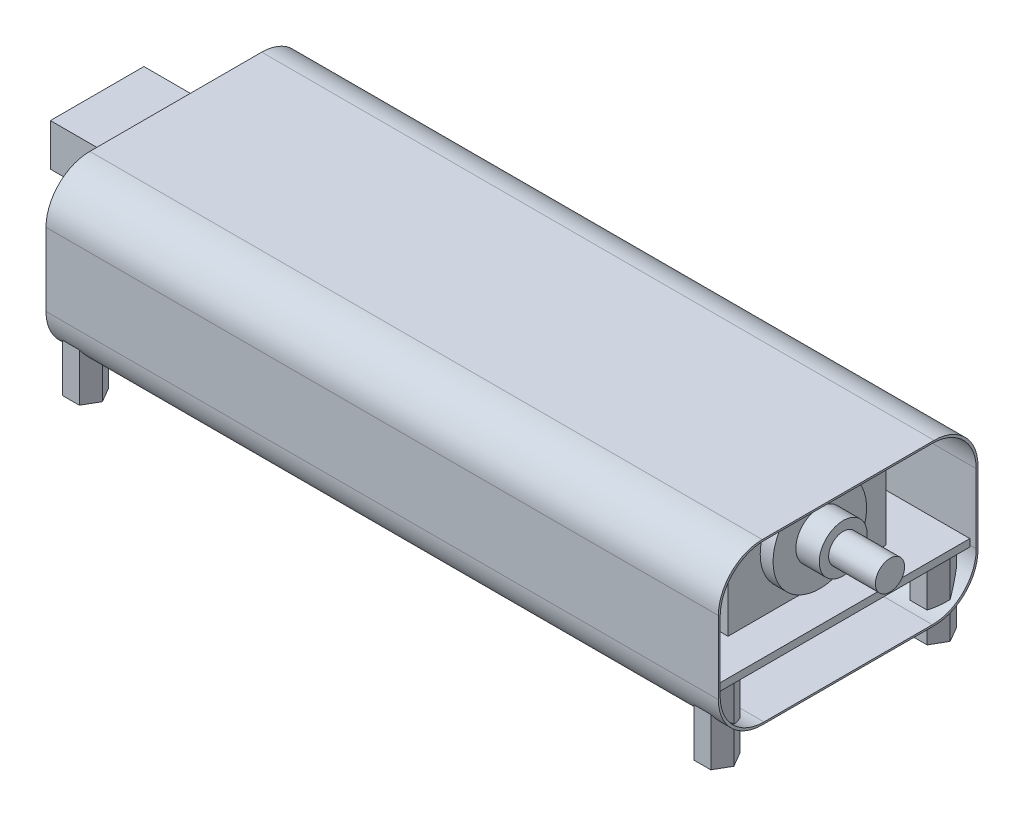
ISO-10303-21;
HEADER;
FILE_DESCRIPTION(('STEP AP214'),'2;1');
FILE_NAME('part.step','',(''),(''),'','','');
FILE_SCHEMA(('AUTOMOTIVE_DESIGN { 1 0 10303 214 1 1 1 1 }'));
ENDSEC;
DATA;
#1=APPLICATION_CONTEXT('core data for automotive mechanical design processes');
#2=APPLICATION_PROTOCOL_DEFINITION('international standard','automotive_design',2000,#1);
#3=PRODUCT_CONTEXT('',#1,'mechanical');
#4=PRODUCT('Part','Part','',(#3));
#5=PRODUCT_RELATED_PRODUCT_CATEGORY('part','',(#4));
#6=PRODUCT_DEFINITION_FORMATION('','',#4);
#7=PRODUCT_DEFINITION_CONTEXT('part definition',#1,'design');
#8=PRODUCT_DEFINITION('design','',#6,#7);
#9=PRODUCT_DEFINITION_SHAPE('','',#8);
#10=(LENGTH_UNIT() NAMED_UNIT(*) SI_UNIT(.MILLI.,.METRE.));
#11=(NAMED_UNIT(*) PLANE_ANGLE_UNIT() SI_UNIT($,.RADIAN.));
#12=(NAMED_UNIT(*) SI_UNIT($,.STERADIAN.) SOLID_ANGLE_UNIT());
#13=UNCERTAINTY_MEASURE_WITH_UNIT(LENGTH_MEASURE(1.E-05),#10,'distance_accuracy_value','');
#14=(GEOMETRIC_REPRESENTATION_CONTEXT(3) GLOBAL_UNCERTAINTY_ASSIGNED_CONTEXT((#13)) GLOBAL_UNIT_ASSIGNED_CONTEXT((#10,
#11,#12)) REPRESENTATION_CONTEXT('',''));
#15=CARTESIAN_POINT('',(0.,0.,0.));
#16=DIRECTION('',(0.,0.,1.));
#17=DIRECTION('',(1.,0.,0.));
#18=AXIS2_PLACEMENT_3D('',#15,#16,#17);
#19=CARTESIAN_POINT('',(0.,14.3002,-54.991));
#20=DIRECTION('',(0.,1.,0.));
#21=DIRECTION('',(0.,0.,1.));
#22=AXIS2_PLACEMENT_3D('',#19,#20,#21);
#23=PLANE('',#22);
#24=DIRECTION('',(-1.,0.,0.));
#25=VECTOR('',#24,1.);
#26=CARTESIAN_POINT('',(0.,14.3002,-5.07999999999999));
#27=LINE('',#26,#25);
#28=CARTESIAN_POINT('',(40.64,14.3002,-5.07999999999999));
#29=VERTEX_POINT('',#28);
#30=CARTESIAN_POINT('',(33.02,14.3002,-5.07999999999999));
#31=VERTEX_POINT('',#30);
#32=EDGE_CURVE('E1434',#29,#31,#27,.T.);
#33=ORIENTED_EDGE('',*,*,#32,.T.);
#34=DIRECTION('',(0.,0.,-1.));
#35=VECTOR('',#34,1.);
#36=CARTESIAN_POINT('',(33.02,14.3002,-54.991));
#37=LINE('',#36,#35);
#38=CARTESIAN_POINT('',(33.02,14.3002,-7.61999999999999));
#39=VERTEX_POINT('',#38);
#40=EDGE_CURVE('E1437',#31,#39,#37,.T.);
#41=ORIENTED_EDGE('',*,*,#40,.T.);
#42=DIRECTION('',(1.,0.,0.));
#43=VECTOR('',#42,1.);
#44=CARTESIAN_POINT('',(0.,14.3002,-7.62));
#45=LINE('',#44,#43);
#46=CARTESIAN_POINT('',(40.64,14.3002,-7.62));
#47=VERTEX_POINT('',#46);
#48=EDGE_CURVE('E1428',#39,#47,#45,.T.);
#49=ORIENTED_EDGE('',*,*,#48,.T.);
#50=DIRECTION('',(0.,0.,1.));
#51=VECTOR('',#50,1.);
#52=CARTESIAN_POINT('',(40.64,14.3002,-54.991));
#53=LINE('',#52,#51);
#54=EDGE_CURVE('E1431',#47,#29,#53,.T.);
#55=ORIENTED_EDGE('',*,*,#54,.T.);
#56=EDGE_LOOP('',(#33,#41,#49,#55));
#57=FACE_BOUND('',#56,.T.);
#58=DIRECTION('',(0.,0.,-1.));
#59=VECTOR('',#58,1.);
#60=CARTESIAN_POINT('',(0.,14.3002,0.));
#61=LINE('',#60,#59);
#62=CARTESIAN_POINT('',(0.,14.3002,-37.6555));
#63=VERTEX_POINT('',#62);
#64=CARTESIAN_POINT('',(0.,14.3002,-54.991));
#65=VERTEX_POINT('',#64);
#66=EDGE_CURVE('E1373',#63,#65,#61,.T.);
#67=ORIENTED_EDGE('',*,*,#66,.F.);
#68=DIRECTION('',(1.,0.,0.));
#69=VECTOR('',#68,1.);
#70=CARTESIAN_POINT('',(0.,14.3002,-37.6555));
#71=LINE('',#70,#69);
#72=CARTESIAN_POINT('',(6.35,14.3002,-37.6555));
#73=VERTEX_POINT('',#72);
#74=EDGE_CURVE('E1406',#63,#73,#71,.T.);
#75=ORIENTED_EDGE('',*,*,#74,.T.);
#76=DIRECTION('',(0.,0.,-1.));
#77=VECTOR('',#76,1.);
#78=CARTESIAN_POINT('',(6.35,14.3002,-54.991));
#79=LINE('',#78,#77);
#80=CARTESIAN_POINT('',(6.35,14.3002,-17.3355));
#81=VERTEX_POINT('',#80);
#82=EDGE_CURVE('E1400',#81,#73,#79,.T.);
#83=ORIENTED_EDGE('',*,*,#82,.F.);
#84=DIRECTION('',(-1.,0.,0.));
#85=VECTOR('',#84,1.);
#86=CARTESIAN_POINT('',(0.,14.3002,-17.3355));
#87=LINE('',#86,#85);
#88=CARTESIAN_POINT('',(0.,14.3002,-17.3355));
#89=VERTEX_POINT('',#88);
#90=EDGE_CURVE('E1403',#81,#89,#87,.T.);
#91=ORIENTED_EDGE('',*,*,#90,.T.);
#92=CARTESIAN_POINT('',(0.,14.3002,0.));
#93=VERTEX_POINT('',#92);
#94=EDGE_CURVE('E1369',#93,#89,#61,.T.);
#95=ORIENTED_EDGE('',*,*,#94,.F.);
#96=DIRECTION('',(1.,0.,0.));
#97=VECTOR('',#96,1.);
#98=CARTESIAN_POINT('',(0.,14.3002,0.));
#99=LINE('',#98,#97);
#100=CARTESIAN_POINT('',(87.884,14.3002,0.));
#101=VERTEX_POINT('',#100);
#102=EDGE_CURVE('E1379',#93,#101,#99,.T.);
#103=ORIENTED_EDGE('',*,*,#102,.T.);
#104=DIRECTION('',(0.,0.,1.));
#105=VECTOR('',#104,1.);
#106=CARTESIAN_POINT('',(87.884,14.3002,-54.991));
#107=LINE('',#106,#105);
#108=CARTESIAN_POINT('',(87.884,14.3002,-54.991));
#109=VERTEX_POINT('',#108);
#110=EDGE_CURVE('E1376',#109,#101,#107,.T.);
#111=ORIENTED_EDGE('',*,*,#110,.F.);
#112=DIRECTION('',(-1.,0.,0.));
#113=VECTOR('',#112,1.);
#114=CARTESIAN_POINT('',(87.884,14.3002,-54.991));
#115=LINE('',#114,#113);
#116=EDGE_CURVE('E1372',#109,#65,#115,.T.);
#117=ORIENTED_EDGE('',*,*,#116,.T.);
#118=EDGE_LOOP('',(#67,#75,#83,#91,#95,#103,#111,#117));
#119=FACE_BOUND('',#118,.T.);
#120=DIRECTION('',(-1.,0.,0.));
#121=VECTOR('',#120,1.);
#122=CARTESIAN_POINT('',(0.,14.3002,-42.291));
#123=LINE('',#122,#121);
#124=CARTESIAN_POINT('',(7.62,14.3002,-42.291));
#125=VERTEX_POINT('',#124);
#126=CARTESIAN_POINT('',(2.54,14.3002,-42.291));
#127=VERTEX_POINT('',#126);
#128=EDGE_CURVE('E55',#125,#127,#123,.T.);
#129=ORIENTED_EDGE('',*,*,#128,.T.);
#130=DIRECTION('',(0.,0.,-1.));
#131=VECTOR('',#130,1.);
#132=CARTESIAN_POINT('',(2.54,14.3002,-54.991));
#133=LINE('',#132,#131);
#134=CARTESIAN_POINT('',(2.54,14.3002,-52.451));
#135=VERTEX_POINT('',#134);
#136=EDGE_CURVE('E11',#127,#135,#133,.T.);
#137=ORIENTED_EDGE('',*,*,#136,.T.);
#138=DIRECTION('',(1.,0.,0.));
#139=VECTOR('',#138,1.);
#140=CARTESIAN_POINT('',(0.,14.3002,-52.451));
#141=LINE('',#140,#139);
#142=CARTESIAN_POINT('',(7.62,14.3002,-52.451));
#143=VERTEX_POINT('',#142);
#144=EDGE_CURVE('E1440',#135,#143,#141,.T.);
#145=ORIENTED_EDGE('',*,*,#144,.T.);
#146=DIRECTION('',(0.,0.,1.));
#147=VECTOR('',#146,1.);
#148=CARTESIAN_POINT('',(7.62,14.3002,-54.991));
#149=LINE('',#148,#147);
#150=EDGE_CURVE('E1443',#143,#125,#149,.T.);
#151=ORIENTED_EDGE('',*,*,#150,.T.);
#152=EDGE_LOOP('',(#129,#137,#145,#151));
#153=FACE_BOUND('',#152,.T.);
#154=ADVANCED_FACE('F47',(#57,#119,#153),#23,.T.);
#155=CARTESIAN_POINT('',(0.,0.,0.));
#156=DIRECTION('',(0.,-1.,0.));
#157=DIRECTION('',(0.,0.,-1.));
#158=AXIS2_PLACEMENT_3D('',#155,#156,#157);
#159=PLANE('',#158);
#160=DIRECTION('',(1.,0.,0.));
#161=VECTOR('',#160,1.);
#162=CARTESIAN_POINT('',(57.7365751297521,0.,-20.7534232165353));
#163=LINE('',#162,#161);
#164=CARTESIAN_POINT('',(57.7365751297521,0.,-20.7534232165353));
#165=VERTEX_POINT('',#164);
#166=CARTESIAN_POINT('',(77.7894013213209,0.,-20.7534232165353));
#167=VERTEX_POINT('',#166);
#168=EDGE_CURVE('E1321',#165,#167,#163,.T.);
#169=ORIENTED_EDGE('',*,*,#168,.F.);
#170=DIRECTION('',(0.,0.,-1.));
#171=VECTOR('',#170,1.);
#172=CARTESIAN_POINT('',(57.7365751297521,0.,-8.05342321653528));
#173=LINE('',#172,#171);
#174=CARTESIAN_POINT('',(57.7365751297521,0.,-8.05342321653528));
#175=VERTEX_POINT('',#174);
#176=EDGE_CURVE('E1312',#175,#165,#173,.T.);
#177=ORIENTED_EDGE('',*,*,#176,.F.);
#178=DIRECTION('',(-1.,0.,0.));
#179=VECTOR('',#178,1.);
#180=CARTESIAN_POINT('',(57.7365751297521,0.,-8.05342321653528));
#181=LINE('',#180,#179);
#182=CARTESIAN_POINT('',(77.7894013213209,0.,-8.05342321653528));
#183=VERTEX_POINT('',#182);
#184=EDGE_CURVE('E1316',#183,#175,#181,.T.);
#185=ORIENTED_EDGE('',*,*,#184,.F.);
#186=DIRECTION('',(0.,0.,1.));
#187=VECTOR('',#186,1.);
#188=CARTESIAN_POINT('',(77.7894013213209,0.,-8.05342321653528));
#189=LINE('',#188,#187);
#190=EDGE_CURVE('E1323',#167,#183,#189,.T.);
#191=ORIENTED_EDGE('',*,*,#190,.F.);
#192=EDGE_LOOP('',(#169,#177,#185,#191));
#193=FACE_BOUND('',#192,.T.);
#194=DIRECTION('',(0.,0.,-1.));
#195=VECTOR('',#194,1.);
#196=CARTESIAN_POINT('',(0.,0.,0.));
#197=LINE('',#196,#195);
#198=CARTESIAN_POINT('',(0.,0.,0.));
#199=VERTEX_POINT('',#198);
#200=CARTESIAN_POINT('',(0.,0.,-54.991));
#201=VERTEX_POINT('',#200);
#202=EDGE_CURVE('E1394',#199,#201,#197,.T.);
#203=ORIENTED_EDGE('',*,*,#202,.T.);
#204=DIRECTION('',(-1.,0.,0.));
#205=VECTOR('',#204,1.);
#206=CARTESIAN_POINT('',(145.034,0.,-54.991));
#207=LINE('',#206,#205);
#208=CARTESIAN_POINT('',(145.034,0.,-54.991));
#209=VERTEX_POINT('',#208);
#210=EDGE_CURVE('E1506',#209,#201,#207,.T.);
#211=ORIENTED_EDGE('',*,*,#210,.F.);
#212=DIRECTION('',(0.,0.,1.));
#213=VECTOR('',#212,1.);
#214=CARTESIAN_POINT('',(145.034,0.,-54.991));
#215=LINE('',#214,#213);
#216=CARTESIAN_POINT('',(145.034,0.,0.));
#217=VERTEX_POINT('',#216);
#218=EDGE_CURVE('E1515',#209,#217,#215,.T.);
#219=ORIENTED_EDGE('',*,*,#218,.T.);
#220=DIRECTION('',(1.,0.,0.));
#221=VECTOR('',#220,1.);
#222=CARTESIAN_POINT('',(0.,0.,0.));
#223=LINE('',#222,#221);
#224=EDGE_CURVE('E1521',#199,#217,#223,.T.);
#225=ORIENTED_EDGE('',*,*,#224,.F.);
#226=EDGE_LOOP('',(#203,#211,#219,#225));
#227=FACE_BOUND('',#226,.T.);
#228=DIRECTION('',(1.,0.,0.));
#229=VECTOR('',#228,1.);
#230=CARTESIAN_POINT('',(57.7365751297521,0.,-44.8083622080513));
#231=LINE('',#230,#229);
#232=CARTESIAN_POINT('',(57.7365751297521,0.,-44.8083622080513));
#233=VERTEX_POINT('',#232);
#234=CARTESIAN_POINT('',(77.7894013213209,0.,-44.8083622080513));
#235=VERTEX_POINT('',#234);
#236=EDGE_CURVE('E1297',#233,#235,#231,.T.);
#237=ORIENTED_EDGE('',*,*,#236,.F.);
#238=DIRECTION('',(0.,0.,-1.));
#239=VECTOR('',#238,1.);
#240=CARTESIAN_POINT('',(57.7365751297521,0.,-32.1083622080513));
#241=LINE('',#240,#239);
#242=CARTESIAN_POINT('',(57.7365751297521,0.,-32.1083622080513));
#243=VERTEX_POINT('',#242);
#244=EDGE_CURVE('E1280',#243,#233,#241,.T.);
#245=ORIENTED_EDGE('',*,*,#244,.F.);
#246=DIRECTION('',(-1.,0.,0.));
#247=VECTOR('',#246,1.);
#248=CARTESIAN_POINT('',(57.7365751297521,0.,-32.1083622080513));
#249=LINE('',#248,#247);
#250=CARTESIAN_POINT('',(77.7894013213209,0.,-32.1083622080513));
#251=VERTEX_POINT('',#250);
#252=EDGE_CURVE('E1285',#251,#243,#249,.T.);
#253=ORIENTED_EDGE('',*,*,#252,.F.);
#254=DIRECTION('',(0.,0.,1.));
#255=VECTOR('',#254,1.);
#256=CARTESIAN_POINT('',(77.7894013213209,0.,-32.1083622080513));
#257=LINE('',#256,#255);
#258=EDGE_CURVE('E1299',#235,#251,#257,.T.);
#259=ORIENTED_EDGE('',*,*,#258,.F.);
#260=EDGE_LOOP('',(#237,#245,#253,#259));
#261=FACE_BOUND('',#260,.T.);
#262=DIRECTION('',(1.,0.,0.));
#263=VECTOR('',#262,1.);
#264=CARTESIAN_POINT('',(139.263912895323,0.,-7.17549999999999));
#265=LINE('',#264,#263);
#266=CARTESIAN_POINT('',(139.263912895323,0.,-7.17549999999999));
#267=VERTEX_POINT('',#266);
#268=CARTESIAN_POINT('',(142.930087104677,0.,-7.17549999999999));
#269=VERTEX_POINT('',#268);
#270=EDGE_CURVE('E1180',#267,#269,#265,.T.);
#271=ORIENTED_EDGE('',*,*,#270,.F.);
#272=DIRECTION('',(0.500000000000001,0.,-0.866025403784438));
#273=VECTOR('',#272,1.);
#274=CARTESIAN_POINT('',(137.430825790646,0.,-4.0005));
#275=LINE('',#274,#273);
#276=CARTESIAN_POINT('',(137.430825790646,0.,-4.0005));
#277=VERTEX_POINT('',#276);
#278=EDGE_CURVE('E1162',#277,#267,#275,.T.);
#279=ORIENTED_EDGE('',*,*,#278,.F.);
#280=DIRECTION('',(-0.499999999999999,0.,-0.866025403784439));
#281=VECTOR('',#280,1.);
#282=CARTESIAN_POINT('',(139.263912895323,0.,-0.825500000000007));
#283=LINE('',#282,#281);
#284=CARTESIAN_POINT('',(139.263912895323,0.,-0.8255));
#285=VERTEX_POINT('',#284);
#286=EDGE_CURVE('E1167',#285,#277,#283,.T.);
#287=ORIENTED_EDGE('',*,*,#286,.F.);
#288=DIRECTION('',(-1.,0.,0.));
#289=VECTOR('',#288,1.);
#290=CARTESIAN_POINT('',(142.930087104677,0.,-0.825500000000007));
#291=LINE('',#290,#289);
#292=CARTESIAN_POINT('',(142.930087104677,0.,-0.825500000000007));
#293=VERTEX_POINT('',#292);
#294=EDGE_CURVE('E1189',#293,#285,#291,.T.);
#295=ORIENTED_EDGE('',*,*,#294,.F.);
#296=DIRECTION('',(-0.500000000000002,0.,0.866025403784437));
#297=VECTOR('',#296,1.);
#298=CARTESIAN_POINT('',(144.763174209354,0.,-4.00049999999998));
#299=LINE('',#298,#297);
#300=CARTESIAN_POINT('',(144.763174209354,0.,-4.00049999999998));
#301=VERTEX_POINT('',#300);
#302=EDGE_CURVE('E1186',#301,#293,#299,.T.);
#303=ORIENTED_EDGE('',*,*,#302,.F.);
#304=DIRECTION('',(0.500000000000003,0.,0.866025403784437));
#305=VECTOR('',#304,1.);
#306=CARTESIAN_POINT('',(142.930087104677,0.,-7.17549999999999));
#307=LINE('',#306,#305);
#308=EDGE_CURVE('E1183',#269,#301,#307,.T.);
#309=ORIENTED_EDGE('',*,*,#308,.F.);
#310=EDGE_LOOP('',(#271,#279,#287,#295,#303,#309));
#311=FACE_BOUND('',#310,.T.);
#312=DIRECTION('',(0.499999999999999,0.,-0.866025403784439));
#313=VECTOR('',#312,1.);
#314=CARTESIAN_POINT('',(137.430825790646,0.,-50.9905));
#315=LINE('',#314,#313);
#316=CARTESIAN_POINT('',(137.430825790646,0.,-50.9905));
#317=VERTEX_POINT('',#316);
#318=CARTESIAN_POINT('',(139.263912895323,0.,-54.1655));
#319=VERTEX_POINT('',#318);
#320=EDGE_CURVE('E1123',#317,#319,#315,.T.);
#321=ORIENTED_EDGE('',*,*,#320,.F.);
#322=DIRECTION('',(-0.499999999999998,0.,-0.86602540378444));
#323=VECTOR('',#322,1.);
#324=CARTESIAN_POINT('',(139.263912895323,0.,-47.8155));
#325=LINE('',#324,#323);
#326=CARTESIAN_POINT('',(139.263912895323,0.,-47.8155));
#327=VERTEX_POINT('',#326);
#328=EDGE_CURVE('E1105',#327,#317,#325,.T.);
#329=ORIENTED_EDGE('',*,*,#328,.F.);
#330=DIRECTION('',(-1.,0.,0.));
#331=VECTOR('',#330,1.);
#332=CARTESIAN_POINT('',(142.930087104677,0.,-47.8155));
#333=LINE('',#332,#331);
#334=CARTESIAN_POINT('',(142.930087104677,0.,-47.8155));
#335=VERTEX_POINT('',#334);
#336=EDGE_CURVE('E1110',#335,#327,#333,.T.);
#337=ORIENTED_EDGE('',*,*,#336,.F.);
#338=DIRECTION('',(-0.499999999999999,0.,0.866025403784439));
#339=VECTOR('',#338,1.);
#340=CARTESIAN_POINT('',(144.763174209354,0.,-50.9905));
#341=LINE('',#340,#339);
#342=CARTESIAN_POINT('',(144.763174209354,0.,-50.9905));
#343=VERTEX_POINT('',#342);
#344=EDGE_CURVE('E1132',#343,#335,#341,.T.);
#345=ORIENTED_EDGE('',*,*,#344,.F.);
#346=DIRECTION('',(0.499999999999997,0.,0.86602540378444));
#347=VECTOR('',#346,1.);
#348=CARTESIAN_POINT('',(142.930087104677,0.,-54.1655));
#349=LINE('',#348,#347);
#350=CARTESIAN_POINT('',(142.930087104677,0.,-54.1655));
#351=VERTEX_POINT('',#350);
#352=EDGE_CURVE('E1129',#351,#343,#349,.T.);
#353=ORIENTED_EDGE('',*,*,#352,.F.);
#354=DIRECTION('',(1.,0.,0.));
#355=VECTOR('',#354,1.);
#356=CARTESIAN_POINT('',(139.263912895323,0.,-54.1655));
#357=LINE('',#356,#355);
#358=EDGE_CURVE('E1126',#319,#351,#357,.T.);
#359=ORIENTED_EDGE('',*,*,#358,.F.);
#360=EDGE_LOOP('',(#321,#329,#337,#345,#353,#359));
#361=FACE_BOUND('',#360,.T.);
#362=DIRECTION('',(1.,0.,0.));
#363=VECTOR('',#362,1.);
#364=CARTESIAN_POINT('',(2.10391289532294,0.,-7.1755));
#365=LINE('',#364,#363);
#366=CARTESIAN_POINT('',(2.10391289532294,0.,-7.1755));
#367=VERTEX_POINT('',#366);
#368=CARTESIAN_POINT('',(5.77008710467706,0.,-7.1755));
#369=VERTEX_POINT('',#368);
#370=EDGE_CURVE('E1066',#367,#369,#365,.T.);
#371=ORIENTED_EDGE('',*,*,#370,.F.);
#372=DIRECTION('',(0.5,0.,-0.866025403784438));
#373=VECTOR('',#372,1.);
#374=CARTESIAN_POINT('',(0.270825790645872,0.,-4.0005));
#375=LINE('',#374,#373);
#376=CARTESIAN_POINT('',(0.270825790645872,0.,-4.0005));
#377=VERTEX_POINT('',#376);
#378=EDGE_CURVE('E1048',#377,#367,#375,.T.);
#379=ORIENTED_EDGE('',*,*,#378,.F.);
#380=DIRECTION('',(-0.5,0.,-0.866025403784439));
#381=VECTOR('',#380,1.);
#382=CARTESIAN_POINT('',(2.10391289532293,0.,-0.825500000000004));
#383=LINE('',#382,#381);
#384=CARTESIAN_POINT('',(2.10391289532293,0.,-0.825500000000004));
#385=VERTEX_POINT('',#384);
#386=EDGE_CURVE('E1053',#385,#377,#383,.T.);
#387=ORIENTED_EDGE('',*,*,#386,.F.);
#388=DIRECTION('',(-1.,0.,0.));
#389=VECTOR('',#388,1.);
#390=CARTESIAN_POINT('',(5.77008710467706,0.,-0.825500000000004));
#391=LINE('',#390,#389);
#392=CARTESIAN_POINT('',(5.77008710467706,0.,-0.825500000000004));
#393=VERTEX_POINT('',#392);
#394=EDGE_CURVE('E1075',#393,#385,#391,.T.);
#395=ORIENTED_EDGE('',*,*,#394,.F.);
#396=DIRECTION('',(-0.500000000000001,0.,0.866025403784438));
#397=VECTOR('',#396,1.);
#398=CARTESIAN_POINT('',(7.60317420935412,0.,-4.0005));
#399=LINE('',#398,#397);
#400=CARTESIAN_POINT('',(7.60317420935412,0.,-4.0005));
#401=VERTEX_POINT('',#400);
#402=EDGE_CURVE('E1072',#401,#393,#399,.T.);
#403=ORIENTED_EDGE('',*,*,#402,.F.);
#404=DIRECTION('',(0.5,0.,0.866025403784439));
#405=VECTOR('',#404,1.);
#406=CARTESIAN_POINT('',(5.77008710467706,0.,-7.1755));
#407=LINE('',#406,#405);
#408=EDGE_CURVE('E1069',#369,#401,#407,.T.);
#409=ORIENTED_EDGE('',*,*,#408,.F.);
#410=EDGE_LOOP('',(#371,#379,#387,#395,#403,#409));
#411=FACE_BOUND('',#410,.T.);
#412=DIRECTION('',(0.5,0.,-0.866025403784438));
#413=VECTOR('',#412,1.);
#414=CARTESIAN_POINT('',(0.270825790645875,0.,-50.9905));
#415=LINE('',#414,#413);
#416=CARTESIAN_POINT('',(0.270825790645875,0.,-50.9905));
#417=VERTEX_POINT('',#416);
#418=CARTESIAN_POINT('',(2.10391289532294,0.,-54.1655));
#419=VERTEX_POINT('',#418);
#420=EDGE_CURVE('E1009',#417,#419,#415,.T.);
#421=ORIENTED_EDGE('',*,*,#420,.F.);
#422=DIRECTION('',(-0.499999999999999,0.,-0.866025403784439));
#423=VECTOR('',#422,1.);
#424=CARTESIAN_POINT('',(2.10391289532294,0.,-47.8155));
#425=LINE('',#424,#423);
#426=CARTESIAN_POINT('',(2.10391289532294,0.,-47.8155));
#427=VERTEX_POINT('',#426);
#428=EDGE_CURVE('E991',#427,#417,#425,.T.);
#429=ORIENTED_EDGE('',*,*,#428,.F.);
#430=DIRECTION('',(-1.,0.,0.));
#431=VECTOR('',#430,1.);
#432=CARTESIAN_POINT('',(5.77008710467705,0.,-47.8155));
#433=LINE('',#432,#431);
#434=CARTESIAN_POINT('',(5.77008710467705,0.,-47.8155));
#435=VERTEX_POINT('',#434);
#436=EDGE_CURVE('E996',#435,#427,#433,.T.);
#437=ORIENTED_EDGE('',*,*,#436,.F.);
#438=DIRECTION('',(-0.500000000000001,0.,0.866025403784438));
#439=VECTOR('',#438,1.);
#440=CARTESIAN_POINT('',(7.60317420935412,0.,-50.9905));
#441=LINE('',#440,#439);
#442=CARTESIAN_POINT('',(7.60317420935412,0.,-50.9905));
#443=VERTEX_POINT('',#442);
#444=EDGE_CURVE('E1018',#443,#435,#441,.T.);
#445=ORIENTED_EDGE('',*,*,#444,.F.);
#446=DIRECTION('',(0.499999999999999,0.,0.866025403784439));
#447=VECTOR('',#446,1.);
#448=CARTESIAN_POINT('',(5.77008710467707,0.,-54.1655));
#449=LINE('',#448,#447);
#450=CARTESIAN_POINT('',(5.77008710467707,0.,-54.1655));
#451=VERTEX_POINT('',#450);
#452=EDGE_CURVE('E1015',#451,#443,#449,.T.);
#453=ORIENTED_EDGE('',*,*,#452,.F.);
#454=DIRECTION('',(1.,0.,0.));
#455=VECTOR('',#454,1.);
#456=CARTESIAN_POINT('',(2.10391289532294,0.,-54.1655));
#457=LINE('',#456,#455);
#458=EDGE_CURVE('E1012',#419,#451,#457,.T.);
#459=ORIENTED_EDGE('',*,*,#458,.F.);
#460=EDGE_LOOP('',(#421,#429,#437,#445,#453,#459));
#461=FACE_BOUND('',#460,.T.);
#462=ADVANCED_FACE('F1463',(#193,#227,#261,#311,#361,#411,#461),#159,.T.);
#463=CARTESIAN_POINT('',(137.16,24.2062,-10.3505000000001));
#464=DIRECTION('',(-1.,0.,0.));
#465=DIRECTION('',(0.,0.,1.));
#466=AXIS2_PLACEMENT_3D('',#463,#464,#465);
#467=PLANE('',#466);
#468=DIRECTION('',(0.,0.,-1.));
#469=VECTOR('',#468,1.);
#470=CARTESIAN_POINT('',(137.16,1.6002,-10.3505000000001));
#471=LINE('',#470,#469);
#472=CARTESIAN_POINT('',(137.16,1.6002,-10.3505000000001));
#473=VERTEX_POINT('',#472);
#474=CARTESIAN_POINT('',(137.16,1.6002,-44.6405));
#475=VERTEX_POINT('',#474);
#476=EDGE_CURVE('E1264',#473,#475,#471,.T.);
#477=ORIENTED_EDGE('',*,*,#476,.T.);
#478=DIRECTION('',(0.,-1.,0.));
#479=VECTOR('',#478,1.);
#480=CARTESIAN_POINT('',(137.16,24.2062,-44.6405));
#481=LINE('',#480,#479);
#482=CARTESIAN_POINT('',(137.16,24.2062,-44.6405));
#483=VERTEX_POINT('',#482);
#484=EDGE_CURVE('E1271',#483,#475,#481,.T.);
#485=ORIENTED_EDGE('',*,*,#484,.F.);
#486=DIRECTION('',(0.,0.,-1.));
#487=VECTOR('',#486,1.);
#488=CARTESIAN_POINT('',(137.16,24.2062,-10.3505000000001));
#489=LINE('',#488,#487);
#490=CARTESIAN_POINT('',(137.16,24.2062,-10.3505000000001));
#491=VERTEX_POINT('',#490);
#492=EDGE_CURVE('E1255',#491,#483,#489,.T.);
#493=ORIENTED_EDGE('',*,*,#492,.F.);
#494=DIRECTION('',(0.,-1.,0.));
#495=VECTOR('',#494,1.);
#496=CARTESIAN_POINT('',(137.16,24.2062,-10.3505000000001));
#497=LINE('',#496,#495);
#498=EDGE_CURVE('E1274',#491,#473,#497,.T.);
#499=ORIENTED_EDGE('',*,*,#498,.T.);
#500=EDGE_LOOP('',(#477,#485,#493,#499));
#501=FACE_BOUND('',#500,.T.);
#502=CARTESIAN_POINT('',(137.16,13.5382,-27.4955000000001));
#503=DIRECTION('',(-1.,0.,0.));
#504=DIRECTION('',(0.,0.,1.));
#505=AXIS2_PLACEMENT_3D('',#502,#503,#504);
#506=CIRCLE('',#505,10.16);
#507=CARTESIAN_POINT('',(137.16,13.5382,-17.3355000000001));
#508=VERTEX_POINT('',#507);
#509=EDGE_CURVE('E1410',#508,#508,#506,.F.);
#510=ORIENTED_EDGE('',*,*,#509,.F.);
#511=EDGE_LOOP('',(#510));
#512=FACE_BOUND('',#511,.T.);
#513=ADVANCED_FACE('F1469',(#501,#512),#467,.F.);
#514=CARTESIAN_POINT('',(0.,1.6002,0.));
#515=DIRECTION('',(0.,-1.,0.));
#516=DIRECTION('',(0.,0.,-1.));
#517=AXIS2_PLACEMENT_3D('',#514,#515,#516);
#518=PLANE('',#517);
#519=DIRECTION('',(-1.,0.,0.));
#520=VECTOR('',#519,1.);
#521=CARTESIAN_POINT('',(145.034,1.6002,-54.991));
#522=LINE('',#521,#520);
#523=CARTESIAN_POINT('',(145.034,1.6002,-54.991));
#524=VERTEX_POINT('',#523);
#525=CARTESIAN_POINT('',(87.884,1.6002,-54.991));
#526=VERTEX_POINT('',#525);
#527=EDGE_CURVE('E1390',#524,#526,#522,.T.);
#528=ORIENTED_EDGE('',*,*,#527,.T.);
#529=DIRECTION('',(0.,0.,1.));
#530=VECTOR('',#529,1.);
#531=CARTESIAN_POINT('',(87.884,1.6002,-54.991));
#532=LINE('',#531,#530);
#533=CARTESIAN_POINT('',(87.884,1.6002,0.));
#534=VERTEX_POINT('',#533);
#535=EDGE_CURVE('E1368',#526,#534,#532,.T.);
#536=ORIENTED_EDGE('',*,*,#535,.T.);
#537=DIRECTION('',(1.,0.,0.));
#538=VECTOR('',#537,1.);
#539=CARTESIAN_POINT('',(0.,1.6002,0.));
#540=LINE('',#539,#538);
#541=CARTESIAN_POINT('',(145.034,1.6002,0.));
#542=VERTEX_POINT('',#541);
#543=EDGE_CURVE('E1533',#534,#542,#540,.T.);
#544=ORIENTED_EDGE('',*,*,#543,.T.);
#545=DIRECTION('',(0.,0.,1.));
#546=VECTOR('',#545,1.);
#547=CARTESIAN_POINT('',(145.034,1.6002,-54.991));
#548=LINE('',#547,#546);
#549=EDGE_CURVE('E1534',#524,#542,#548,.T.);
#550=ORIENTED_EDGE('',*,*,#549,.F.);
#551=EDGE_LOOP('',(#528,#536,#544,#550));
#552=FACE_BOUND('',#551,.T.);
#553=DIRECTION('',(0.,0.,1.));
#554=VECTOR('',#553,1.);
#555=CARTESIAN_POINT('',(124.714,1.6002,-44.6405));
#556=LINE('',#555,#554);
#557=CARTESIAN_POINT('',(124.714,1.6002,-44.6405));
#558=VERTEX_POINT('',#557);
#559=CARTESIAN_POINT('',(124.714,1.6002,-10.3505));
#560=VERTEX_POINT('',#559);
#561=EDGE_CURVE('E1248',#558,#560,#556,.T.);
#562=ORIENTED_EDGE('',*,*,#561,.F.);
#563=DIRECTION('',(-1.,0.,0.));
#564=VECTOR('',#563,1.);
#565=CARTESIAN_POINT('',(137.16,1.6002,-44.6405));
#566=LINE('',#565,#564);
#567=EDGE_CURVE('E1252',#475,#558,#566,.T.);
#568=ORIENTED_EDGE('',*,*,#567,.F.);
#569=ORIENTED_EDGE('',*,*,#476,.F.);
#570=DIRECTION('',(-1.,0.,0.));
#571=VECTOR('',#570,1.);
#572=CARTESIAN_POINT('',(137.16,1.6002,-10.3505000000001));
#573=LINE('',#572,#571);
#574=EDGE_CURVE('E1262',#473,#560,#573,.T.);
#575=ORIENTED_EDGE('',*,*,#574,.T.);
#576=EDGE_LOOP('',(#562,#568,#569,#575));
#577=FACE_BOUND('',#576,.T.);
#578=ADVANCED_FACE('F1483',(#552,#577),#518,.F.);
#579=CARTESIAN_POINT('',(0.,1.6002,0.));
#580=DIRECTION('',(-1.,0.,0.));
#581=DIRECTION('',(0.,0.,1.));
#582=AXIS2_PLACEMENT_3D('',#579,#580,#581);
#583=PLANE('',#582);
#584=DIRECTION('',(0.,0.,-1.));
#585=VECTOR('',#584,1.);
#586=CARTESIAN_POINT('',(0.,8.89,0.));
#587=LINE('',#586,#585);
#588=CARTESIAN_POINT('',(0.,8.89,-17.3355));
#589=VERTEX_POINT('',#588);
#590=CARTESIAN_POINT('',(0.,8.88999999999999,-37.6555));
#591=VERTEX_POINT('',#590);
#592=EDGE_CURVE('E1408',#589,#591,#587,.T.);
#593=ORIENTED_EDGE('',*,*,#592,.T.);
#594=DIRECTION('',(0.,1.,0.));
#595=VECTOR('',#594,1.);
#596=CARTESIAN_POINT('',(0.,1.6002,-37.6555));
#597=LINE('',#596,#595);
#598=EDGE_CURVE('E1366',#591,#63,#597,.T.);
#599=ORIENTED_EDGE('',*,*,#598,.T.);
#600=ORIENTED_EDGE('',*,*,#66,.T.);
#601=DIRECTION('',(0.,-1.,0.));
#602=VECTOR('',#601,1.);
#603=CARTESIAN_POINT('',(0.,1.6002,-54.991));
#604=LINE('',#603,#602);
#605=EDGE_CURVE('E1509',#65,#201,#604,.T.);
#606=ORIENTED_EDGE('',*,*,#605,.T.);
#607=ORIENTED_EDGE('',*,*,#202,.F.);
#608=DIRECTION('',(0.,-1.,0.));
#609=VECTOR('',#608,1.);
#610=CARTESIAN_POINT('',(0.,1.6002,0.));
#611=LINE('',#610,#609);
#612=EDGE_CURVE('E1404',#93,#199,#611,.T.);
#613=ORIENTED_EDGE('',*,*,#612,.F.);
#614=ORIENTED_EDGE('',*,*,#94,.T.);
#615=DIRECTION('',(0.,-1.,0.));
#616=VECTOR('',#615,1.);
#617=CARTESIAN_POINT('',(0.,1.6002,-17.3355));
#618=LINE('',#617,#616);
#619=EDGE_CURVE('E1364',#89,#589,#618,.T.);
#620=ORIENTED_EDGE('',*,*,#619,.T.);
#621=EDGE_LOOP('',(#593,#599,#600,#606,#607,#613,#614,#620));
#622=FACE_BOUND('',#621,.T.);
#623=ADVANCED_FACE('F49',(#622),#583,.T.);
#624=CARTESIAN_POINT('',(0.,1.6002,0.));
#625=DIRECTION('',(0.,0.,-1.));
#626=DIRECTION('',(-1.,0.,0.));
#627=AXIS2_PLACEMENT_3D('',#624,#625,#626);
#628=PLANE('',#627);
#629=ORIENTED_EDGE('',*,*,#224,.T.);
#630=DIRECTION('',(0.,-1.,0.));
#631=VECTOR('',#630,1.);
#632=CARTESIAN_POINT('',(145.034,1.6002,0.));
#633=LINE('',#632,#631);
#634=EDGE_CURVE('E1530',#542,#217,#633,.T.);
#635=ORIENTED_EDGE('',*,*,#634,.F.);
#636=ORIENTED_EDGE('',*,*,#543,.F.);
#637=DIRECTION('',(0.,-1.,0.));
#638=VECTOR('',#637,1.);
#639=CARTESIAN_POINT('',(87.884,14.3002,0.));
#640=LINE('',#639,#638);
#641=EDGE_CURVE('E1392',#101,#534,#640,.T.);
#642=ORIENTED_EDGE('',*,*,#641,.F.);
#643=ORIENTED_EDGE('',*,*,#102,.F.);
#644=ORIENTED_EDGE('',*,*,#612,.T.);
#645=EDGE_LOOP('',(#629,#635,#636,#642,#643,#644));
#646=FACE_BOUND('',#645,.T.);
#647=ADVANCED_FACE('F1492',(#646),#628,.F.);
#648=CARTESIAN_POINT('',(145.034,1.6002,-54.991));
#649=DIRECTION('',(1.,0.,0.));
#650=DIRECTION('',(0.,0.,-1.));
#651=AXIS2_PLACEMENT_3D('',#648,#649,#650);
#652=PLANE('',#651);
#653=ORIENTED_EDGE('',*,*,#218,.F.);
#654=DIRECTION('',(0.,-1.,0.));
#655=VECTOR('',#654,1.);
#656=CARTESIAN_POINT('',(145.034,1.6002,-54.991));
#657=LINE('',#656,#655);
#658=EDGE_CURVE('E1511',#524,#209,#657,.T.);
#659=ORIENTED_EDGE('',*,*,#658,.F.);
#660=ORIENTED_EDGE('',*,*,#549,.T.);
#661=ORIENTED_EDGE('',*,*,#634,.T.);
#662=EDGE_LOOP('',(#653,#659,#660,#661));
#663=FACE_BOUND('',#662,.T.);
#664=ADVANCED_FACE('F1495',(#663),#652,.T.);
#665=CARTESIAN_POINT('',(145.034,1.6002,-54.991));
#666=DIRECTION('',(0.,0.,1.));
#667=DIRECTION('',(1.,0.,0.));
#668=AXIS2_PLACEMENT_3D('',#665,#666,#667);
#669=PLANE('',#668);
#670=ORIENTED_EDGE('',*,*,#210,.T.);
#671=ORIENTED_EDGE('',*,*,#605,.F.);
#672=ORIENTED_EDGE('',*,*,#116,.F.);
#673=DIRECTION('',(0.,-1.,0.));
#674=VECTOR('',#673,1.);
#675=CARTESIAN_POINT('',(87.884,14.3002,-54.991));
#676=LINE('',#675,#674);
#677=EDGE_CURVE('E1381',#109,#526,#676,.T.);
#678=ORIENTED_EDGE('',*,*,#677,.T.);
#679=ORIENTED_EDGE('',*,*,#527,.F.);
#680=ORIENTED_EDGE('',*,*,#658,.T.);
#681=EDGE_LOOP('',(#670,#671,#672,#678,#679,#680));
#682=FACE_BOUND('',#681,.T.);
#683=ADVANCED_FACE('F1481',(#682),#669,.F.);
#684=CARTESIAN_POINT('',(87.884,14.3002,-54.991));
#685=DIRECTION('',(1.,0.,0.));
#686=DIRECTION('',(0.,0.,-1.));
#687=AXIS2_PLACEMENT_3D('',#684,#685,#686);
#688=PLANE('',#687);
#689=ORIENTED_EDGE('',*,*,#535,.F.);
#690=ORIENTED_EDGE('',*,*,#677,.F.);
#691=ORIENTED_EDGE('',*,*,#110,.T.);
#692=ORIENTED_EDGE('',*,*,#641,.T.);
#693=EDGE_LOOP('',(#689,#690,#691,#692));
#694=FACE_BOUND('',#693,.T.);
#695=ADVANCED_FACE('F1478',(#694),#688,.T.);
#696=CARTESIAN_POINT('',(-17.018,8.88999999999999,-37.6555));
#697=DIRECTION('',(0.,0.,1.));
#698=DIRECTION('',(1.,0.,0.));
#699=AXIS2_PLACEMENT_3D('',#696,#697,#698);
#700=PLANE('',#699);
#701=ORIENTED_EDGE('',*,*,#598,.F.);
#702=DIRECTION('',(1.,0.,0.));
#703=VECTOR('',#702,1.);
#704=CARTESIAN_POINT('',(-17.018,8.88999999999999,-37.6555));
#705=LINE('',#704,#703);
#706=CARTESIAN_POINT('',(-17.018,8.88999999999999,-37.6555));
#707=VERTEX_POINT('',#706);
#708=EDGE_CURVE('E1361',#707,#591,#705,.T.);
#709=ORIENTED_EDGE('',*,*,#708,.F.);
#710=DIRECTION('',(0.,-1.,0.));
#711=VECTOR('',#710,1.);
#712=CARTESIAN_POINT('',(-17.018,8.88999999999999,-37.6555));
#713=LINE('',#712,#711);
#714=CARTESIAN_POINT('',(-17.018,18.034,-37.6555));
#715=VERTEX_POINT('',#714);
#716=EDGE_CURVE('E1344',#715,#707,#713,.T.);
#717=ORIENTED_EDGE('',*,*,#716,.F.);
#718=DIRECTION('',(1.,0.,0.));
#719=VECTOR('',#718,1.);
#720=CARTESIAN_POINT('',(-17.018,18.034,-37.6555));
#721=LINE('',#720,#719);
#722=CARTESIAN_POINT('',(6.35,18.034,-37.6555));
#723=VERTEX_POINT('',#722);
#724=EDGE_CURVE('E1353',#715,#723,#721,.T.);
#725=ORIENTED_EDGE('',*,*,#724,.T.);
#726=DIRECTION('',(0.,-1.,0.));
#727=VECTOR('',#726,1.);
#728=CARTESIAN_POINT('',(6.35,8.88999999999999,-37.6555));
#729=LINE('',#728,#727);
#730=EDGE_CURVE('E1336',#723,#73,#729,.T.);
#731=ORIENTED_EDGE('',*,*,#730,.T.);
#732=ORIENTED_EDGE('',*,*,#74,.F.);
#733=EDGE_LOOP('',(#701,#709,#717,#725,#731,#732));
#734=FACE_BOUND('',#733,.T.);
#735=ADVANCED_FACE('F1476',(#734),#700,.F.);
#736=CARTESIAN_POINT('',(-17.018,8.88999999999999,-37.6555));
#737=DIRECTION('',(0.,1.,0.));
#738=DIRECTION('',(0.,0.,1.));
#739=AXIS2_PLACEMENT_3D('',#736,#737,#738);
#740=PLANE('',#739);
#741=ORIENTED_EDGE('',*,*,#592,.F.);
#742=DIRECTION('',(1.,0.,0.));
#743=VECTOR('',#742,1.);
#744=CARTESIAN_POINT('',(-17.018,8.89,-17.3355));
#745=LINE('',#744,#743);
#746=CARTESIAN_POINT('',(-17.018,8.89,-17.3355));
#747=VERTEX_POINT('',#746);
#748=EDGE_CURVE('E1358',#747,#589,#745,.T.);
#749=ORIENTED_EDGE('',*,*,#748,.F.);
#750=DIRECTION('',(0.,0.,1.));
#751=VECTOR('',#750,1.);
#752=CARTESIAN_POINT('',(-17.018,8.88999999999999,-37.6555));
#753=LINE('',#752,#751);
#754=EDGE_CURVE('E1347',#707,#747,#753,.T.);
#755=ORIENTED_EDGE('',*,*,#754,.F.);
#756=ORIENTED_EDGE('',*,*,#708,.T.);
#757=EDGE_LOOP('',(#741,#749,#755,#756));
#758=FACE_BOUND('',#757,.T.);
#759=ADVANCED_FACE('F1556',(#758),#740,.F.);
#760=CARTESIAN_POINT('',(-17.018,8.89,-17.3355));
#761=DIRECTION('',(0.,0.,-1.));
#762=DIRECTION('',(-1.,0.,0.));
#763=AXIS2_PLACEMENT_3D('',#760,#761,#762);
#764=PLANE('',#763);
#765=ORIENTED_EDGE('',*,*,#619,.F.);
#766=ORIENTED_EDGE('',*,*,#90,.F.);
#767=DIRECTION('',(0.,1.,0.));
#768=VECTOR('',#767,1.);
#769=CARTESIAN_POINT('',(6.35,8.89,-17.3355));
#770=LINE('',#769,#768);
#771=CARTESIAN_POINT('',(6.35,18.034,-17.3355));
#772=VERTEX_POINT('',#771);
#773=EDGE_CURVE('E1339',#81,#772,#770,.T.);
#774=ORIENTED_EDGE('',*,*,#773,.T.);
#775=DIRECTION('',(1.,0.,0.));
#776=VECTOR('',#775,1.);
#777=CARTESIAN_POINT('',(-17.018,18.034,-17.3355));
#778=LINE('',#777,#776);
#779=CARTESIAN_POINT('',(-17.018,18.034,-17.3355));
#780=VERTEX_POINT('',#779);
#781=EDGE_CURVE('E1355',#780,#772,#778,.T.);
#782=ORIENTED_EDGE('',*,*,#781,.F.);
#783=DIRECTION('',(0.,1.,0.));
#784=VECTOR('',#783,1.);
#785=CARTESIAN_POINT('',(-17.018,8.89,-17.3355));
#786=LINE('',#785,#784);
#787=EDGE_CURVE('E1349',#747,#780,#786,.T.);
#788=ORIENTED_EDGE('',*,*,#787,.F.);
#789=ORIENTED_EDGE('',*,*,#748,.T.);
#790=EDGE_LOOP('',(#765,#766,#774,#782,#788,#789));
#791=FACE_BOUND('',#790,.T.);
#792=ADVANCED_FACE('F1550',(#791),#764,.F.);
#793=CARTESIAN_POINT('',(-17.018,18.034,-37.6555));
#794=DIRECTION('',(0.,-1.,0.));
#795=DIRECTION('',(0.,0.,-1.));
#796=AXIS2_PLACEMENT_3D('',#793,#794,#795);
#797=PLANE('',#796);
#798=ORIENTED_EDGE('',*,*,#781,.T.);
#799=DIRECTION('',(0.,0.,-1.));
#800=VECTOR('',#799,1.);
#801=CARTESIAN_POINT('',(6.35,18.034,-37.6555));
#802=LINE('',#801,#800);
#803=EDGE_CURVE('E1341',#772,#723,#802,.T.);
#804=ORIENTED_EDGE('',*,*,#803,.T.);
#805=ORIENTED_EDGE('',*,*,#724,.F.);
#806=DIRECTION('',(0.,0.,-1.));
#807=VECTOR('',#806,1.);
#808=CARTESIAN_POINT('',(-17.018,18.034,-37.6555));
#809=LINE('',#808,#807);
#810=EDGE_CURVE('E1351',#780,#715,#809,.T.);
#811=ORIENTED_EDGE('',*,*,#810,.F.);
#812=EDGE_LOOP('',(#798,#804,#805,#811));
#813=FACE_BOUND('',#812,.T.);
#814=ADVANCED_FACE('F1569',(#813),#797,.F.);
#815=CARTESIAN_POINT('',(-17.018,18.034,-37.6555));
#816=DIRECTION('',(1.,0.,0.));
#817=DIRECTION('',(0.,0.,-1.));
#818=AXIS2_PLACEMENT_3D('',#815,#816,#817);
#819=PLANE('',#818);
#820=ORIENTED_EDGE('',*,*,#716,.T.);
#821=ORIENTED_EDGE('',*,*,#754,.T.);
#822=ORIENTED_EDGE('',*,*,#787,.T.);
#823=ORIENTED_EDGE('',*,*,#810,.T.);
#824=EDGE_LOOP('',(#820,#821,#822,#823));
#825=FACE_BOUND('',#824,.T.);
#826=ADVANCED_FACE('F1572',(#825),#819,.F.);
#827=CARTESIAN_POINT('',(6.35,18.034,-37.6555));
#828=DIRECTION('',(1.,0.,0.));
#829=DIRECTION('',(0.,0.,-1.));
#830=AXIS2_PLACEMENT_3D('',#827,#828,#829);
#831=PLANE('',#830);
#832=ORIENTED_EDGE('',*,*,#773,.F.);
#833=ORIENTED_EDGE('',*,*,#82,.T.);
#834=ORIENTED_EDGE('',*,*,#730,.F.);
#835=ORIENTED_EDGE('',*,*,#803,.F.);
#836=EDGE_LOOP('',(#832,#833,#834,#835));
#837=FACE_BOUND('',#836,.T.);
#838=ADVANCED_FACE('F1565',(#837),#831,.T.);
#839=CARTESIAN_POINT('',(57.7365751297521,-9.525,-8.05342321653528));
#840=DIRECTION('',(1.,0.,0.));
#841=DIRECTION('',(0.,0.,-1.));
#842=AXIS2_PLACEMENT_3D('',#839,#840,#841);
#843=PLANE('',#842);
#844=DIRECTION('',(0.,0.,1.));
#845=VECTOR('',#844,1.);
#846=CARTESIAN_POINT('',(57.7365751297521,-9.525,-8.05342321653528));
#847=LINE('',#846,#845);
#848=CARTESIAN_POINT('',(57.7365751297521,-9.525,-20.7534232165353));
#849=VERTEX_POINT('',#848);
#850=CARTESIAN_POINT('',(57.7365751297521,-9.525,-9.27100000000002));
#851=VERTEX_POINT('',#850);
#852=EDGE_CURVE('E985',#849,#851,#847,.T.);
#853=ORIENTED_EDGE('',*,*,#852,.T.);
#854=CARTESIAN_POINT('',(57.7365751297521,0.,-9.27100000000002));
#855=DIRECTION('',(1.,0.,0.));
#856=DIRECTION('',(0.,0.,-1.));
#857=AXIS2_PLACEMENT_3D('',#854,#855,#856);
#858=CIRCLE('',#857,9.525);
#859=CARTESIAN_POINT('',(57.7365751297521,-9.44685830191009,-8.05342321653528));
#860=VERTEX_POINT('',#859);
#861=EDGE_CURVE('E937',#851,#860,#858,.F.);
#862=ORIENTED_EDGE('',*,*,#861,.T.);
#863=DIRECTION('',(0.,1.,0.));
#864=VECTOR('',#863,1.);
#865=CARTESIAN_POINT('',(57.7365751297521,-9.525,-8.05342321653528));
#866=LINE('',#865,#864);
#867=EDGE_CURVE('E1318',#860,#175,#866,.T.);
#868=ORIENTED_EDGE('',*,*,#867,.T.);
#869=ORIENTED_EDGE('',*,*,#176,.T.);
#870=DIRECTION('',(0.,1.,0.));
#871=VECTOR('',#870,1.);
#872=CARTESIAN_POINT('',(57.7365751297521,-9.525,-20.7534232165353));
#873=LINE('',#872,#871);
#874=EDGE_CURVE('E1334',#849,#165,#873,.T.);
#875=ORIENTED_EDGE('',*,*,#874,.F.);
#876=EDGE_LOOP('',(#853,#862,#868,#869,#875));
#877=FACE_BOUND('',#876,.T.);
#878=ADVANCED_FACE('F1579',(#877),#843,.F.);
#879=CARTESIAN_POINT('',(57.7365751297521,-9.525,-20.7534232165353));
#880=DIRECTION('',(0.,0.,1.));
#881=DIRECTION('',(1.,0.,0.));
#882=AXIS2_PLACEMENT_3D('',#879,#880,#881);
#883=PLANE('',#882);
#884=ORIENTED_EDGE('',*,*,#168,.T.);
#885=DIRECTION('',(0.,1.,0.));
#886=VECTOR('',#885,1.);
#887=CARTESIAN_POINT('',(77.7894013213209,-9.525,-20.7534232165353));
#888=LINE('',#887,#886);
#889=CARTESIAN_POINT('',(77.7894013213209,-9.525,-20.7534232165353));
#890=VERTEX_POINT('',#889);
#891=EDGE_CURVE('E1331',#890,#167,#888,.T.);
#892=ORIENTED_EDGE('',*,*,#891,.F.);
#893=DIRECTION('',(1.,0.,0.));
#894=VECTOR('',#893,1.);
#895=CARTESIAN_POINT('',(57.7365751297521,-9.525,-20.7534232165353));
#896=LINE('',#895,#894);
#897=EDGE_CURVE('E1313',#849,#890,#896,.T.);
#898=ORIENTED_EDGE('',*,*,#897,.F.);
#899=ORIENTED_EDGE('',*,*,#874,.T.);
#900=EDGE_LOOP('',(#884,#892,#898,#899));
#901=FACE_BOUND('',#900,.T.);
#902=ADVANCED_FACE('F1768',(#901),#883,.F.);
#903=CARTESIAN_POINT('',(77.7894013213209,-9.525,-8.05342321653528));
#904=DIRECTION('',(-1.,0.,0.));
#905=DIRECTION('',(0.,0.,1.));
#906=AXIS2_PLACEMENT_3D('',#903,#904,#905);
#907=PLANE('',#906);
#908=DIRECTION('',(0.,1.,0.));
#909=VECTOR('',#908,1.);
#910=CARTESIAN_POINT('',(77.7894013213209,-9.525,-8.05342321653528));
#911=LINE('',#910,#909);
#912=CARTESIAN_POINT('',(77.7894013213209,-9.44685830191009,-8.05342321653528));
#913=VERTEX_POINT('',#912);
#914=EDGE_CURVE('E1329',#913,#183,#911,.T.);
#915=ORIENTED_EDGE('',*,*,#914,.F.);
#916=CARTESIAN_POINT('',(77.7894013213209,0.,-9.27100000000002));
#917=DIRECTION('',(-1.,0.,0.));
#918=DIRECTION('',(0.,0.,1.));
#919=AXIS2_PLACEMENT_3D('',#916,#917,#918);
#920=CIRCLE('',#919,9.525);
#921=CARTESIAN_POINT('',(77.7894013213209,-9.525,-9.27100000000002));
#922=VERTEX_POINT('',#921);
#923=EDGE_CURVE('E934',#913,#922,#920,.F.);
#924=ORIENTED_EDGE('',*,*,#923,.T.);
#925=DIRECTION('',(0.,0.,1.));
#926=VECTOR('',#925,1.);
#927=CARTESIAN_POINT('',(77.7894013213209,-9.525,-8.05342321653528));
#928=LINE('',#927,#926);
#929=EDGE_CURVE('E1315',#890,#922,#928,.T.);
#930=ORIENTED_EDGE('',*,*,#929,.F.);
#931=ORIENTED_EDGE('',*,*,#891,.T.);
#932=ORIENTED_EDGE('',*,*,#190,.T.);
#933=EDGE_LOOP('',(#915,#924,#930,#931,#932));
#934=FACE_BOUND('',#933,.T.);
#935=ADVANCED_FACE('F1777',(#934),#907,.F.);
#936=CARTESIAN_POINT('',(57.7365751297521,-9.525,-8.05342321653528));
#937=DIRECTION('',(0.,0.,-1.));
#938=DIRECTION('',(-1.,0.,0.));
#939=AXIS2_PLACEMENT_3D('',#936,#937,#938);
#940=PLANE('',#939);
#941=ORIENTED_EDGE('',*,*,#867,.F.);
#942=DIRECTION('',(-1.,0.,0.));
#943=VECTOR('',#942,1.);
#944=CARTESIAN_POINT('',(146.05,-9.44685830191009,-8.05342321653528));
#945=LINE('',#944,#943);
#946=EDGE_CURVE('E931',#860,#913,#945,.F.);
#947=ORIENTED_EDGE('',*,*,#946,.T.);
#948=ORIENTED_EDGE('',*,*,#914,.T.);
#949=ORIENTED_EDGE('',*,*,#184,.T.);
#950=EDGE_LOOP('',(#941,#947,#948,#949));
#951=FACE_BOUND('',#950,.T.);
#952=ADVANCED_FACE('F1787',(#951),#940,.F.);
#953=CARTESIAN_POINT('',(57.7365751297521,-9.525,-32.1083622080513));
#954=DIRECTION('',(1.,0.,0.));
#955=DIRECTION('',(0.,0.,-1.));
#956=AXIS2_PLACEMENT_3D('',#953,#954,#955);
#957=PLANE('',#956);
#958=ORIENTED_EDGE('',*,*,#244,.T.);
#959=DIRECTION('',(0.,1.,0.));
#960=VECTOR('',#959,1.);
#961=CARTESIAN_POINT('',(57.7365751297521,-9.525,-44.8083622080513));
#962=LINE('',#961,#960);
#963=CARTESIAN_POINT('',(57.7365751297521,-9.525,-44.8083622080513));
#964=VERTEX_POINT('',#963);
#965=EDGE_CURVE('E1310',#964,#233,#962,.T.);
#966=ORIENTED_EDGE('',*,*,#965,.F.);
#967=DIRECTION('',(0.,0.,-1.));
#968=VECTOR('',#967,1.);
#969=CARTESIAN_POINT('',(57.7365751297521,-9.525,-32.1083622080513));
#970=LINE('',#969,#968);
#971=CARTESIAN_POINT('',(57.7365751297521,-9.525,-32.1083622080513));
#972=VERTEX_POINT('',#971);
#973=EDGE_CURVE('E1281',#972,#964,#970,.T.);
#974=ORIENTED_EDGE('',*,*,#973,.F.);
#975=DIRECTION('',(0.,1.,0.));
#976=VECTOR('',#975,1.);
#977=CARTESIAN_POINT('',(57.7365751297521,-9.525,-32.1083622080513));
#978=LINE('',#977,#976);
#979=EDGE_CURVE('E1294',#972,#243,#978,.T.);
#980=ORIENTED_EDGE('',*,*,#979,.T.);
#981=EDGE_LOOP('',(#958,#966,#974,#980));
#982=FACE_BOUND('',#981,.T.);
#983=ADVANCED_FACE('F1797',(#982),#957,.F.);
#984=CARTESIAN_POINT('',(57.7365751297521,-9.525,-44.8083622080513));
#985=DIRECTION('',(0.,0.,1.));
#986=DIRECTION('',(1.,0.,0.));
#987=AXIS2_PLACEMENT_3D('',#984,#985,#986);
#988=PLANE('',#987);
#989=ORIENTED_EDGE('',*,*,#236,.T.);
#990=DIRECTION('',(0.,1.,0.));
#991=VECTOR('',#990,1.);
#992=CARTESIAN_POINT('',(77.7894013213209,-9.525,-44.8083622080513));
#993=LINE('',#992,#991);
#994=CARTESIAN_POINT('',(77.7894013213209,-9.525,-44.8083622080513));
#995=VERTEX_POINT('',#994);
#996=EDGE_CURVE('E1307',#995,#235,#993,.T.);
#997=ORIENTED_EDGE('',*,*,#996,.F.);
#998=DIRECTION('',(1.,0.,0.));
#999=VECTOR('',#998,1.);
#1000=CARTESIAN_POINT('',(57.7365751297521,-9.525,-44.8083622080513));
#1001=LINE('',#1000,#999);
#1002=EDGE_CURVE('E1284',#964,#995,#1001,.T.);
#1003=ORIENTED_EDGE('',*,*,#1002,.F.);
#1004=ORIENTED_EDGE('',*,*,#965,.T.);
#1005=EDGE_LOOP('',(#989,#997,#1003,#1004));
#1006=FACE_BOUND('',#1005,.T.);
#1007=ADVANCED_FACE('F1807',(#1006),#988,.F.);
#1008=CARTESIAN_POINT('',(77.7894013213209,-9.525,-32.1083622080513));
#1009=DIRECTION('',(-1.,0.,0.));
#1010=DIRECTION('',(0.,0.,1.));
#1011=AXIS2_PLACEMENT_3D('',#1008,#1009,#1010);
#1012=PLANE('',#1011);
#1013=ORIENTED_EDGE('',*,*,#258,.T.);
#1014=DIRECTION('',(0.,1.,0.));
#1015=VECTOR('',#1014,1.);
#1016=CARTESIAN_POINT('',(77.7894013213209,-9.525,-32.1083622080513));
#1017=LINE('',#1016,#1015);
#1018=CARTESIAN_POINT('',(77.7894013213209,-9.525,-32.1083622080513));
#1019=VERTEX_POINT('',#1018);
#1020=EDGE_CURVE('E1305',#1019,#251,#1017,.T.);
#1021=ORIENTED_EDGE('',*,*,#1020,.F.);
#1022=DIRECTION('',(0.,0.,1.));
#1023=VECTOR('',#1022,1.);
#1024=CARTESIAN_POINT('',(77.7894013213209,-9.525,-32.1083622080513));
#1025=LINE('',#1024,#1023);
#1026=EDGE_CURVE('E1288',#995,#1019,#1025,.T.);
#1027=ORIENTED_EDGE('',*,*,#1026,.F.);
#1028=ORIENTED_EDGE('',*,*,#996,.T.);
#1029=EDGE_LOOP('',(#1013,#1021,#1027,#1028));
#1030=FACE_BOUND('',#1029,.T.);
#1031=ADVANCED_FACE('F1817',(#1030),#1012,.F.);
#1032=CARTESIAN_POINT('',(57.7365751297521,-9.525,-32.1083622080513));
#1033=DIRECTION('',(0.,0.,-1.));
#1034=DIRECTION('',(-1.,0.,0.));
#1035=AXIS2_PLACEMENT_3D('',#1032,#1033,#1034);
#1036=PLANE('',#1035);
#1037=ORIENTED_EDGE('',*,*,#252,.T.);
#1038=ORIENTED_EDGE('',*,*,#979,.F.);
#1039=DIRECTION('',(-1.,0.,0.));
#1040=VECTOR('',#1039,1.);
#1041=CARTESIAN_POINT('',(57.7365751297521,-9.525,-32.1083622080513));
#1042=LINE('',#1041,#1040);
#1043=EDGE_CURVE('E1291',#1019,#972,#1042,.T.);
#1044=ORIENTED_EDGE('',*,*,#1043,.F.);
#1045=ORIENTED_EDGE('',*,*,#1020,.T.);
#1046=EDGE_LOOP('',(#1037,#1038,#1044,#1045));
#1047=FACE_BOUND('',#1046,.T.);
#1048=ADVANCED_FACE('F1827',(#1047),#1036,.F.);
#1049=CARTESIAN_POINT('',(124.714,24.2062,-44.6405));
#1050=DIRECTION('',(1.,0.,0.));
#1051=DIRECTION('',(0.,0.,-1.));
#1052=AXIS2_PLACEMENT_3D('',#1049,#1050,#1051);
#1053=PLANE('',#1052);
#1054=CARTESIAN_POINT('',(124.714,13.5382,-27.4955));
#1055=DIRECTION('',(1.,0.,0.));
#1056=DIRECTION('',(0.,0.,-1.));
#1057=AXIS2_PLACEMENT_3D('',#1054,#1055,#1056);
#1058=CIRCLE('',#1057,8.89000000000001);
#1059=CARTESIAN_POINT('',(124.714,13.5382,-36.3855));
#1060=VERTEX_POINT('',#1059);
#1061=EDGE_CURVE('E1216',#1060,#1060,#1058,.T.);
#1062=ORIENTED_EDGE('',*,*,#1061,.T.);
#1063=EDGE_LOOP('',(#1062));
#1064=FACE_BOUND('',#1063,.T.);
#1065=ORIENTED_EDGE('',*,*,#561,.T.);
#1066=DIRECTION('',(0.,-1.,0.));
#1067=VECTOR('',#1066,1.);
#1068=CARTESIAN_POINT('',(124.714,24.2062,-10.3505));
#1069=LINE('',#1068,#1067);
#1070=CARTESIAN_POINT('',(124.714,24.2062,-10.3505));
#1071=VERTEX_POINT('',#1070);
#1072=EDGE_CURVE('E1277',#1071,#560,#1069,.T.);
#1073=ORIENTED_EDGE('',*,*,#1072,.F.);
#1074=DIRECTION('',(0.,0.,1.));
#1075=VECTOR('',#1074,1.);
#1076=CARTESIAN_POINT('',(124.714,24.2062,-44.6405));
#1077=LINE('',#1076,#1075);
#1078=CARTESIAN_POINT('',(124.714,24.2062,-44.6405));
#1079=VERTEX_POINT('',#1078);
#1080=EDGE_CURVE('E1249',#1079,#1071,#1077,.T.);
#1081=ORIENTED_EDGE('',*,*,#1080,.F.);
#1082=DIRECTION('',(0.,-1.,0.));
#1083=VECTOR('',#1082,1.);
#1084=CARTESIAN_POINT('',(124.714,24.2062,-44.6405));
#1085=LINE('',#1084,#1083);
#1086=EDGE_CURVE('E1259',#1079,#558,#1085,.T.);
#1087=ORIENTED_EDGE('',*,*,#1086,.T.);
#1088=EDGE_LOOP('',(#1065,#1073,#1081,#1087));
#1089=FACE_BOUND('',#1088,.T.);
#1090=ADVANCED_FACE('F1837',(#1064,#1089),#1053,.F.);
#1091=CARTESIAN_POINT('',(137.16,24.2062,-10.3505000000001));
#1092=DIRECTION('',(0.,0.,1.));
#1093=DIRECTION('',(1.,0.,0.));
#1094=AXIS2_PLACEMENT_3D('',#1091,#1092,#1093);
#1095=PLANE('',#1094);
#1096=ORIENTED_EDGE('',*,*,#574,.F.);
#1097=ORIENTED_EDGE('',*,*,#498,.F.);
#1098=DIRECTION('',(-1.,0.,0.));
#1099=VECTOR('',#1098,1.);
#1100=CARTESIAN_POINT('',(137.16,24.2062,-10.3505000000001));
#1101=LINE('',#1100,#1099);
#1102=EDGE_CURVE('E1251',#491,#1071,#1101,.T.);
#1103=ORIENTED_EDGE('',*,*,#1102,.T.);
#1104=ORIENTED_EDGE('',*,*,#1072,.T.);
#1105=EDGE_LOOP('',(#1096,#1097,#1103,#1104));
#1106=FACE_BOUND('',#1105,.T.);
#1107=ADVANCED_FACE('F2646',(#1106),#1095,.T.);
#1108=CARTESIAN_POINT('',(137.16,24.2062,-44.6405));
#1109=DIRECTION('',(0.,0.,1.));
#1110=DIRECTION('',(1.,0.,0.));
#1111=AXIS2_PLACEMENT_3D('',#1108,#1109,#1110);
#1112=PLANE('',#1111);
#1113=ORIENTED_EDGE('',*,*,#567,.T.);
#1114=ORIENTED_EDGE('',*,*,#1086,.F.);
#1115=DIRECTION('',(-1.,0.,0.));
#1116=VECTOR('',#1115,1.);
#1117=CARTESIAN_POINT('',(137.16,24.2062,-44.6405));
#1118=LINE('',#1117,#1116);
#1119=EDGE_CURVE('E1257',#483,#1079,#1118,.T.);
#1120=ORIENTED_EDGE('',*,*,#1119,.F.);
#1121=ORIENTED_EDGE('',*,*,#484,.T.);
#1122=EDGE_LOOP('',(#1113,#1114,#1120,#1121));
#1123=FACE_BOUND('',#1122,.T.);
#1124=ADVANCED_FACE('F2643',(#1123),#1112,.F.);
#1125=CARTESIAN_POINT('',(124.714,24.2062,-10.3505));
#1126=DIRECTION('',(0.,-1.,0.));
#1127=DIRECTION('',(0.,0.,-1.));
#1128=AXIS2_PLACEMENT_3D('',#1125,#1126,#1127);
#1129=PLANE('',#1128);
#1130=ORIENTED_EDGE('',*,*,#1080,.T.);
#1131=ORIENTED_EDGE('',*,*,#1102,.F.);
#1132=ORIENTED_EDGE('',*,*,#492,.T.);
#1133=ORIENTED_EDGE('',*,*,#1119,.T.);
#1134=EDGE_LOOP('',(#1130,#1131,#1132,#1133));
#1135=FACE_BOUND('',#1134,.T.);
#1136=ADVANCED_FACE('F2639',(#1135),#1129,.F.);
#1137=CARTESIAN_POINT('',(137.16,13.5382,-27.4955000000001));
#1138=DIRECTION('',(-1.,0.,0.));
#1139=DIRECTION('',(0.,0.,1.));
#1140=AXIS2_PLACEMENT_3D('',#1137,#1138,#1139);
#1141=CYLINDRICAL_SURFACE('',#1140,10.16);
#1142=ORIENTED_EDGE('',*,*,#509,.T.);
#1143=EDGE_LOOP('',(#1142));
#1144=FACE_BOUND('',#1143,.T.);
#1145=CARTESIAN_POINT('',(139.954,13.5382,-27.4955000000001));
#1146=DIRECTION('',(-1.,0.,0.));
#1147=DIRECTION('',(0.,0.,1.));
#1148=AXIS2_PLACEMENT_3D('',#1145,#1146,#1147);
#1149=CIRCLE('',#1148,10.16);
#1150=CARTESIAN_POINT('',(139.954,13.5382,-17.3355000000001));
#1151=VERTEX_POINT('',#1150);
#1152=EDGE_CURVE('E1245',#1151,#1151,#1149,.T.);
#1153=ORIENTED_EDGE('',*,*,#1152,.T.);
#1154=EDGE_LOOP('',(#1153));
#1155=FACE_BOUND('',#1154,.T.);
#1156=ADVANCED_FACE('F2635',(#1144,#1155),#1141,.T.);
#1157=CARTESIAN_POINT('',(139.954,13.5382,-32.7025000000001));
#1158=DIRECTION('',(-1.,0.,0.));
#1159=DIRECTION('',(0.,0.,1.));
#1160=AXIS2_PLACEMENT_3D('',#1157,#1158,#1159);
#1161=PLANE('',#1160);
#1162=ORIENTED_EDGE('',*,*,#1152,.F.);
#1163=EDGE_LOOP('',(#1162));
#1164=FACE_BOUND('',#1163,.T.);
#1165=CARTESIAN_POINT('',(139.954,13.5382,-27.4955000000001));
#1166=DIRECTION('',(-1.,0.,0.));
#1167=DIRECTION('',(0.,0.,1.));
#1168=AXIS2_PLACEMENT_3D('',#1165,#1166,#1167);
#1169=CIRCLE('',#1168,5.207);
#1170=CARTESIAN_POINT('',(139.954,13.5382,-22.2885000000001));
#1171=VERTEX_POINT('',#1170);
#1172=EDGE_CURVE('E1242',#1171,#1171,#1169,.T.);
#1173=ORIENTED_EDGE('',*,*,#1172,.T.);
#1174=EDGE_LOOP('',(#1173));
#1175=FACE_BOUND('',#1174,.T.);
#1176=ADVANCED_FACE('F2631',(#1164,#1175),#1161,.F.);
#1177=CARTESIAN_POINT('',(137.16,13.5382,-27.4955000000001));
#1178=DIRECTION('',(-1.,0.,0.));
#1179=DIRECTION('',(0.,0.,1.));
#1180=AXIS2_PLACEMENT_3D('',#1177,#1178,#1179);
#1181=CYLINDRICAL_SURFACE('',#1180,5.207);
#1182=ORIENTED_EDGE('',*,*,#1172,.F.);
#1183=EDGE_LOOP('',(#1182));
#1184=FACE_BOUND('',#1183,.T.);
#1185=CARTESIAN_POINT('',(145.034,13.5382,-27.4955000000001));
#1186=DIRECTION('',(-1.,0.,0.));
#1187=DIRECTION('',(0.,0.,1.));
#1188=AXIS2_PLACEMENT_3D('',#1185,#1186,#1187);
#1189=CIRCLE('',#1188,5.20699999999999);
#1190=CARTESIAN_POINT('',(145.034,13.5382,-22.2885000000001));
#1191=VERTEX_POINT('',#1190);
#1192=EDGE_CURVE('E1239',#1191,#1191,#1189,.T.);
#1193=ORIENTED_EDGE('',*,*,#1192,.T.);
#1194=EDGE_LOOP('',(#1193));
#1195=FACE_BOUND('',#1194,.T.);
#1196=ADVANCED_FACE('F2627',(#1184,#1195),#1181,.T.);
#1197=CARTESIAN_POINT('',(145.034,13.5382,-30.6705000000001));
#1198=DIRECTION('',(-1.,0.,0.));
#1199=DIRECTION('',(0.,0.,1.));
#1200=AXIS2_PLACEMENT_3D('',#1197,#1198,#1199);
#1201=PLANE('',#1200);
#1202=ORIENTED_EDGE('',*,*,#1192,.F.);
#1203=EDGE_LOOP('',(#1202));
#1204=FACE_BOUND('',#1203,.T.);
#1205=CARTESIAN_POINT('',(145.034,13.5382,-27.4955000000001));
#1206=DIRECTION('',(-1.,0.,0.));
#1207=DIRECTION('',(0.,0.,1.));
#1208=AXIS2_PLACEMENT_3D('',#1205,#1206,#1207);
#1209=CIRCLE('',#1208,3.175);
#1210=CARTESIAN_POINT('',(145.034,13.5382,-24.3205000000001));
#1211=VERTEX_POINT('',#1210);
#1212=EDGE_CURVE('E1236',#1211,#1211,#1209,.T.);
#1213=ORIENTED_EDGE('',*,*,#1212,.T.);
#1214=EDGE_LOOP('',(#1213));
#1215=FACE_BOUND('',#1214,.T.);
#1216=ADVANCED_FACE('F2623',(#1204,#1215),#1201,.F.);
#1217=CARTESIAN_POINT('',(137.16,13.5382,-27.4955000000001));
#1218=DIRECTION('',(-1.,0.,0.));
#1219=DIRECTION('',(0.,0.,1.));
#1220=AXIS2_PLACEMENT_3D('',#1217,#1218,#1219);
#1221=CYLINDRICAL_SURFACE('',#1220,3.175);
#1222=ORIENTED_EDGE('',*,*,#1212,.F.);
#1223=EDGE_LOOP('',(#1222));
#1224=FACE_BOUND('',#1223,.T.);
#1225=CARTESIAN_POINT('',(155.194,13.5382,-27.4955000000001));
#1226=DIRECTION('',(-1.,0.,0.));
#1227=DIRECTION('',(0.,0.,1.));
#1228=AXIS2_PLACEMENT_3D('',#1225,#1226,#1227);
#1229=CIRCLE('',#1228,3.175);
#1230=CARTESIAN_POINT('',(155.194,13.5382,-24.3205000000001));
#1231=VERTEX_POINT('',#1230);
#1232=EDGE_CURVE('E1233',#1231,#1231,#1229,.T.);
#1233=ORIENTED_EDGE('',*,*,#1232,.T.);
#1234=EDGE_LOOP('',(#1233));
#1235=FACE_BOUND('',#1234,.T.);
#1236=ADVANCED_FACE('F2619',(#1224,#1235),#1221,.T.);
#1237=CARTESIAN_POINT('',(155.194,13.5382,-27.4955000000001));
#1238=DIRECTION('',(-1.,0.,0.));
#1239=DIRECTION('',(0.,0.,1.));
#1240=AXIS2_PLACEMENT_3D('',#1237,#1238,#1239);
#1241=PLANE('',#1240);
#1242=ORIENTED_EDGE('',*,*,#1232,.F.);
#1243=EDGE_LOOP('',(#1242));
#1244=FACE_BOUND('',#1243,.T.);
#1245=ADVANCED_FACE('F2615',(#1244),#1241,.F.);
#1246=CARTESIAN_POINT('',(96.3929999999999,13.5382,-31.9405));
#1247=DIRECTION('',(-1.,0.,0.));
#1248=DIRECTION('',(0.,0.,1.));
#1249=AXIS2_PLACEMENT_3D('',#1246,#1247,#1248);
#1250=PLANE('',#1249);
#1251=CARTESIAN_POINT('',(96.3929999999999,13.5382,-27.4955));
#1252=DIRECTION('',(1.,0.,0.));
#1253=DIRECTION('',(0.,0.,-1.));
#1254=AXIS2_PLACEMENT_3D('',#1251,#1252,#1253);
#1255=CIRCLE('',#1254,4.445);
#1256=CARTESIAN_POINT('',(96.3929999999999,13.5382,-31.9405));
#1257=VERTEX_POINT('',#1256);
#1258=EDGE_CURVE('E1230',#1257,#1257,#1255,.T.);
#1259=ORIENTED_EDGE('',*,*,#1258,.F.);
#1260=EDGE_LOOP('',(#1259));
#1261=FACE_BOUND('',#1260,.T.);
#1262=ADVANCED_FACE('F2611',(#1261),#1250,.T.);
#1263=CARTESIAN_POINT('',(124.714,13.5382,-27.4955));
#1264=DIRECTION('',(1.,0.,0.));
#1265=DIRECTION('',(0.,0.,-1.));
#1266=AXIS2_PLACEMENT_3D('',#1263,#1264,#1265);
#1267=CYLINDRICAL_SURFACE('',#1266,4.445);
#1268=ORIENTED_EDGE('',*,*,#1258,.T.);
#1269=EDGE_LOOP('',(#1268));
#1270=FACE_BOUND('',#1269,.T.);
#1271=CARTESIAN_POINT('',(105.918,13.5382,-27.4955));
#1272=DIRECTION('',(1.,0.,0.));
#1273=DIRECTION('',(0.,0.,-1.));
#1274=AXIS2_PLACEMENT_3D('',#1271,#1272,#1273);
#1275=CIRCLE('',#1274,4.445);
#1276=CARTESIAN_POINT('',(105.918,13.5382,-31.9405));
#1277=VERTEX_POINT('',#1276);
#1278=EDGE_CURVE('E1227',#1277,#1277,#1275,.T.);
#1279=ORIENTED_EDGE('',*,*,#1278,.F.);
#1280=EDGE_LOOP('',(#1279));
#1281=FACE_BOUND('',#1280,.T.);
#1282=ADVANCED_FACE('F1850',(#1270,#1281),#1267,.T.);
#1283=CARTESIAN_POINT('',(105.918,13.5382,-38.6715));
#1284=DIRECTION('',(-1.,0.,0.));
#1285=DIRECTION('',(0.,0.,1.));
#1286=AXIS2_PLACEMENT_3D('',#1283,#1284,#1285);
#1287=PLANE('',#1286);
#1288=DIRECTION('',(0.,0.,1.));
#1289=VECTOR('',#1288,1.);
#1290=CARTESIAN_POINT('',(105.918,24.5872,-38.6715));
#1291=LINE('',#1290,#1289);
#1292=CARTESIAN_POINT('',(105.918,24.5872,-29.1755520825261));
#1293=VERTEX_POINT('',#1292);
#1294=CARTESIAN_POINT('',(105.918,24.5872,-25.8154479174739));
#1295=VERTEX_POINT('',#1294);
#1296=EDGE_CURVE('E982',#1293,#1295,#1291,.T.);
#1297=ORIENTED_EDGE('',*,*,#1296,.F.);
#1298=CARTESIAN_POINT('',(105.918,13.5382,-27.4955));
#1299=DIRECTION('',(1.,0.,0.));
#1300=DIRECTION('',(0.,0.,-1.));
#1301=AXIS2_PLACEMENT_3D('',#1298,#1299,#1300);
#1302=CIRCLE('',#1301,11.176);
#1303=EDGE_CURVE('E1224',#1295,#1293,#1302,.T.);
#1304=ORIENTED_EDGE('',*,*,#1303,.F.);
#1305=EDGE_LOOP('',(#1297,#1304));
#1306=FACE_BOUND('',#1305,.T.);
#1307=ORIENTED_EDGE('',*,*,#1278,.T.);
#1308=EDGE_LOOP('',(#1307));
#1309=FACE_BOUND('',#1308,.T.);
#1310=ADVANCED_FACE('F1844',(#1306,#1309),#1287,.T.);
#1311=CARTESIAN_POINT('',(124.714,13.5382,-27.4955));
#1312=DIRECTION('',(1.,0.,0.));
#1313=DIRECTION('',(0.,0.,-1.));
#1314=AXIS2_PLACEMENT_3D('',#1311,#1312,#1313);
#1315=CYLINDRICAL_SURFACE('',#1314,11.176);
#1316=DIRECTION('',(1.,0.,0.));
#1317=VECTOR('',#1316,1.);
#1318=CARTESIAN_POINT('',(124.714,24.5872,-29.1755520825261));
#1319=LINE('',#1318,#1317);
#1320=CARTESIAN_POINT('',(122.936,24.5872,-29.1755520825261));
#1321=VERTEX_POINT('',#1320);
#1322=EDGE_CURVE('E979',#1321,#1293,#1319,.F.);
#1323=ORIENTED_EDGE('',*,*,#1322,.F.);
#1324=CARTESIAN_POINT('',(122.936,13.5382,-27.4955));
#1325=DIRECTION('',(1.,0.,0.));
#1326=DIRECTION('',(0.,0.,-1.));
#1327=AXIS2_PLACEMENT_3D('',#1324,#1325,#1326);
#1328=CIRCLE('',#1327,11.176);
#1329=CARTESIAN_POINT('',(122.936,24.5872,-25.8154479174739));
#1330=VERTEX_POINT('',#1329);
#1331=EDGE_CURVE('E1222',#1330,#1321,#1328,.T.);
#1332=ORIENTED_EDGE('',*,*,#1331,.F.);
#1333=DIRECTION('',(1.,0.,0.));
#1334=VECTOR('',#1333,1.);
#1335=CARTESIAN_POINT('',(124.714,24.5872,-25.8154479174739));
#1336=LINE('',#1335,#1334);
#1337=EDGE_CURVE('E976',#1295,#1330,#1336,.T.);
#1338=ORIENTED_EDGE('',*,*,#1337,.F.);
#1339=ORIENTED_EDGE('',*,*,#1303,.T.);
#1340=EDGE_LOOP('',(#1323,#1332,#1338,#1339));
#1341=FACE_BOUND('',#1340,.T.);
#1342=ADVANCED_FACE('F1849',(#1341),#1315,.T.);
#1343=CARTESIAN_POINT('',(122.936,13.5382,-36.3855));
#1344=DIRECTION('',(1.,0.,0.));
#1345=DIRECTION('',(0.,0.,-1.));
#1346=AXIS2_PLACEMENT_3D('',#1343,#1344,#1345);
#1347=PLANE('',#1346);
#1348=DIRECTION('',(0.,0.,-1.));
#1349=VECTOR('',#1348,1.);
#1350=CARTESIAN_POINT('',(122.936,24.5872,-36.3855));
#1351=LINE('',#1350,#1349);
#1352=EDGE_CURVE('E1425',#1330,#1321,#1351,.T.);
#1353=ORIENTED_EDGE('',*,*,#1352,.F.);
#1354=ORIENTED_EDGE('',*,*,#1331,.T.);
#1355=EDGE_LOOP('',(#1353,#1354));
#1356=FACE_BOUND('',#1355,.T.);
#1357=CARTESIAN_POINT('',(122.936,13.5382,-27.4955));
#1358=DIRECTION('',(1.,0.,0.));
#1359=DIRECTION('',(0.,0.,-1.));
#1360=AXIS2_PLACEMENT_3D('',#1357,#1358,#1359);
#1361=CIRCLE('',#1360,8.89);
#1362=CARTESIAN_POINT('',(122.936,13.5382,-36.3855));
#1363=VERTEX_POINT('',#1362);
#1364=EDGE_CURVE('E1219',#1363,#1363,#1361,.T.);
#1365=ORIENTED_EDGE('',*,*,#1364,.F.);
#1366=EDGE_LOOP('',(#1365));
#1367=FACE_BOUND('',#1366,.T.);
#1368=ADVANCED_FACE('F1862',(#1356,#1367),#1347,.T.);
#1369=CARTESIAN_POINT('',(124.714,13.5382,-27.4955));
#1370=DIRECTION('',(1.,0.,0.));
#1371=DIRECTION('',(0.,0.,-1.));
#1372=AXIS2_PLACEMENT_3D('',#1369,#1370,#1371);
#1373=CYLINDRICAL_SURFACE('',#1372,8.89000000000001);
#1374=ORIENTED_EDGE('',*,*,#1364,.T.);
#1375=EDGE_LOOP('',(#1374));
#1376=FACE_BOUND('',#1375,.T.);
#1377=ORIENTED_EDGE('',*,*,#1061,.F.);
#1378=EDGE_LOOP('',(#1377));
#1379=FACE_BOUND('',#1378,.T.);
#1380=ADVANCED_FACE('F1654',(#1376,#1379),#1373,.T.);
#1381=CARTESIAN_POINT('',(137.430825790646,-15.875,-4.0005));
#1382=DIRECTION('',(0.866025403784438,0.,0.500000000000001));
#1383=DIRECTION('',(0.500000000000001,0.,-0.866025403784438));
#1384=AXIS2_PLACEMENT_3D('',#1381,#1382,#1383);
#1385=PLANE('',#1384);
#1386=DIRECTION('',(0.,1.,0.));
#1387=VECTOR('',#1386,1.);
#1388=CARTESIAN_POINT('',(139.263912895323,-15.875,-7.17549999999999));
#1389=LINE('',#1388,#1387);
#1390=CARTESIAN_POINT('',(139.263912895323,-9.29163627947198,-7.17549999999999));
#1391=VERTEX_POINT('',#1390);
#1392=EDGE_CURVE('E1212',#1391,#267,#1389,.T.);
#1393=ORIENTED_EDGE('',*,*,#1392,.F.);
#1394=CARTESIAN_POINT('',(140.47375038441,0.,-9.27100000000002));
#1395=DIRECTION('',(0.866025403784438,0.,0.500000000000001));
#1396=DIRECTION('',(-0.500000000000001,0.,0.866025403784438));
#1397=AXIS2_PLACEMENT_3D('',#1394,#1395,#1396);
#1398=ELLIPSE('',#1397,10.9985226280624,9.525);
#1399=CARTESIAN_POINT('',(137.430825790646,-7.93394320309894,-4.0005));
#1400=VERTEX_POINT('',#1399);
#1401=EDGE_CURVE('E928',#1391,#1400,#1398,.F.);
#1402=ORIENTED_EDGE('',*,*,#1401,.T.);
#1403=DIRECTION('',(0.,1.,0.));
#1404=VECTOR('',#1403,1.);
#1405=CARTESIAN_POINT('',(137.430825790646,-15.875,-4.0005));
#1406=LINE('',#1405,#1404);
#1407=EDGE_CURVE('E1177',#1400,#277,#1406,.T.);
#1408=ORIENTED_EDGE('',*,*,#1407,.T.);
#1409=ORIENTED_EDGE('',*,*,#278,.T.);
#1410=EDGE_LOOP('',(#1393,#1402,#1408,#1409));
#1411=FACE_BOUND('',#1410,.T.);
#1412=ADVANCED_FACE('F1877',(#1411),#1385,.F.);
#1413=CARTESIAN_POINT('',(139.263912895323,-15.875,-7.17549999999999));
#1414=DIRECTION('',(0.,0.,1.));
#1415=DIRECTION('',(1.,0.,0.));
#1416=AXIS2_PLACEMENT_3D('',#1413,#1414,#1415);
#1417=PLANE('',#1416);
#1418=DIRECTION('',(0.,1.,0.));
#1419=VECTOR('',#1418,1.);
#1420=CARTESIAN_POINT('',(142.930087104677,-15.875,-7.17549999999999));
#1421=LINE('',#1420,#1419);
#1422=CARTESIAN_POINT('',(142.930087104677,-9.29163627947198,-7.17549999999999));
#1423=VERTEX_POINT('',#1422);
#1424=EDGE_CURVE('E1208',#1423,#269,#1421,.T.);
#1425=ORIENTED_EDGE('',*,*,#1424,.F.);
#1426=DIRECTION('',(-1.,0.,0.));
#1427=VECTOR('',#1426,1.);
#1428=CARTESIAN_POINT('',(146.05,-9.29163627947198,-7.17549999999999));
#1429=LINE('',#1428,#1427);
#1430=EDGE_CURVE('E925',#1423,#1391,#1429,.T.);
#1431=ORIENTED_EDGE('',*,*,#1430,.T.);
#1432=ORIENTED_EDGE('',*,*,#1392,.T.);
#1433=ORIENTED_EDGE('',*,*,#270,.T.);
#1434=EDGE_LOOP('',(#1425,#1431,#1432,#1433));
#1435=FACE_BOUND('',#1434,.T.);
#1436=ADVANCED_FACE('F1881',(#1435),#1417,.F.);
#1437=CARTESIAN_POINT('',(142.930087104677,-15.875,-7.17549999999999));
#1438=DIRECTION('',(-0.866025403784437,0.,0.500000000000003));
#1439=DIRECTION('',(0.500000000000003,0.,0.866025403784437));
#1440=AXIS2_PLACEMENT_3D('',#1437,#1438,#1439);
#1441=PLANE('',#1440);
#1442=DIRECTION('',(0.,1.,0.));
#1443=VECTOR('',#1442,1.);
#1444=CARTESIAN_POINT('',(144.763174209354,-15.875,-4.00049999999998));
#1445=LINE('',#1444,#1443);
#1446=CARTESIAN_POINT('',(144.763174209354,-7.93394320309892,-4.00049999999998));
#1447=VERTEX_POINT('',#1446);
#1448=EDGE_CURVE('E1204',#1447,#301,#1445,.T.);
#1449=ORIENTED_EDGE('',*,*,#1448,.F.);
#1450=CARTESIAN_POINT('',(141.72024961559,0.,-9.27100000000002));
#1451=DIRECTION('',(-0.866025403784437,0.,0.500000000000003));
#1452=DIRECTION('',(-0.500000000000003,0.,-0.866025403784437));
#1453=AXIS2_PLACEMENT_3D('',#1450,#1451,#1452);
#1454=ELLIPSE('',#1453,10.9985226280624,9.525);
#1455=EDGE_CURVE('E922',#1447,#1423,#1454,.F.);
#1456=ORIENTED_EDGE('',*,*,#1455,.T.);
#1457=ORIENTED_EDGE('',*,*,#1424,.T.);
#1458=ORIENTED_EDGE('',*,*,#308,.T.);
#1459=EDGE_LOOP('',(#1449,#1456,#1457,#1458));
#1460=FACE_BOUND('',#1459,.T.);
#1461=ADVANCED_FACE('F1891',(#1460),#1441,.F.);
#1462=CARTESIAN_POINT('',(144.763174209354,-15.875,-4.00049999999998));
#1463=DIRECTION('',(-0.866025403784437,0.,-0.500000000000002));
#1464=DIRECTION('',(-0.500000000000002,0.,0.866025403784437));
#1465=AXIS2_PLACEMENT_3D('',#1462,#1463,#1464);
#1466=PLANE('',#1465);
#1467=DIRECTION('',(0.,1.,0.));
#1468=VECTOR('',#1467,1.);
#1469=CARTESIAN_POINT('',(142.930087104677,-15.875,-0.825500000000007));
#1470=LINE('',#1469,#1468);
#1471=CARTESIAN_POINT('',(142.930087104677,-4.40444715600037,-0.825500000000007));
#1472=VERTEX_POINT('',#1471);
#1473=EDGE_CURVE('E1200',#1472,#293,#1470,.T.);
#1474=ORIENTED_EDGE('',*,*,#1473,.F.);
#1475=CARTESIAN_POINT('',(147.806098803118,0.,-9.27100000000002));
#1476=DIRECTION('',(-0.866025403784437,0.,-0.500000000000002));
#1477=DIRECTION('',(-0.500000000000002,0.,0.866025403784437));
#1478=AXIS2_PLACEMENT_3D('',#1475,#1476,#1477);
#1479=ELLIPSE('',#1478,10.9985226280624,9.525);
#1480=EDGE_CURVE('E919',#1472,#1447,#1479,.F.);
#1481=ORIENTED_EDGE('',*,*,#1480,.T.);
#1482=ORIENTED_EDGE('',*,*,#1448,.T.);
#1483=ORIENTED_EDGE('',*,*,#302,.T.);
#1484=EDGE_LOOP('',(#1474,#1481,#1482,#1483));
#1485=FACE_BOUND('',#1484,.T.);
#1486=ADVANCED_FACE('F1902',(#1485),#1466,.F.);
#1487=CARTESIAN_POINT('',(142.930087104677,-15.875,-0.825500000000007));
#1488=DIRECTION('',(0.,0.,-1.));
#1489=DIRECTION('',(-1.,0.,0.));
#1490=AXIS2_PLACEMENT_3D('',#1487,#1488,#1489);
#1491=PLANE('',#1490);
#1492=DIRECTION('',(0.,1.,0.));
#1493=VECTOR('',#1492,1.);
#1494=CARTESIAN_POINT('',(139.263912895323,-15.875,-0.825500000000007));
#1495=LINE('',#1494,#1493);
#1496=CARTESIAN_POINT('',(139.263912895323,-4.40444715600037,-0.825500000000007));
#1497=VERTEX_POINT('',#1496);
#1498=EDGE_CURVE('E1197',#1497,#285,#1495,.T.);
#1499=ORIENTED_EDGE('',*,*,#1498,.F.);
#1500=DIRECTION('',(-1.,0.,0.));
#1501=VECTOR('',#1500,1.);
#1502=CARTESIAN_POINT('',(146.05,-4.40444715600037,-0.825500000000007));
#1503=LINE('',#1502,#1501);
#1504=EDGE_CURVE('E916',#1497,#1472,#1503,.F.);
#1505=ORIENTED_EDGE('',*,*,#1504,.T.);
#1506=ORIENTED_EDGE('',*,*,#1473,.T.);
#1507=ORIENTED_EDGE('',*,*,#294,.T.);
#1508=EDGE_LOOP('',(#1499,#1505,#1506,#1507));
#1509=FACE_BOUND('',#1508,.T.);
#1510=ADVANCED_FACE('F1913',(#1509),#1491,.F.);
#1511=CARTESIAN_POINT('',(139.263912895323,-15.875,-0.825500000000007));
#1512=DIRECTION('',(0.866025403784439,0.,-0.499999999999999));
#1513=DIRECTION('',(-0.499999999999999,0.,-0.866025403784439));
#1514=AXIS2_PLACEMENT_3D('',#1511,#1512,#1513);
#1515=PLANE('',#1514);
#1516=ORIENTED_EDGE('',*,*,#1407,.F.);
#1517=CARTESIAN_POINT('',(134.387901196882,0.,-9.27100000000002));
#1518=DIRECTION('',(0.866025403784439,0.,-0.499999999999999));
#1519=DIRECTION('',(-0.499999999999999,0.,-0.866025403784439));
#1520=AXIS2_PLACEMENT_3D('',#1517,#1518,#1519);
#1521=ELLIPSE('',#1520,10.9985226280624,9.525);
#1522=EDGE_CURVE('E913',#1400,#1497,#1521,.F.);
#1523=ORIENTED_EDGE('',*,*,#1522,.T.);
#1524=ORIENTED_EDGE('',*,*,#1498,.T.);
#1525=ORIENTED_EDGE('',*,*,#286,.T.);
#1526=EDGE_LOOP('',(#1516,#1523,#1524,#1525));
#1527=FACE_BOUND('',#1526,.T.);
#1528=ADVANCED_FACE('F1924',(#1527),#1515,.F.);
#1529=CARTESIAN_POINT('',(139.263912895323,-15.875,-47.8155));
#1530=DIRECTION('',(0.86602540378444,0.,-0.499999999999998));
#1531=DIRECTION('',(-0.499999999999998,0.,-0.86602540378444));
#1532=AXIS2_PLACEMENT_3D('',#1529,#1530,#1531);
#1533=PLANE('',#1532);
#1534=DIRECTION('',(0.,1.,0.));
#1535=VECTOR('',#1534,1.);
#1536=CARTESIAN_POINT('',(137.430825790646,-15.875,-50.9905));
#1537=LINE('',#1536,#1535);
#1538=CARTESIAN_POINT('',(137.430825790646,-8.01685928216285,-50.9905));
#1539=VERTEX_POINT('',#1538);
#1540=EDGE_CURVE('E1155',#1539,#317,#1537,.T.);
#1541=ORIENTED_EDGE('',*,*,#1540,.F.);
#1542=CARTESIAN_POINT('',(140.400426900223,0.,-45.847));
#1543=DIRECTION('',(0.86602540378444,0.,-0.499999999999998));
#1544=DIRECTION('',(-0.499999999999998,0.,-0.86602540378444));
#1545=AXIS2_PLACEMENT_3D('',#1542,#1543,#1544);
#1546=ELLIPSE('',#1545,10.9985226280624,9.525);
#1547=CARTESIAN_POINT('',(139.263912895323,-9.31936868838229,-47.8155));
#1548=VERTEX_POINT('',#1547);
#1549=EDGE_CURVE('E856',#1539,#1548,#1546,.F.);
#1550=ORIENTED_EDGE('',*,*,#1549,.T.);
#1551=DIRECTION('',(0.,1.,0.));
#1552=VECTOR('',#1551,1.);
#1553=CARTESIAN_POINT('',(139.263912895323,-15.875,-47.8155));
#1554=LINE('',#1553,#1552);
#1555=EDGE_CURVE('E1120',#1548,#327,#1554,.T.);
#1556=ORIENTED_EDGE('',*,*,#1555,.T.);
#1557=ORIENTED_EDGE('',*,*,#328,.T.);
#1558=EDGE_LOOP('',(#1541,#1550,#1556,#1557));
#1559=FACE_BOUND('',#1558,.T.);
#1560=ADVANCED_FACE('F1935',(#1559),#1533,.F.);
#1561=CARTESIAN_POINT('',(137.430825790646,-15.875,-50.9905));
#1562=DIRECTION('',(0.866025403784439,0.,0.499999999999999));
#1563=DIRECTION('',(0.499999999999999,0.,-0.866025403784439));
#1564=AXIS2_PLACEMENT_3D('',#1561,#1562,#1563);
#1565=PLANE('',#1564);
#1566=DIRECTION('',(0.,1.,0.));
#1567=VECTOR('',#1566,1.);
#1568=CARTESIAN_POINT('',(139.263912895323,-15.875,-54.1655));
#1569=LINE('',#1568,#1567);
#1570=CARTESIAN_POINT('',(139.263912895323,-4.63984727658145,-54.1655));
#1571=VERTEX_POINT('',#1570);
#1572=EDGE_CURVE('E1151',#1571,#319,#1569,.T.);
#1573=ORIENTED_EDGE('',*,*,#1572,.F.);
#1574=CARTESIAN_POINT('',(134.461224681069,0.,-45.847));
#1575=DIRECTION('',(0.866025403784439,0.,0.499999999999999));
#1576=DIRECTION('',(-0.499999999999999,0.,0.866025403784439));
#1577=AXIS2_PLACEMENT_3D('',#1574,#1575,#1576);
#1578=ELLIPSE('',#1577,10.9985226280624,9.525);
#1579=EDGE_CURVE('E853',#1571,#1539,#1578,.F.);
#1580=ORIENTED_EDGE('',*,*,#1579,.T.);
#1581=ORIENTED_EDGE('',*,*,#1540,.T.);
#1582=ORIENTED_EDGE('',*,*,#320,.T.);
#1583=EDGE_LOOP('',(#1573,#1580,#1581,#1582));
#1584=FACE_BOUND('',#1583,.T.);
#1585=ADVANCED_FACE('F1944',(#1584),#1565,.F.);
#1586=CARTESIAN_POINT('',(139.263912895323,-15.875,-54.1655));
#1587=DIRECTION('',(0.,0.,1.));
#1588=DIRECTION('',(1.,0.,0.));
#1589=AXIS2_PLACEMENT_3D('',#1586,#1587,#1588);
#1590=PLANE('',#1589);
#1591=DIRECTION('',(0.,1.,0.));
#1592=VECTOR('',#1591,1.);
#1593=CARTESIAN_POINT('',(142.930087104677,-15.875,-54.1655));
#1594=LINE('',#1593,#1592);
#1595=CARTESIAN_POINT('',(142.930087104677,-4.63984727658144,-54.1655));
#1596=VERTEX_POINT('',#1595);
#1597=EDGE_CURVE('E1147',#1596,#351,#1594,.T.);
#1598=ORIENTED_EDGE('',*,*,#1597,.F.);
#1599=DIRECTION('',(-1.,0.,0.));
#1600=VECTOR('',#1599,1.);
#1601=CARTESIAN_POINT('',(146.05,-4.63984727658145,-54.1655));
#1602=LINE('',#1601,#1600);
#1603=EDGE_CURVE('E850',#1596,#1571,#1602,.T.);
#1604=ORIENTED_EDGE('',*,*,#1603,.T.);
#1605=ORIENTED_EDGE('',*,*,#1572,.T.);
#1606=ORIENTED_EDGE('',*,*,#358,.T.);
#1607=EDGE_LOOP('',(#1598,#1604,#1605,#1606));
#1608=FACE_BOUND('',#1607,.T.);
#1609=ADVANCED_FACE('F1954',(#1608),#1590,.F.);
#1610=CARTESIAN_POINT('',(142.930087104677,-15.875,-54.1655));
#1611=DIRECTION('',(-0.86602540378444,0.,0.499999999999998));
#1612=DIRECTION('',(0.499999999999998,0.,0.86602540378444));
#1613=AXIS2_PLACEMENT_3D('',#1610,#1611,#1612);
#1614=PLANE('',#1613);
#1615=DIRECTION('',(0.,1.,0.));
#1616=VECTOR('',#1615,1.);
#1617=CARTESIAN_POINT('',(144.763174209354,-15.875,-50.9905));
#1618=LINE('',#1617,#1616);
#1619=CARTESIAN_POINT('',(144.763174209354,-8.01685928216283,-50.9905));
#1620=VERTEX_POINT('',#1619);
#1621=EDGE_CURVE('E1143',#1620,#343,#1618,.T.);
#1622=ORIENTED_EDGE('',*,*,#1621,.F.);
#1623=CARTESIAN_POINT('',(147.732775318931,0.,-45.847));
#1624=DIRECTION('',(-0.86602540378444,0.,0.499999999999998));
#1625=DIRECTION('',(-0.499999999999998,0.,-0.86602540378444));
#1626=AXIS2_PLACEMENT_3D('',#1623,#1624,#1625);
#1627=ELLIPSE('',#1626,10.9985226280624,9.525);
#1628=EDGE_CURVE('E847',#1620,#1596,#1627,.F.);
#1629=ORIENTED_EDGE('',*,*,#1628,.T.);
#1630=ORIENTED_EDGE('',*,*,#1597,.T.);
#1631=ORIENTED_EDGE('',*,*,#352,.T.);
#1632=EDGE_LOOP('',(#1622,#1629,#1630,#1631));
#1633=FACE_BOUND('',#1632,.T.);
#1634=ADVANCED_FACE('F1965',(#1633),#1614,.F.);
#1635=CARTESIAN_POINT('',(144.763174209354,-15.875,-50.9905));
#1636=DIRECTION('',(-0.866025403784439,0.,-0.499999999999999));
#1637=DIRECTION('',(-0.499999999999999,0.,0.866025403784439));
#1638=AXIS2_PLACEMENT_3D('',#1635,#1636,#1637);
#1639=PLANE('',#1638);
#1640=DIRECTION('',(0.,1.,0.));
#1641=VECTOR('',#1640,1.);
#1642=CARTESIAN_POINT('',(142.930087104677,-15.875,-47.8155));
#1643=LINE('',#1642,#1641);
#1644=CARTESIAN_POINT('',(142.930087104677,-9.31936868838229,-47.8155));
#1645=VERTEX_POINT('',#1644);
#1646=EDGE_CURVE('E1140',#1645,#335,#1643,.T.);
#1647=ORIENTED_EDGE('',*,*,#1646,.F.);
#1648=CARTESIAN_POINT('',(141.793573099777,0.,-45.847));
#1649=DIRECTION('',(-0.866025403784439,0.,-0.499999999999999));
#1650=DIRECTION('',(-0.499999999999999,0.,0.866025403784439));
#1651=AXIS2_PLACEMENT_3D('',#1648,#1649,#1650);
#1652=ELLIPSE('',#1651,10.9985226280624,9.525);
#1653=EDGE_CURVE('E844',#1645,#1620,#1652,.F.);
#1654=ORIENTED_EDGE('',*,*,#1653,.T.);
#1655=ORIENTED_EDGE('',*,*,#1621,.T.);
#1656=ORIENTED_EDGE('',*,*,#344,.T.);
#1657=EDGE_LOOP('',(#1647,#1654,#1655,#1656));
#1658=FACE_BOUND('',#1657,.T.);
#1659=ADVANCED_FACE('F1976',(#1658),#1639,.F.);
#1660=CARTESIAN_POINT('',(142.930087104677,-15.875,-47.8155));
#1661=DIRECTION('',(0.,0.,-1.));
#1662=DIRECTION('',(-1.,0.,0.));
#1663=AXIS2_PLACEMENT_3D('',#1660,#1661,#1662);
#1664=PLANE('',#1663);
#1665=ORIENTED_EDGE('',*,*,#1555,.F.);
#1666=DIRECTION('',(-1.,0.,0.));
#1667=VECTOR('',#1666,1.);
#1668=CARTESIAN_POINT('',(146.05,-9.31936868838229,-47.8155));
#1669=LINE('',#1668,#1667);
#1670=EDGE_CURVE('E841',#1548,#1645,#1669,.F.);
#1671=ORIENTED_EDGE('',*,*,#1670,.T.);
#1672=ORIENTED_EDGE('',*,*,#1646,.T.);
#1673=ORIENTED_EDGE('',*,*,#336,.T.);
#1674=EDGE_LOOP('',(#1665,#1671,#1672,#1673));
#1675=FACE_BOUND('',#1674,.T.);
#1676=ADVANCED_FACE('F1987',(#1675),#1664,.F.);
#1677=CARTESIAN_POINT('',(0.270825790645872,-15.875,-4.0005));
#1678=DIRECTION('',(0.866025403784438,0.,0.5));
#1679=DIRECTION('',(0.5,0.,-0.866025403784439));
#1680=AXIS2_PLACEMENT_3D('',#1677,#1678,#1679);
#1681=PLANE('',#1680);
#1682=DIRECTION('',(0.,1.,0.));
#1683=VECTOR('',#1682,1.);
#1684=CARTESIAN_POINT('',(2.10391289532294,-15.875,-7.1755));
#1685=LINE('',#1684,#1683);
#1686=CARTESIAN_POINT('',(2.10391289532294,-9.29163627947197,-7.17549999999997));
#1687=VERTEX_POINT('',#1686);
#1688=EDGE_CURVE('E1098',#1687,#367,#1685,.T.);
#1689=ORIENTED_EDGE('',*,*,#1688,.F.);
#1690=CARTESIAN_POINT('',(3.31375038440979,0.,-9.27100000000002));
#1691=DIRECTION('',(0.866025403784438,0.,0.5));
#1692=DIRECTION('',(-0.5,0.,0.866025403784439));
#1693=AXIS2_PLACEMENT_3D('',#1690,#1691,#1692);
#1694=ELLIPSE('',#1693,10.9985226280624,9.525);
#1695=CARTESIAN_POINT('',(0.270825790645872,-7.93394320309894,-4.0005));
#1696=VERTEX_POINT('',#1695);
#1697=EDGE_CURVE('E910',#1687,#1696,#1694,.F.);
#1698=ORIENTED_EDGE('',*,*,#1697,.T.);
#1699=DIRECTION('',(0.,1.,0.));
#1700=VECTOR('',#1699,1.);
#1701=CARTESIAN_POINT('',(0.270825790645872,-15.875,-4.0005));
#1702=LINE('',#1701,#1700);
#1703=EDGE_CURVE('E1063',#1696,#377,#1702,.T.);
#1704=ORIENTED_EDGE('',*,*,#1703,.T.);
#1705=ORIENTED_EDGE('',*,*,#378,.T.);
#1706=EDGE_LOOP('',(#1689,#1698,#1704,#1705));
#1707=FACE_BOUND('',#1706,.T.);
#1708=ADVANCED_FACE('F1998',(#1707),#1681,.F.);
#1709=CARTESIAN_POINT('',(2.10391289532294,-15.875,-7.1755));
#1710=DIRECTION('',(0.,0.,1.));
#1711=DIRECTION('',(1.,0.,0.));
#1712=AXIS2_PLACEMENT_3D('',#1709,#1710,#1711);
#1713=PLANE('',#1712);
#1714=DIRECTION('',(0.,1.,0.));
#1715=VECTOR('',#1714,1.);
#1716=CARTESIAN_POINT('',(5.77008710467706,-15.875,-7.1755));
#1717=LINE('',#1716,#1715);
#1718=CARTESIAN_POINT('',(5.77008710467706,-9.29163627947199,-7.1755));
#1719=VERTEX_POINT('',#1718);
#1720=EDGE_CURVE('E1094',#1719,#369,#1717,.T.);
#1721=ORIENTED_EDGE('',*,*,#1720,.F.);
#1722=DIRECTION('',(-1.,0.,0.));
#1723=VECTOR('',#1722,1.);
#1724=CARTESIAN_POINT('',(146.05,-9.29163627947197,-7.17549999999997));
#1725=LINE('',#1724,#1723);
#1726=EDGE_CURVE('E907',#1719,#1687,#1725,.T.);
#1727=ORIENTED_EDGE('',*,*,#1726,.T.);
#1728=ORIENTED_EDGE('',*,*,#1688,.T.);
#1729=ORIENTED_EDGE('',*,*,#370,.T.);
#1730=EDGE_LOOP('',(#1721,#1727,#1728,#1729));
#1731=FACE_BOUND('',#1730,.T.);
#1732=ADVANCED_FACE('F2007',(#1731),#1713,.F.);
#1733=CARTESIAN_POINT('',(5.77008710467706,-15.875,-7.1755));
#1734=DIRECTION('',(-0.866025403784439,0.,0.5));
#1735=DIRECTION('',(0.5,0.,0.866025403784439));
#1736=AXIS2_PLACEMENT_3D('',#1733,#1734,#1735);
#1737=PLANE('',#1736);
#1738=DIRECTION('',(0.,1.,0.));
#1739=VECTOR('',#1738,1.);
#1740=CARTESIAN_POINT('',(7.60317420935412,-15.875,-4.0005));
#1741=LINE('',#1740,#1739);
#1742=CARTESIAN_POINT('',(7.60317420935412,-7.93394320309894,-4.0005));
#1743=VERTEX_POINT('',#1742);
#1744=EDGE_CURVE('E1090',#1743,#401,#1741,.T.);
#1745=ORIENTED_EDGE('',*,*,#1744,.F.);
#1746=CARTESIAN_POINT('',(4.56024961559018,0.,-9.27100000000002));
#1747=DIRECTION('',(-0.866025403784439,0.,0.5));
#1748=DIRECTION('',(-0.5,0.,-0.866025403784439));
#1749=AXIS2_PLACEMENT_3D('',#1746,#1747,#1748);
#1750=ELLIPSE('',#1749,10.9985226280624,9.525);
#1751=EDGE_CURVE('E904',#1743,#1719,#1750,.F.);
#1752=ORIENTED_EDGE('',*,*,#1751,.T.);
#1753=ORIENTED_EDGE('',*,*,#1720,.T.);
#1754=ORIENTED_EDGE('',*,*,#408,.T.);
#1755=EDGE_LOOP('',(#1745,#1752,#1753,#1754));
#1756=FACE_BOUND('',#1755,.T.);
#1757=ADVANCED_FACE('F2017',(#1756),#1737,.F.);
#1758=CARTESIAN_POINT('',(7.60317420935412,-15.875,-4.0005));
#1759=DIRECTION('',(-0.866025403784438,0.,-0.500000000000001));
#1760=DIRECTION('',(-0.500000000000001,0.,0.866025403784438));
#1761=AXIS2_PLACEMENT_3D('',#1758,#1759,#1760);
#1762=PLANE('',#1761);
#1763=DIRECTION('',(0.,1.,0.));
#1764=VECTOR('',#1763,1.);
#1765=CARTESIAN_POINT('',(5.77008710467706,-15.875,-0.825500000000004));
#1766=LINE('',#1765,#1764);
#1767=CARTESIAN_POINT('',(5.77008710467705,-4.40444715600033,-0.825499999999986));
#1768=VERTEX_POINT('',#1767);
#1769=EDGE_CURVE('E1086',#1768,#393,#1766,.T.);
#1770=ORIENTED_EDGE('',*,*,#1769,.F.);
#1771=CARTESIAN_POINT('',(10.646098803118,0.,-9.27100000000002));
#1772=DIRECTION('',(-0.866025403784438,0.,-0.500000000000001));
#1773=DIRECTION('',(-0.500000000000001,0.,0.866025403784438));
#1774=AXIS2_PLACEMENT_3D('',#1771,#1772,#1773);
#1775=ELLIPSE('',#1774,10.9985226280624,9.525);
#1776=EDGE_CURVE('E901',#1768,#1743,#1775,.F.);
#1777=ORIENTED_EDGE('',*,*,#1776,.T.);
#1778=ORIENTED_EDGE('',*,*,#1744,.T.);
#1779=ORIENTED_EDGE('',*,*,#402,.T.);
#1780=EDGE_LOOP('',(#1770,#1777,#1778,#1779));
#1781=FACE_BOUND('',#1780,.T.);
#1782=ADVANCED_FACE('F2028',(#1781),#1762,.F.);
#1783=CARTESIAN_POINT('',(5.77008710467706,-15.875,-0.825500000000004));
#1784=DIRECTION('',(0.,0.,-1.));
#1785=DIRECTION('',(-1.,0.,0.));
#1786=AXIS2_PLACEMENT_3D('',#1783,#1784,#1785);
#1787=PLANE('',#1786);
#1788=DIRECTION('',(0.,1.,0.));
#1789=VECTOR('',#1788,1.);
#1790=CARTESIAN_POINT('',(2.10391289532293,-15.875,-0.825500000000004));
#1791=LINE('',#1790,#1789);
#1792=CARTESIAN_POINT('',(2.10391289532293,-4.40444715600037,-0.825500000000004));
#1793=VERTEX_POINT('',#1792);
#1794=EDGE_CURVE('E1083',#1793,#385,#1791,.T.);
#1795=ORIENTED_EDGE('',*,*,#1794,.F.);
#1796=DIRECTION('',(-1.,0.,0.));
#1797=VECTOR('',#1796,1.);
#1798=CARTESIAN_POINT('',(146.05,-4.40444715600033,-0.825499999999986));
#1799=LINE('',#1798,#1797);
#1800=EDGE_CURVE('E898',#1793,#1768,#1799,.F.);
#1801=ORIENTED_EDGE('',*,*,#1800,.T.);
#1802=ORIENTED_EDGE('',*,*,#1769,.T.);
#1803=ORIENTED_EDGE('',*,*,#394,.T.);
#1804=EDGE_LOOP('',(#1795,#1801,#1802,#1803));
#1805=FACE_BOUND('',#1804,.T.);
#1806=ADVANCED_FACE('F2039',(#1805),#1787,.F.);
#1807=CARTESIAN_POINT('',(2.10391289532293,-15.875,-0.825500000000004));
#1808=DIRECTION('',(0.866025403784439,0.,-0.5));
#1809=DIRECTION('',(-0.5,0.,-0.866025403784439));
#1810=AXIS2_PLACEMENT_3D('',#1807,#1808,#1809);
#1811=PLANE('',#1810);
#1812=ORIENTED_EDGE('',*,*,#1703,.F.);
#1813=CARTESIAN_POINT('',(-2.77209880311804,0.,-9.27100000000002));
#1814=DIRECTION('',(0.866025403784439,0.,-0.5));
#1815=DIRECTION('',(-0.5,0.,-0.866025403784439));
#1816=AXIS2_PLACEMENT_3D('',#1813,#1814,#1815);
#1817=ELLIPSE('',#1816,10.9985226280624,9.525);
#1818=EDGE_CURVE('E895',#1696,#1793,#1817,.F.);
#1819=ORIENTED_EDGE('',*,*,#1818,.T.);
#1820=ORIENTED_EDGE('',*,*,#1794,.T.);
#1821=ORIENTED_EDGE('',*,*,#386,.T.);
#1822=EDGE_LOOP('',(#1812,#1819,#1820,#1821));
#1823=FACE_BOUND('',#1822,.T.);
#1824=ADVANCED_FACE('F2050',(#1823),#1811,.F.);
#1825=CARTESIAN_POINT('',(2.10391289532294,-15.875,-47.8155));
#1826=DIRECTION('',(0.866025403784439,0.,-0.499999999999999));
#1827=DIRECTION('',(-0.499999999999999,0.,-0.866025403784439));
#1828=AXIS2_PLACEMENT_3D('',#1825,#1826,#1827);
#1829=PLANE('',#1828);
#1830=DIRECTION('',(0.,1.,0.));
#1831=VECTOR('',#1830,1.);
#1832=CARTESIAN_POINT('',(0.270825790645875,-15.875,-50.9905));
#1833=LINE('',#1832,#1831);
#1834=CARTESIAN_POINT('',(0.270825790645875,-8.01685928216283,-50.9905));
#1835=VERTEX_POINT('',#1834);
#1836=EDGE_CURVE('E1041',#1835,#417,#1833,.T.);
#1837=ORIENTED_EDGE('',*,*,#1836,.F.);
#1838=CARTESIAN_POINT('',(3.24042690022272,0.,-45.847));
#1839=DIRECTION('',(0.866025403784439,0.,-0.499999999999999));
#1840=DIRECTION('',(-0.499999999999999,0.,-0.866025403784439));
#1841=AXIS2_PLACEMENT_3D('',#1838,#1839,#1840);
#1842=ELLIPSE('',#1841,10.9985226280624,9.525);
#1843=CARTESIAN_POINT('',(2.10391289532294,-9.31936868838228,-47.8155));
#1844=VERTEX_POINT('',#1843);
#1845=EDGE_CURVE('E838',#1835,#1844,#1842,.F.);
#1846=ORIENTED_EDGE('',*,*,#1845,.T.);
#1847=DIRECTION('',(0.,1.,0.));
#1848=VECTOR('',#1847,1.);
#1849=CARTESIAN_POINT('',(2.10391289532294,-15.875,-47.8155));
#1850=LINE('',#1849,#1848);
#1851=EDGE_CURVE('E1006',#1844,#427,#1850,.T.);
#1852=ORIENTED_EDGE('',*,*,#1851,.T.);
#1853=ORIENTED_EDGE('',*,*,#428,.T.);
#1854=EDGE_LOOP('',(#1837,#1846,#1852,#1853));
#1855=FACE_BOUND('',#1854,.T.);
#1856=ADVANCED_FACE('F2061',(#1855),#1829,.F.);
#1857=CARTESIAN_POINT('',(0.270825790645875,-15.875,-50.9905));
#1858=DIRECTION('',(0.866025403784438,0.,0.5));
#1859=DIRECTION('',(0.5,0.,-0.866025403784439));
#1860=AXIS2_PLACEMENT_3D('',#1857,#1858,#1859);
#1861=PLANE('',#1860);
#1862=DIRECTION('',(0.,1.,0.));
#1863=VECTOR('',#1862,1.);
#1864=CARTESIAN_POINT('',(2.10391289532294,-15.875,-54.1655));
#1865=LINE('',#1864,#1863);
#1866=CARTESIAN_POINT('',(2.10391289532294,-4.63984727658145,-54.1655));
#1867=VERTEX_POINT('',#1866);
#1868=EDGE_CURVE('E1037',#1867,#419,#1865,.T.);
#1869=ORIENTED_EDGE('',*,*,#1868,.F.);
#1870=CARTESIAN_POINT('',(-2.69877531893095,0.,-45.847));
#1871=DIRECTION('',(0.866025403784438,0.,0.5));
#1872=DIRECTION('',(-0.5,0.,0.866025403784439));
#1873=AXIS2_PLACEMENT_3D('',#1870,#1871,#1872);
#1874=ELLIPSE('',#1873,10.9985226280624,9.525);
#1875=EDGE_CURVE('E835',#1867,#1835,#1874,.F.);
#1876=ORIENTED_EDGE('',*,*,#1875,.T.);
#1877=ORIENTED_EDGE('',*,*,#1836,.T.);
#1878=ORIENTED_EDGE('',*,*,#420,.T.);
#1879=EDGE_LOOP('',(#1869,#1876,#1877,#1878));
#1880=FACE_BOUND('',#1879,.T.);
#1881=ADVANCED_FACE('F2071',(#1880),#1861,.F.);
#1882=CARTESIAN_POINT('',(2.10391289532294,-15.875,-54.1655));
#1883=DIRECTION('',(0.,0.,1.));
#1884=DIRECTION('',(1.,0.,0.));
#1885=AXIS2_PLACEMENT_3D('',#1882,#1883,#1884);
#1886=PLANE('',#1885);
#1887=DIRECTION('',(0.,1.,0.));
#1888=VECTOR('',#1887,1.);
#1889=CARTESIAN_POINT('',(5.77008710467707,-15.875,-54.1655));
#1890=LINE('',#1889,#1888);
#1891=CARTESIAN_POINT('',(5.77008710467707,-4.63984727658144,-54.1655));
#1892=VERTEX_POINT('',#1891);
#1893=EDGE_CURVE('E1033',#1892,#451,#1890,.T.);
#1894=ORIENTED_EDGE('',*,*,#1893,.F.);
#1895=DIRECTION('',(-1.,0.,0.));
#1896=VECTOR('',#1895,1.);
#1897=CARTESIAN_POINT('',(146.05,-4.63984727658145,-54.1655));
#1898=LINE('',#1897,#1896);
#1899=EDGE_CURVE('E832',#1892,#1867,#1898,.T.);
#1900=ORIENTED_EDGE('',*,*,#1899,.T.);
#1901=ORIENTED_EDGE('',*,*,#1868,.T.);
#1902=ORIENTED_EDGE('',*,*,#458,.T.);
#1903=EDGE_LOOP('',(#1894,#1900,#1901,#1902));
#1904=FACE_BOUND('',#1903,.T.);
#1905=ADVANCED_FACE('F2081',(#1904),#1886,.F.);
#1906=CARTESIAN_POINT('',(5.77008710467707,-15.875,-54.1655));
#1907=DIRECTION('',(-0.866025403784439,0.,0.499999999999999));
#1908=DIRECTION('',(0.5,0.,0.866025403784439));
#1909=AXIS2_PLACEMENT_3D('',#1906,#1907,#1908);
#1910=PLANE('',#1909);
#1911=DIRECTION('',(0.,1.,0.));
#1912=VECTOR('',#1911,1.);
#1913=CARTESIAN_POINT('',(7.60317420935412,-15.875,-50.9905));
#1914=LINE('',#1913,#1912);
#1915=CARTESIAN_POINT('',(7.60317420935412,-8.01685928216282,-50.9905));
#1916=VERTEX_POINT('',#1915);
#1917=EDGE_CURVE('E1029',#1916,#443,#1914,.T.);
#1918=ORIENTED_EDGE('',*,*,#1917,.F.);
#1919=CARTESIAN_POINT('',(10.572775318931,0.,-45.847));
#1920=DIRECTION('',(-0.866025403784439,0.,0.499999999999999));
#1921=DIRECTION('',(-0.5,0.,-0.866025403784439));
#1922=AXIS2_PLACEMENT_3D('',#1919,#1920,#1921);
#1923=ELLIPSE('',#1922,10.9985226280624,9.525);
#1924=EDGE_CURVE('E829',#1916,#1892,#1923,.F.);
#1925=ORIENTED_EDGE('',*,*,#1924,.T.);
#1926=ORIENTED_EDGE('',*,*,#1893,.T.);
#1927=ORIENTED_EDGE('',*,*,#452,.T.);
#1928=EDGE_LOOP('',(#1918,#1925,#1926,#1927));
#1929=FACE_BOUND('',#1928,.T.);
#1930=ADVANCED_FACE('F2092',(#1929),#1910,.F.);
#1931=CARTESIAN_POINT('',(7.60317420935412,-15.875,-50.9905));
#1932=DIRECTION('',(-0.866025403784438,0.,-0.500000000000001));
#1933=DIRECTION('',(-0.500000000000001,0.,0.866025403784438));
#1934=AXIS2_PLACEMENT_3D('',#1931,#1932,#1933);
#1935=PLANE('',#1934);
#1936=DIRECTION('',(0.,1.,0.));
#1937=VECTOR('',#1936,1.);
#1938=CARTESIAN_POINT('',(5.77008710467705,-15.875,-47.8155));
#1939=LINE('',#1938,#1937);
#1940=CARTESIAN_POINT('',(5.77008710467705,-9.31936868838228,-47.8155));
#1941=VERTEX_POINT('',#1940);
#1942=EDGE_CURVE('E1026',#1941,#435,#1939,.T.);
#1943=ORIENTED_EDGE('',*,*,#1942,.F.);
#1944=CARTESIAN_POINT('',(4.63357309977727,0.,-45.847));
#1945=DIRECTION('',(-0.866025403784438,0.,-0.500000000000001));
#1946=DIRECTION('',(-0.500000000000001,0.,0.866025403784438));
#1947=AXIS2_PLACEMENT_3D('',#1944,#1945,#1946);
#1948=ELLIPSE('',#1947,10.9985226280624,9.525);
#1949=EDGE_CURVE('E826',#1941,#1916,#1948,.F.);
#1950=ORIENTED_EDGE('',*,*,#1949,.T.);
#1951=ORIENTED_EDGE('',*,*,#1917,.T.);
#1952=ORIENTED_EDGE('',*,*,#444,.T.);
#1953=EDGE_LOOP('',(#1943,#1950,#1951,#1952));
#1954=FACE_BOUND('',#1953,.T.);
#1955=ADVANCED_FACE('F2103',(#1954),#1935,.F.);
#1956=CARTESIAN_POINT('',(5.77008710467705,-15.875,-47.8155));
#1957=DIRECTION('',(0.,0.,-1.));
#1958=DIRECTION('',(-1.,0.,0.));
#1959=AXIS2_PLACEMENT_3D('',#1956,#1957,#1958);
#1960=PLANE('',#1959);
#1961=ORIENTED_EDGE('',*,*,#1851,.F.);
#1962=DIRECTION('',(-1.,0.,0.));
#1963=VECTOR('',#1962,1.);
#1964=CARTESIAN_POINT('',(146.05,-9.31936868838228,-47.8155));
#1965=LINE('',#1964,#1963);
#1966=EDGE_CURVE('E823',#1844,#1941,#1965,.F.);
#1967=ORIENTED_EDGE('',*,*,#1966,.T.);
#1968=ORIENTED_EDGE('',*,*,#1942,.T.);
#1969=ORIENTED_EDGE('',*,*,#436,.T.);
#1970=EDGE_LOOP('',(#1961,#1967,#1968,#1969));
#1971=FACE_BOUND('',#1970,.T.);
#1972=ADVANCED_FACE('F2114',(#1971),#1960,.F.);
#1973=CARTESIAN_POINT('',(146.05,15.0622,-55.372));
#1974=DIRECTION('',(0.,0.,1.));
#1975=DIRECTION('',(0.,-1.,0.));
#1976=AXIS2_PLACEMENT_3D('',#1973,#1974,#1975);
#1977=PLANE('',#1976);
#1978=DIRECTION('',(0.,1.,0.));
#1979=VECTOR('',#1978,1.);
#1980=CARTESIAN_POINT('',(0.,15.0622,-55.372));
#1981=LINE('',#1980,#1979);
#1982=CARTESIAN_POINT('',(0.,0.,-55.372));
#1983=VERTEX_POINT('',#1982);
#1984=CARTESIAN_POINT('',(0.,15.0622,-55.372));
#1985=VERTEX_POINT('',#1984);
#1986=EDGE_CURVE('E708',#1983,#1985,#1981,.T.);
#1987=ORIENTED_EDGE('',*,*,#1986,.F.);
#1988=DIRECTION('',(-1.,0.,0.));
#1989=VECTOR('',#1988,1.);
#1990=CARTESIAN_POINT('',(146.05,0.,-55.372));
#1991=LINE('',#1990,#1989);
#1992=CARTESIAN_POINT('',(146.05,0.,-55.372));
#1993=VERTEX_POINT('',#1992);
#1994=EDGE_CURVE('E748',#1993,#1983,#1991,.T.);
#1995=ORIENTED_EDGE('',*,*,#1994,.F.);
#1996=DIRECTION('',(0.,1.,0.));
#1997=VECTOR('',#1996,1.);
#1998=CARTESIAN_POINT('',(146.05,15.0622,-55.372));
#1999=LINE('',#1998,#1997);
#2000=CARTESIAN_POINT('',(146.05,15.0622,-55.372));
#2001=VERTEX_POINT('',#2000);
#2002=EDGE_CURVE('E721',#1993,#2001,#1999,.T.);
#2003=ORIENTED_EDGE('',*,*,#2002,.T.);
#2004=DIRECTION('',(-1.,0.,0.));
#2005=VECTOR('',#2004,1.);
#2006=CARTESIAN_POINT('',(146.05,15.0622,-55.372));
#2007=LINE('',#2006,#2005);
#2008=EDGE_CURVE('E723',#2001,#1985,#2007,.T.);
#2009=ORIENTED_EDGE('',*,*,#2008,.T.);
#2010=EDGE_LOOP('',(#1987,#1995,#2003,#2009));
#2011=FACE_BOUND('',#2010,.T.);
#2012=ADVANCED_FACE('F2125',(#2011),#1977,.T.);
#2013=CARTESIAN_POINT('',(146.05,15.0622,0.253999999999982));
#2014=DIRECTION('',(0.,0.,-1.));
#2015=DIRECTION('',(-1.,0.,0.));
#2016=AXIS2_PLACEMENT_3D('',#2013,#2014,#2015);
#2017=PLANE('',#2016);
#2018=DIRECTION('',(0.,-1.,0.));
#2019=VECTOR('',#2018,1.);
#2020=CARTESIAN_POINT('',(0.,15.0622,0.253999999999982));
#2021=LINE('',#2020,#2019);
#2022=CARTESIAN_POINT('',(0.,15.0622,0.253999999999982));
#2023=VERTEX_POINT('',#2022);
#2024=CARTESIAN_POINT('',(0.,0.,0.253999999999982));
#2025=VERTEX_POINT('',#2024);
#2026=EDGE_CURVE('E732',#2023,#2025,#2021,.T.);
#2027=ORIENTED_EDGE('',*,*,#2026,.F.);
#2028=DIRECTION('',(-1.,0.,0.));
#2029=VECTOR('',#2028,1.);
#2030=CARTESIAN_POINT('',(146.05,15.0622,0.253999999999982));
#2031=LINE('',#2030,#2029);
#2032=CARTESIAN_POINT('',(146.05,15.0622,0.253999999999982));
#2033=VERTEX_POINT('',#2032);
#2034=EDGE_CURVE('E758',#2033,#2023,#2031,.T.);
#2035=ORIENTED_EDGE('',*,*,#2034,.F.);
#2036=DIRECTION('',(0.,-1.,0.));
#2037=VECTOR('',#2036,1.);
#2038=CARTESIAN_POINT('',(146.05,15.0622,0.253999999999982));
#2039=LINE('',#2038,#2037);
#2040=CARTESIAN_POINT('',(146.05,0.,0.253999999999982));
#2041=VERTEX_POINT('',#2040);
#2042=EDGE_CURVE('E712',#2033,#2041,#2039,.T.);
#2043=ORIENTED_EDGE('',*,*,#2042,.T.);
#2044=DIRECTION('',(-1.,0.,0.));
#2045=VECTOR('',#2044,1.);
#2046=CARTESIAN_POINT('',(146.05,0.,0.253999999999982));
#2047=LINE('',#2046,#2045);
#2048=EDGE_CURVE('E756',#2041,#2025,#2047,.T.);
#2049=ORIENTED_EDGE('',*,*,#2048,.T.);
#2050=EDGE_LOOP('',(#2027,#2035,#2043,#2049));
#2051=FACE_BOUND('',#2050,.T.);
#2052=ADVANCED_FACE('F2136',(#2051),#2017,.T.);
#2053=CARTESIAN_POINT('',(146.05,15.0622,-9.27100000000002));
#2054=DIRECTION('',(-1.,0.,0.));
#2055=DIRECTION('',(0.,0.,1.));
#2056=AXIS2_PLACEMENT_3D('',#2053,#2054,#2055);
#2057=CYLINDRICAL_SURFACE('',#2056,9.525);
#2058=CARTESIAN_POINT('',(0.,15.0622,-9.27100000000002));
#2059=DIRECTION('',(1.,0.,0.));
#2060=DIRECTION('',(0.,0.,-1.));
#2061=AXIS2_PLACEMENT_3D('',#2058,#2059,#2060);
#2062=CIRCLE('',#2061,9.525);
#2063=CARTESIAN_POINT('',(0.,24.5872,-9.27100000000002));
#2064=VERTEX_POINT('',#2063);
#2065=EDGE_CURVE('E729',#2064,#2023,#2062,.T.);
#2066=ORIENTED_EDGE('',*,*,#2065,.F.);
#2067=DIRECTION('',(-1.,0.,0.));
#2068=VECTOR('',#2067,1.);
#2069=CARTESIAN_POINT('',(146.05,24.5872,-9.27100000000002));
#2070=LINE('',#2069,#2068);
#2071=CARTESIAN_POINT('',(146.05,24.5872,-9.27100000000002));
#2072=VERTEX_POINT('',#2071);
#2073=EDGE_CURVE('E760',#2072,#2064,#2070,.T.);
#2074=ORIENTED_EDGE('',*,*,#2073,.F.);
#2075=CARTESIAN_POINT('',(146.05,15.0622,-9.27100000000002));
#2076=DIRECTION('',(1.,0.,0.));
#2077=DIRECTION('',(0.,0.,-1.));
#2078=AXIS2_PLACEMENT_3D('',#2075,#2076,#2077);
#2079=CIRCLE('',#2078,9.525);
#2080=EDGE_CURVE('E710',#2072,#2033,#2079,.T.);
#2081=ORIENTED_EDGE('',*,*,#2080,.T.);
#2082=ORIENTED_EDGE('',*,*,#2034,.T.);
#2083=EDGE_LOOP('',(#2066,#2074,#2081,#2082));
#2084=FACE_BOUND('',#2083,.T.);
#2085=ADVANCED_FACE('F2147',(#2084),#2057,.F.);
#2086=CARTESIAN_POINT('',(146.05,24.5872,-9.27100000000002));
#2087=DIRECTION('',(0.,-1.,0.));
#2088=DIRECTION('',(0.,0.,-1.));
#2089=AXIS2_PLACEMENT_3D('',#2086,#2087,#2088);
#2090=PLANE('',#2089);
#2091=ORIENTED_EDGE('',*,*,#1322,.T.);
#2092=ORIENTED_EDGE('',*,*,#1296,.T.);
#2093=ORIENTED_EDGE('',*,*,#1337,.T.);
#2094=ORIENTED_EDGE('',*,*,#1352,.T.);
#2095=EDGE_LOOP('',(#2091,#2092,#2093,#2094));
#2096=FACE_BOUND('',#2095,.T.);
#2097=DIRECTION('',(0.,0.,1.));
#2098=VECTOR('',#2097,1.);
#2099=CARTESIAN_POINT('',(0.,24.5872,-9.27100000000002));
#2100=LINE('',#2099,#2098);
#2101=CARTESIAN_POINT('',(0.,24.5872,-45.847));
#2102=VERTEX_POINT('',#2101);
#2103=EDGE_CURVE('E726',#2102,#2064,#2100,.T.);
#2104=ORIENTED_EDGE('',*,*,#2103,.F.);
#2105=DIRECTION('',(-1.,0.,0.));
#2106=VECTOR('',#2105,1.);
#2107=CARTESIAN_POINT('',(146.05,24.5872,-45.847));
#2108=LINE('',#2107,#2106);
#2109=CARTESIAN_POINT('',(146.05,24.5872,-45.847));
#2110=VERTEX_POINT('',#2109);
#2111=EDGE_CURVE('E762',#2110,#2102,#2108,.T.);
#2112=ORIENTED_EDGE('',*,*,#2111,.F.);
#2113=DIRECTION('',(0.,0.,1.));
#2114=VECTOR('',#2113,1.);
#2115=CARTESIAN_POINT('',(146.05,24.5872,-9.27100000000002));
#2116=LINE('',#2115,#2114);
#2117=EDGE_CURVE('E707',#2110,#2072,#2116,.T.);
#2118=ORIENTED_EDGE('',*,*,#2117,.T.);
#2119=ORIENTED_EDGE('',*,*,#2073,.T.);
#2120=EDGE_LOOP('',(#2104,#2112,#2118,#2119));
#2121=FACE_BOUND('',#2120,.T.);
#2122=ADVANCED_FACE('F2157',(#2096,#2121),#2090,.T.);
#2123=CARTESIAN_POINT('',(146.05,15.0622,-45.847));
#2124=DIRECTION('',(-1.,0.,0.));
#2125=DIRECTION('',(0.,0.,1.));
#2126=AXIS2_PLACEMENT_3D('',#2123,#2124,#2125);
#2127=CYLINDRICAL_SURFACE('',#2126,9.525);
#2128=CARTESIAN_POINT('',(0.,15.0622,-45.847));
#2129=DIRECTION('',(1.,0.,0.));
#2130=DIRECTION('',(0.,0.,1.));
#2131=AXIS2_PLACEMENT_3D('',#2128,#2129,#2130);
#2132=CIRCLE('',#2131,9.525);
#2133=EDGE_CURVE('E704',#1985,#2102,#2132,.T.);
#2134=ORIENTED_EDGE('',*,*,#2133,.F.);
#2135=ORIENTED_EDGE('',*,*,#2008,.F.);
#2136=CARTESIAN_POINT('',(146.05,15.0622,-45.847));
#2137=DIRECTION('',(1.,0.,0.));
#2138=DIRECTION('',(0.,0.,1.));
#2139=AXIS2_PLACEMENT_3D('',#2136,#2137,#2138);
#2140=CIRCLE('',#2139,9.525);
#2141=EDGE_CURVE('E705',#2001,#2110,#2140,.T.);
#2142=ORIENTED_EDGE('',*,*,#2141,.T.);
#2143=ORIENTED_EDGE('',*,*,#2111,.T.);
#2144=EDGE_LOOP('',(#2134,#2135,#2142,#2143));
#2145=FACE_BOUND('',#2144,.T.);
#2146=ADVANCED_FACE('F2167',(#2145),#2127,.F.);
#2147=CARTESIAN_POINT('',(146.05,15.4432,-55.753));
#2148=DIRECTION('',(0.,0.,1.));
#2149=DIRECTION('',(0.,-1.,0.));
#2150=AXIS2_PLACEMENT_3D('',#2147,#2148,#2149);
#2151=PLANE('',#2150);
#2152=DIRECTION('',(0.,1.,0.));
#2153=VECTOR('',#2152,1.);
#2154=CARTESIAN_POINT('',(0.,15.4432,-55.753));
#2155=LINE('',#2154,#2153);
#2156=CARTESIAN_POINT('',(0.,-0.380999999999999,-55.753));
#2157=VERTEX_POINT('',#2156);
#2158=CARTESIAN_POINT('',(0.,15.4432,-55.753));
#2159=VERTEX_POINT('',#2158);
#2160=EDGE_CURVE('E770',#2157,#2159,#2155,.T.);
#2161=ORIENTED_EDGE('',*,*,#2160,.T.);
#2162=DIRECTION('',(-1.,0.,0.));
#2163=VECTOR('',#2162,1.);
#2164=CARTESIAN_POINT('',(146.05,15.4432,-55.753));
#2165=LINE('',#2164,#2163);
#2166=CARTESIAN_POINT('',(146.05,15.4432,-55.753));
#2167=VERTEX_POINT('',#2166);
#2168=EDGE_CURVE('E784',#2167,#2159,#2165,.T.);
#2169=ORIENTED_EDGE('',*,*,#2168,.F.);
#2170=DIRECTION('',(0.,1.,0.));
#2171=VECTOR('',#2170,1.);
#2172=CARTESIAN_POINT('',(146.05,15.4432,-55.753));
#2173=LINE('',#2172,#2171);
#2174=CARTESIAN_POINT('',(146.05,-0.380999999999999,-55.753));
#2175=VERTEX_POINT('',#2174);
#2176=EDGE_CURVE('E782',#2175,#2167,#2173,.T.);
#2177=ORIENTED_EDGE('',*,*,#2176,.F.);
#2178=DIRECTION('',(-1.,0.,0.));
#2179=VECTOR('',#2178,1.);
#2180=CARTESIAN_POINT('',(146.05,-0.380999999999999,-55.753));
#2181=LINE('',#2180,#2179);
#2182=EDGE_CURVE('E802',#2175,#2157,#2181,.T.);
#2183=ORIENTED_EDGE('',*,*,#2182,.T.);
#2184=EDGE_LOOP('',(#2161,#2169,#2177,#2183));
#2185=FACE_BOUND('',#2184,.T.);
#2186=ADVANCED_FACE('F2177',(#2185),#2151,.F.);
#2187=CARTESIAN_POINT('',(146.05,-9.906,-8.89000000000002));
#2188=DIRECTION('',(0.,1.,0.));
#2189=DIRECTION('',(0.,0.,1.));
#2190=AXIS2_PLACEMENT_3D('',#2187,#2188,#2189);
#2191=PLANE('',#2190);
#2192=DIRECTION('',(0.,0.,-1.));
#2193=VECTOR('',#2192,1.);
#2194=CARTESIAN_POINT('',(0.,-9.906,-8.89000000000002));
#2195=LINE('',#2194,#2193);
#2196=CARTESIAN_POINT('',(0.,-9.906,-8.89000000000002));
#2197=VERTEX_POINT('',#2196);
#2198=CARTESIAN_POINT('',(0.,-9.906,-46.228));
#2199=VERTEX_POINT('',#2198);
#2200=EDGE_CURVE('E795',#2197,#2199,#2195,.T.);
#2201=ORIENTED_EDGE('',*,*,#2200,.T.);
#2202=DIRECTION('',(-1.,0.,0.));
#2203=VECTOR('',#2202,1.);
#2204=CARTESIAN_POINT('',(146.05,-9.906,-46.228));
#2205=LINE('',#2204,#2203);
#2206=CARTESIAN_POINT('',(146.05,-9.906,-46.228));
#2207=VERTEX_POINT('',#2206);
#2208=EDGE_CURVE('E805',#2207,#2199,#2205,.T.);
#2209=ORIENTED_EDGE('',*,*,#2208,.F.);
#2210=DIRECTION('',(0.,0.,-1.));
#2211=VECTOR('',#2210,1.);
#2212=CARTESIAN_POINT('',(146.05,-9.906,-8.89000000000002));
#2213=LINE('',#2212,#2211);
#2214=CARTESIAN_POINT('',(146.05,-9.906,-8.89000000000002));
#2215=VERTEX_POINT('',#2214);
#2216=EDGE_CURVE('E778',#2215,#2207,#2213,.T.);
#2217=ORIENTED_EDGE('',*,*,#2216,.F.);
#2218=DIRECTION('',(-1.,0.,0.));
#2219=VECTOR('',#2218,1.);
#2220=CARTESIAN_POINT('',(146.05,-9.906,-8.89000000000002));
#2221=LINE('',#2220,#2219);
#2222=EDGE_CURVE('E808',#2215,#2197,#2221,.T.);
#2223=ORIENTED_EDGE('',*,*,#2222,.T.);
#2224=EDGE_LOOP('',(#2201,#2209,#2217,#2223));
#2225=FACE_BOUND('',#2224,.T.);
#2226=ADVANCED_FACE('F2187',(#2225),#2191,.F.);
#2227=CARTESIAN_POINT('',(146.05,15.4432,0.634999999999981));
#2228=DIRECTION('',(0.,0.,-1.));
#2229=DIRECTION('',(-1.,0.,0.));
#2230=AXIS2_PLACEMENT_3D('',#2227,#2228,#2229);
#2231=PLANE('',#2230);
#2232=DIRECTION('',(0.,-1.,0.));
#2233=VECTOR('',#2232,1.);
#2234=CARTESIAN_POINT('',(0.,15.4432,0.634999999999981));
#2235=LINE('',#2234,#2233);
#2236=CARTESIAN_POINT('',(0.,15.4432,0.634999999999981));
#2237=VERTEX_POINT('',#2236);
#2238=CARTESIAN_POINT('',(0.,-0.381000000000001,0.634999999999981));
#2239=VERTEX_POINT('',#2238);
#2240=EDGE_CURVE('E791',#2237,#2239,#2235,.T.);
#2241=ORIENTED_EDGE('',*,*,#2240,.T.);
#2242=DIRECTION('',(-1.,0.,0.));
#2243=VECTOR('',#2242,1.);
#2244=CARTESIAN_POINT('',(146.05,-0.381000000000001,0.634999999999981));
#2245=LINE('',#2244,#2243);
#2246=CARTESIAN_POINT('',(146.05,-0.381000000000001,0.634999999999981));
#2247=VERTEX_POINT('',#2246);
#2248=EDGE_CURVE('E811',#2247,#2239,#2245,.T.);
#2249=ORIENTED_EDGE('',*,*,#2248,.F.);
#2250=DIRECTION('',(0.,-1.,0.));
#2251=VECTOR('',#2250,1.);
#2252=CARTESIAN_POINT('',(146.05,15.4432,0.634999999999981));
#2253=LINE('',#2252,#2251);
#2254=CARTESIAN_POINT('',(146.05,15.4432,0.634999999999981));
#2255=VERTEX_POINT('',#2254);
#2256=EDGE_CURVE('E774',#2255,#2247,#2253,.T.);
#2257=ORIENTED_EDGE('',*,*,#2256,.F.);
#2258=DIRECTION('',(-1.,0.,0.));
#2259=VECTOR('',#2258,1.);
#2260=CARTESIAN_POINT('',(146.05,15.4432,0.634999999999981));
#2261=LINE('',#2260,#2259);
#2262=EDGE_CURVE('E814',#2255,#2237,#2261,.T.);
#2263=ORIENTED_EDGE('',*,*,#2262,.T.);
#2264=EDGE_LOOP('',(#2241,#2249,#2257,#2263));
#2265=FACE_BOUND('',#2264,.T.);
#2266=ADVANCED_FACE('F2197',(#2265),#2231,.F.);
#2267=CARTESIAN_POINT('',(146.05,15.4432,-8.89000000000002));
#2268=DIRECTION('',(-1.,0.,0.));
#2269=DIRECTION('',(0.,0.,1.));
#2270=AXIS2_PLACEMENT_3D('',#2267,#2268,#2269);
#2271=CYLINDRICAL_SURFACE('',#2270,9.525);
#2272=CARTESIAN_POINT('',(0.,15.4432,-8.89000000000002));
#2273=DIRECTION('',(1.,0.,0.));
#2274=DIRECTION('',(0.,0.,-1.));
#2275=AXIS2_PLACEMENT_3D('',#2272,#2273,#2274);
#2276=CIRCLE('',#2275,9.525);
#2277=CARTESIAN_POINT('',(0.,24.9682,-8.89000000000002));
#2278=VERTEX_POINT('',#2277);
#2279=EDGE_CURVE('E789',#2278,#2237,#2276,.T.);
#2280=ORIENTED_EDGE('',*,*,#2279,.T.);
#2281=ORIENTED_EDGE('',*,*,#2262,.F.);
#2282=CARTESIAN_POINT('',(146.05,15.4432,-8.89000000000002));
#2283=DIRECTION('',(1.,0.,0.));
#2284=DIRECTION('',(0.,0.,-1.));
#2285=AXIS2_PLACEMENT_3D('',#2282,#2283,#2284);
#2286=CIRCLE('',#2285,9.525);
#2287=CARTESIAN_POINT('',(146.05,24.9682,-8.89000000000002));
#2288=VERTEX_POINT('',#2287);
#2289=EDGE_CURVE('E772',#2288,#2255,#2286,.T.);
#2290=ORIENTED_EDGE('',*,*,#2289,.F.);
#2291=DIRECTION('',(-1.,0.,0.));
#2292=VECTOR('',#2291,1.);
#2293=CARTESIAN_POINT('',(146.05,24.9682,-8.89000000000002));
#2294=LINE('',#2293,#2292);
#2295=EDGE_CURVE('E817',#2288,#2278,#2294,.T.);
#2296=ORIENTED_EDGE('',*,*,#2295,.T.);
#2297=EDGE_LOOP('',(#2280,#2281,#2290,#2296));
#2298=FACE_BOUND('',#2297,.T.);
#2299=ADVANCED_FACE('F2207',(#2298),#2271,.T.);
#2300=CARTESIAN_POINT('',(146.05,24.9682,-8.89000000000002));
#2301=DIRECTION('',(0.,-1.,0.));
#2302=DIRECTION('',(0.,0.,-1.));
#2303=AXIS2_PLACEMENT_3D('',#2300,#2301,#2302);
#2304=PLANE('',#2303);
#2305=DIRECTION('',(0.,0.,1.));
#2306=VECTOR('',#2305,1.);
#2307=CARTESIAN_POINT('',(0.,24.9682,-8.89000000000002));
#2308=LINE('',#2307,#2306);
#2309=CARTESIAN_POINT('',(0.,24.9682,-46.228));
#2310=VERTEX_POINT('',#2309);
#2311=EDGE_CURVE('E787',#2310,#2278,#2308,.T.);
#2312=ORIENTED_EDGE('',*,*,#2311,.T.);
#2313=ORIENTED_EDGE('',*,*,#2295,.F.);
#2314=DIRECTION('',(0.,0.,1.));
#2315=VECTOR('',#2314,1.);
#2316=CARTESIAN_POINT('',(146.05,24.9682,-8.89000000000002));
#2317=LINE('',#2316,#2315);
#2318=CARTESIAN_POINT('',(146.05,24.9682,-46.228));
#2319=VERTEX_POINT('',#2318);
#2320=EDGE_CURVE('E769',#2319,#2288,#2317,.T.);
#2321=ORIENTED_EDGE('',*,*,#2320,.F.);
#2322=DIRECTION('',(-1.,0.,0.));
#2323=VECTOR('',#2322,1.);
#2324=CARTESIAN_POINT('',(146.05,24.9682,-46.228));
#2325=LINE('',#2324,#2323);
#2326=EDGE_CURVE('E820',#2319,#2310,#2325,.T.);
#2327=ORIENTED_EDGE('',*,*,#2326,.T.);
#2328=EDGE_LOOP('',(#2312,#2313,#2321,#2327));
#2329=FACE_BOUND('',#2328,.T.);
#2330=ADVANCED_FACE('F2217',(#2329),#2304,.F.);
#2331=CARTESIAN_POINT('',(146.05,15.4432,-46.228));
#2332=DIRECTION('',(-1.,0.,0.));
#2333=DIRECTION('',(0.,0.,1.));
#2334=AXIS2_PLACEMENT_3D('',#2331,#2332,#2333);
#2335=CYLINDRICAL_SURFACE('',#2334,9.525);
#2336=CARTESIAN_POINT('',(0.,15.4432,-46.228));
#2337=DIRECTION('',(1.,0.,0.));
#2338=DIRECTION('',(0.,0.,1.));
#2339=AXIS2_PLACEMENT_3D('',#2336,#2337,#2338);
#2340=CIRCLE('',#2339,9.525);
#2341=EDGE_CURVE('E765',#2159,#2310,#2340,.T.);
#2342=ORIENTED_EDGE('',*,*,#2341,.T.);
#2343=ORIENTED_EDGE('',*,*,#2326,.F.);
#2344=CARTESIAN_POINT('',(146.05,15.4432,-46.228));
#2345=DIRECTION('',(1.,0.,0.));
#2346=DIRECTION('',(0.,0.,1.));
#2347=AXIS2_PLACEMENT_3D('',#2344,#2345,#2346);
#2348=CIRCLE('',#2347,9.525);
#2349=EDGE_CURVE('E766',#2167,#2319,#2348,.T.);
#2350=ORIENTED_EDGE('',*,*,#2349,.F.);
#2351=ORIENTED_EDGE('',*,*,#2168,.T.);
#2352=EDGE_LOOP('',(#2342,#2343,#2350,#2351));
#2353=FACE_BOUND('',#2352,.T.);
#2354=ADVANCED_FACE('F2227',(#2353),#2335,.T.);
#2355=CARTESIAN_POINT('',(0.,15.4432,-46.228));
#2356=DIRECTION('',(-1.,0.,0.));
#2357=DIRECTION('',(0.,0.,1.));
#2358=AXIS2_PLACEMENT_3D('',#2355,#2356,#2357);
#2359=PLANE('',#2358);
#2360=ORIENTED_EDGE('',*,*,#2341,.F.);
#2361=ORIENTED_EDGE('',*,*,#2160,.F.);
#2362=CARTESIAN_POINT('',(0.,-0.380999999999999,-46.228));
#2363=DIRECTION('',(1.,0.,0.));
#2364=DIRECTION('',(0.,0.,-1.));
#2365=AXIS2_PLACEMENT_3D('',#2362,#2363,#2364);
#2366=CIRCLE('',#2365,9.525);
#2367=EDGE_CURVE('E797',#2199,#2157,#2366,.T.);
#2368=ORIENTED_EDGE('',*,*,#2367,.F.);
#2369=ORIENTED_EDGE('',*,*,#2200,.F.);
#2370=CARTESIAN_POINT('',(0.,-0.380999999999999,-8.89000000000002));
#2371=DIRECTION('',(1.,0.,0.));
#2372=DIRECTION('',(0.,0.,-1.));
#2373=AXIS2_PLACEMENT_3D('',#2370,#2371,#2372);
#2374=CIRCLE('',#2373,9.525);
#2375=EDGE_CURVE('E793',#2239,#2197,#2374,.T.);
#2376=ORIENTED_EDGE('',*,*,#2375,.F.);
#2377=ORIENTED_EDGE('',*,*,#2240,.F.);
#2378=ORIENTED_EDGE('',*,*,#2279,.F.);
#2379=ORIENTED_EDGE('',*,*,#2311,.F.);
#2380=EDGE_LOOP('',(#2360,#2361,#2368,#2369,#2376,#2377,#2378,#2379));
#2381=FACE_BOUND('',#2380,.T.);
#2382=ORIENTED_EDGE('',*,*,#1986,.T.);
#2383=ORIENTED_EDGE('',*,*,#2133,.T.);
#2384=ORIENTED_EDGE('',*,*,#2103,.T.);
#2385=ORIENTED_EDGE('',*,*,#2065,.T.);
#2386=ORIENTED_EDGE('',*,*,#2026,.T.);
#2387=CARTESIAN_POINT('',(0.,0.,-9.27100000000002));
#2388=DIRECTION('',(1.,0.,0.));
#2389=DIRECTION('',(0.,0.,1.));
#2390=AXIS2_PLACEMENT_3D('',#2387,#2388,#2389);
#2391=CIRCLE('',#2390,9.525);
#2392=CARTESIAN_POINT('',(0.,-9.525,-9.27100000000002));
#2393=VERTEX_POINT('',#2392);
#2394=EDGE_CURVE('E735',#2025,#2393,#2391,.T.);
#2395=ORIENTED_EDGE('',*,*,#2394,.T.);
#2396=DIRECTION('',(0.,0.,-1.));
#2397=VECTOR('',#2396,1.);
#2398=CARTESIAN_POINT('',(0.,-9.525,-9.27100000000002));
#2399=LINE('',#2398,#2397);
#2400=CARTESIAN_POINT('',(0.,-9.525,-45.847));
#2401=VERTEX_POINT('',#2400);
#2402=EDGE_CURVE('E738',#2393,#2401,#2399,.T.);
#2403=ORIENTED_EDGE('',*,*,#2402,.T.);
#2404=CARTESIAN_POINT('',(0.,0.,-45.847));
#2405=DIRECTION('',(1.,0.,0.));
#2406=DIRECTION('',(0.,0.,1.));
#2407=AXIS2_PLACEMENT_3D('',#2404,#2405,#2406);
#2408=CIRCLE('',#2407,9.525);
#2409=EDGE_CURVE('E741',#2401,#1983,#2408,.T.);
#2410=ORIENTED_EDGE('',*,*,#2409,.T.);
#2411=EDGE_LOOP('',(#2382,#2383,#2384,#2385,#2386,#2395,#2403,#2410));
#2412=FACE_BOUND('',#2411,.T.);
#2413=ADVANCED_FACE('F2237',(#2381,#2412),#2359,.T.);
#2414=CARTESIAN_POINT('',(146.05,15.4432,-46.228));
#2415=DIRECTION('',(-1.,0.,0.));
#2416=DIRECTION('',(0.,0.,1.));
#2417=AXIS2_PLACEMENT_3D('',#2414,#2415,#2416);
#2418=PLANE('',#2417);
#2419=ORIENTED_EDGE('',*,*,#2349,.T.);
#2420=ORIENTED_EDGE('',*,*,#2320,.T.);
#2421=ORIENTED_EDGE('',*,*,#2289,.T.);
#2422=ORIENTED_EDGE('',*,*,#2256,.T.);
#2423=CARTESIAN_POINT('',(146.05,-0.380999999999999,-8.89000000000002));
#2424=DIRECTION('',(1.,0.,0.));
#2425=DIRECTION('',(0.,0.,-1.));
#2426=AXIS2_PLACEMENT_3D('',#2423,#2424,#2425);
#2427=CIRCLE('',#2426,9.525);
#2428=EDGE_CURVE('E776',#2247,#2215,#2427,.T.);
#2429=ORIENTED_EDGE('',*,*,#2428,.T.);
#2430=ORIENTED_EDGE('',*,*,#2216,.T.);
#2431=CARTESIAN_POINT('',(146.05,-0.380999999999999,-46.228));
#2432=DIRECTION('',(1.,0.,0.));
#2433=DIRECTION('',(0.,0.,-1.));
#2434=AXIS2_PLACEMENT_3D('',#2431,#2432,#2433);
#2435=CIRCLE('',#2434,9.525);
#2436=EDGE_CURVE('E780',#2207,#2175,#2435,.T.);
#2437=ORIENTED_EDGE('',*,*,#2436,.T.);
#2438=ORIENTED_EDGE('',*,*,#2176,.T.);
#2439=EDGE_LOOP('',(#2419,#2420,#2421,#2422,#2429,#2430,#2437,#2438));
#2440=FACE_BOUND('',#2439,.T.);
#2441=ORIENTED_EDGE('',*,*,#2141,.F.);
#2442=ORIENTED_EDGE('',*,*,#2002,.F.);
#2443=CARTESIAN_POINT('',(146.05,0.,-45.847));
#2444=DIRECTION('',(1.,0.,0.));
#2445=DIRECTION('',(0.,0.,1.));
#2446=AXIS2_PLACEMENT_3D('',#2443,#2444,#2445);
#2447=CIRCLE('',#2446,9.525);
#2448=CARTESIAN_POINT('',(146.05,-9.525,-45.847));
#2449=VERTEX_POINT('',#2448);
#2450=EDGE_CURVE('E718',#2449,#1993,#2447,.T.);
#2451=ORIENTED_EDGE('',*,*,#2450,.F.);
#2452=DIRECTION('',(0.,0.,-1.));
#2453=VECTOR('',#2452,1.);
#2454=CARTESIAN_POINT('',(146.05,-9.525,-9.27100000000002));
#2455=LINE('',#2454,#2453);
#2456=CARTESIAN_POINT('',(146.05,-9.525,-9.27100000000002));
#2457=VERTEX_POINT('',#2456);
#2458=EDGE_CURVE('E716',#2457,#2449,#2455,.T.);
#2459=ORIENTED_EDGE('',*,*,#2458,.F.);
#2460=CARTESIAN_POINT('',(146.05,0.,-9.27100000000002));
#2461=DIRECTION('',(1.,0.,0.));
#2462=DIRECTION('',(0.,0.,1.));
#2463=AXIS2_PLACEMENT_3D('',#2460,#2461,#2462);
#2464=CIRCLE('',#2463,9.525);
#2465=EDGE_CURVE('E714',#2041,#2457,#2464,.T.);
#2466=ORIENTED_EDGE('',*,*,#2465,.F.);
#2467=ORIENTED_EDGE('',*,*,#2042,.F.);
#2468=ORIENTED_EDGE('',*,*,#2080,.F.);
#2469=ORIENTED_EDGE('',*,*,#2117,.F.);
#2470=EDGE_LOOP('',(#2441,#2442,#2451,#2459,#2466,#2467,#2468,#2469));
#2471=FACE_BOUND('',#2470,.T.);
#2472=ADVANCED_FACE('F2247',(#2440,#2471),#2418,.F.);
#2473=CARTESIAN_POINT('',(146.05,0.,-45.847));
#2474=DIRECTION('',(-1.,0.,0.));
#2475=DIRECTION('',(0.,0.,1.));
#2476=AXIS2_PLACEMENT_3D('',#2473,#2474,#2475);
#2477=CYLINDRICAL_SURFACE('',#2476,9.525);
#2478=ORIENTED_EDGE('',*,*,#2409,.F.);
#2479=DIRECTION('',(-1.,0.,0.));
#2480=VECTOR('',#2479,1.);
#2481=CARTESIAN_POINT('',(146.05,-9.525,-45.847));
#2482=LINE('',#2481,#2480);
#2483=EDGE_CURVE('E750',#2449,#2401,#2482,.T.);
#2484=ORIENTED_EDGE('',*,*,#2483,.F.);
#2485=ORIENTED_EDGE('',*,*,#2450,.T.);
#2486=ORIENTED_EDGE('',*,*,#1994,.T.);
#2487=EDGE_LOOP('',(#2478,#2484,#2485,#2486));
#2488=FACE_BOUND('',#2487,.T.);
#2489=ORIENTED_EDGE('',*,*,#1845,.F.);
#2490=ORIENTED_EDGE('',*,*,#1875,.F.);
#2491=ORIENTED_EDGE('',*,*,#1899,.F.);
#2492=ORIENTED_EDGE('',*,*,#1924,.F.);
#2493=ORIENTED_EDGE('',*,*,#1949,.F.);
#2494=ORIENTED_EDGE('',*,*,#1966,.F.);
#2495=EDGE_LOOP('',(#2489,#2490,#2491,#2492,#2493,#2494));
#2496=FACE_BOUND('',#2495,.T.);
#2497=ORIENTED_EDGE('',*,*,#1549,.F.);
#2498=ORIENTED_EDGE('',*,*,#1579,.F.);
#2499=ORIENTED_EDGE('',*,*,#1603,.F.);
#2500=ORIENTED_EDGE('',*,*,#1628,.F.);
#2501=ORIENTED_EDGE('',*,*,#1653,.F.);
#2502=ORIENTED_EDGE('',*,*,#1670,.F.);
#2503=EDGE_LOOP('',(#2497,#2498,#2499,#2500,#2501,#2502));
#2504=FACE_BOUND('',#2503,.T.);
#2505=ADVANCED_FACE('F2257',(#2488,#2496,#2504),#2477,.F.);
#2506=CARTESIAN_POINT('',(146.05,-0.380999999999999,-46.228));
#2507=DIRECTION('',(-1.,0.,0.));
#2508=DIRECTION('',(0.,0.,1.));
#2509=AXIS2_PLACEMENT_3D('',#2506,#2507,#2508);
#2510=CYLINDRICAL_SURFACE('',#2509,9.525);
#2511=ORIENTED_EDGE('',*,*,#2367,.T.);
#2512=ORIENTED_EDGE('',*,*,#2182,.F.);
#2513=ORIENTED_EDGE('',*,*,#2436,.F.);
#2514=ORIENTED_EDGE('',*,*,#2208,.T.);
#2515=EDGE_LOOP('',(#2511,#2512,#2513,#2514));
#2516=FACE_BOUND('',#2515,.T.);
#2517=CARTESIAN_POINT('',(-2.47880486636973,-0.380999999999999,-46.228));
#2518=DIRECTION('',(0.866025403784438,0.,0.5));
#2519=DIRECTION('',(-0.5,0.,0.866025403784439));
#2520=AXIS2_PLACEMENT_3D('',#2517,#2518,#2519);
#2521=ELLIPSE('',#2520,10.9985226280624,9.525);
#2522=CARTESIAN_POINT('',(2.10391289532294,-5.64614185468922,-54.1655));
#2523=VERTEX_POINT('',#2522);
#2524=CARTESIAN_POINT('',(0.270825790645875,-8.62989197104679,-50.9905));
#2525=VERTEX_POINT('',#2524);
#2526=EDGE_CURVE('E871',#2523,#2525,#2521,.F.);
#2527=ORIENTED_EDGE('',*,*,#2526,.T.);
#2528=CARTESIAN_POINT('',(3.02045644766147,-0.380999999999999,-46.228));
#2529=DIRECTION('',(0.866025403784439,0.,-0.499999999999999));
#2530=DIRECTION('',(-0.499999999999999,0.,-0.866025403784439));
#2531=AXIS2_PLACEMENT_3D('',#2528,#2529,#2530);
#2532=ELLIPSE('',#2531,10.9985226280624,9.525);
#2533=CARTESIAN_POINT('',(2.10391289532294,-9.77277665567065,-47.8155));
#2534=VERTEX_POINT('',#2533);
#2535=EDGE_CURVE('E874',#2525,#2534,#2532,.F.);
#2536=ORIENTED_EDGE('',*,*,#2535,.T.);
#2537=DIRECTION('',(-1.,0.,0.));
#2538=VECTOR('',#2537,1.);
#2539=CARTESIAN_POINT('',(146.05,-9.77277665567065,-47.8155));
#2540=LINE('',#2539,#2538);
#2541=CARTESIAN_POINT('',(5.77008710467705,-9.77277665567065,-47.8155));
#2542=VERTEX_POINT('',#2541);
#2543=EDGE_CURVE('E859',#2534,#2542,#2540,.F.);
#2544=ORIENTED_EDGE('',*,*,#2543,.T.);
#2545=CARTESIAN_POINT('',(4.85354355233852,-0.380999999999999,-46.228));
#2546=DIRECTION('',(-0.866025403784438,0.,-0.500000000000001));
#2547=DIRECTION('',(-0.500000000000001,0.,0.866025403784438));
#2548=AXIS2_PLACEMENT_3D('',#2545,#2546,#2547);
#2549=ELLIPSE('',#2548,10.9985226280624,9.525);
#2550=CARTESIAN_POINT('',(7.60317420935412,-8.62989197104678,-50.9905));
#2551=VERTEX_POINT('',#2550);
#2552=EDGE_CURVE('E862',#2542,#2551,#2549,.F.);
#2553=ORIENTED_EDGE('',*,*,#2552,.T.);
#2554=CARTESIAN_POINT('',(10.3528048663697,-0.380999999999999,-46.228));
#2555=DIRECTION('',(-0.866025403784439,0.,0.499999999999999));
#2556=DIRECTION('',(-0.5,0.,-0.866025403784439));
#2557=AXIS2_PLACEMENT_3D('',#2554,#2555,#2556);
#2558=ELLIPSE('',#2557,10.9985226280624,9.525);
#2559=CARTESIAN_POINT('',(5.77008710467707,-5.64614185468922,-54.1655));
#2560=VERTEX_POINT('',#2559);
#2561=EDGE_CURVE('E865',#2551,#2560,#2558,.F.);
#2562=ORIENTED_EDGE('',*,*,#2561,.T.);
#2563=DIRECTION('',(-1.,0.,0.));
#2564=VECTOR('',#2563,1.);
#2565=CARTESIAN_POINT('',(146.05,-5.64614185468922,-54.1655));
#2566=LINE('',#2565,#2564);
#2567=EDGE_CURVE('E868',#2560,#2523,#2566,.T.);
#2568=ORIENTED_EDGE('',*,*,#2567,.T.);
#2569=EDGE_LOOP('',(#2527,#2536,#2544,#2553,#2562,#2568));
#2570=FACE_BOUND('',#2569,.T.);
#2571=CARTESIAN_POINT('',(134.68119513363,-0.380999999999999,-46.228));
#2572=DIRECTION('',(0.866025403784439,0.,0.499999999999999));
#2573=DIRECTION('',(-0.499999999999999,0.,0.866025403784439));
#2574=AXIS2_PLACEMENT_3D('',#2571,#2572,#2573);
#2575=ELLIPSE('',#2574,10.9985226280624,9.525);
#2576=CARTESIAN_POINT('',(139.263912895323,-5.64614185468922,-54.1655));
#2577=VERTEX_POINT('',#2576);
#2578=CARTESIAN_POINT('',(137.430825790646,-8.62989197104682,-50.9905));
#2579=VERTEX_POINT('',#2578);
#2580=EDGE_CURVE('E889',#2577,#2579,#2575,.F.);
#2581=ORIENTED_EDGE('',*,*,#2580,.T.);
#2582=CARTESIAN_POINT('',(140.180456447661,-0.380999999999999,-46.228));
#2583=DIRECTION('',(0.86602540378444,0.,-0.499999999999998));
#2584=DIRECTION('',(-0.499999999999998,0.,-0.86602540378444));
#2585=AXIS2_PLACEMENT_3D('',#2582,#2583,#2584);
#2586=ELLIPSE('',#2585,10.9985226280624,9.525);
#2587=CARTESIAN_POINT('',(139.263912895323,-9.77277665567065,-47.8155));
#2588=VERTEX_POINT('',#2587);
#2589=EDGE_CURVE('E892',#2579,#2588,#2586,.F.);
#2590=ORIENTED_EDGE('',*,*,#2589,.T.);
#2591=DIRECTION('',(-1.,0.,0.));
#2592=VECTOR('',#2591,1.);
#2593=CARTESIAN_POINT('',(146.05,-9.77277665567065,-47.8155));
#2594=LINE('',#2593,#2592);
#2595=CARTESIAN_POINT('',(142.930087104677,-9.77277665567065,-47.8155));
#2596=VERTEX_POINT('',#2595);
#2597=EDGE_CURVE('E877',#2588,#2596,#2594,.F.);
#2598=ORIENTED_EDGE('',*,*,#2597,.T.);
#2599=CARTESIAN_POINT('',(142.013543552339,-0.380999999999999,-46.228));
#2600=DIRECTION('',(-0.866025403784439,0.,-0.499999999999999));
#2601=DIRECTION('',(-0.499999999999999,0.,0.866025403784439));
#2602=AXIS2_PLACEMENT_3D('',#2599,#2600,#2601);
#2603=ELLIPSE('',#2602,10.9985226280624,9.525);
#2604=CARTESIAN_POINT('',(144.763174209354,-8.62989197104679,-50.9905));
#2605=VERTEX_POINT('',#2604);
#2606=EDGE_CURVE('E880',#2596,#2605,#2603,.F.);
#2607=ORIENTED_EDGE('',*,*,#2606,.T.);
#2608=CARTESIAN_POINT('',(147.51280486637,-0.380999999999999,-46.228));
#2609=DIRECTION('',(-0.86602540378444,0.,0.499999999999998));
#2610=DIRECTION('',(-0.499999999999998,0.,-0.86602540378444));
#2611=AXIS2_PLACEMENT_3D('',#2608,#2609,#2610);
#2612=ELLIPSE('',#2611,10.9985226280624,9.525);
#2613=CARTESIAN_POINT('',(142.930087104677,-5.64614185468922,-54.1655));
#2614=VERTEX_POINT('',#2613);
#2615=EDGE_CURVE('E883',#2605,#2614,#2612,.F.);
#2616=ORIENTED_EDGE('',*,*,#2615,.T.);
#2617=DIRECTION('',(-1.,0.,0.));
#2618=VECTOR('',#2617,1.);
#2619=CARTESIAN_POINT('',(146.05,-5.64614185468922,-54.1655));
#2620=LINE('',#2619,#2618);
#2621=EDGE_CURVE('E886',#2614,#2577,#2620,.T.);
#2622=ORIENTED_EDGE('',*,*,#2621,.T.);
#2623=EDGE_LOOP('',(#2581,#2590,#2598,#2607,#2616,#2622));
#2624=FACE_BOUND('',#2623,.T.);
#2625=ADVANCED_FACE('F2267',(#2516,#2570,#2624),#2510,.T.);
#2626=CARTESIAN_POINT('',(146.05,0.,-9.27100000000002));
#2627=DIRECTION('',(-1.,0.,0.));
#2628=DIRECTION('',(0.,0.,1.));
#2629=AXIS2_PLACEMENT_3D('',#2626,#2627,#2628);
#2630=CYLINDRICAL_SURFACE('',#2629,9.525);
#2631=ORIENTED_EDGE('',*,*,#1401,.F.);
#2632=ORIENTED_EDGE('',*,*,#1430,.F.);
#2633=ORIENTED_EDGE('',*,*,#1455,.F.);
#2634=ORIENTED_EDGE('',*,*,#1480,.F.);
#2635=ORIENTED_EDGE('',*,*,#1504,.F.);
#2636=ORIENTED_EDGE('',*,*,#1522,.F.);
#2637=EDGE_LOOP('',(#2631,#2632,#2633,#2634,#2635,#2636));
#2638=FACE_BOUND('',#2637,.T.);
#2639=ORIENTED_EDGE('',*,*,#1697,.F.);
#2640=ORIENTED_EDGE('',*,*,#1726,.F.);
#2641=ORIENTED_EDGE('',*,*,#1751,.F.);
#2642=ORIENTED_EDGE('',*,*,#1776,.F.);
#2643=ORIENTED_EDGE('',*,*,#1800,.F.);
#2644=ORIENTED_EDGE('',*,*,#1818,.F.);
#2645=EDGE_LOOP('',(#2639,#2640,#2641,#2642,#2643,#2644));
#2646=FACE_BOUND('',#2645,.T.);
#2647=ORIENTED_EDGE('',*,*,#861,.F.);
#2648=DIRECTION('',(-1.,0.,0.));
#2649=VECTOR('',#2648,1.);
#2650=CARTESIAN_POINT('',(146.05,-9.525,-9.27100000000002));
#2651=LINE('',#2650,#2649);
#2652=EDGE_CURVE('E752',#851,#2393,#2651,.T.);
#2653=ORIENTED_EDGE('',*,*,#2652,.T.);
#2654=ORIENTED_EDGE('',*,*,#2394,.F.);
#2655=ORIENTED_EDGE('',*,*,#2048,.F.);
#2656=ORIENTED_EDGE('',*,*,#2465,.T.);
#2657=EDGE_CURVE('E753',#2457,#922,#2651,.T.);
#2658=ORIENTED_EDGE('',*,*,#2657,.T.);
#2659=ORIENTED_EDGE('',*,*,#923,.F.);
#2660=ORIENTED_EDGE('',*,*,#946,.F.);
#2661=EDGE_LOOP('',(#2647,#2653,#2654,#2655,#2656,#2658,#2659,#2660));
#2662=FACE_BOUND('',#2661,.T.);
#2663=ADVANCED_FACE('F2277',(#2638,#2646,#2662),#2630,.F.);
#2664=CARTESIAN_POINT('',(146.05,-0.380999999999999,-8.89000000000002));
#2665=DIRECTION('',(-1.,0.,0.));
#2666=DIRECTION('',(0.,0.,1.));
#2667=AXIS2_PLACEMENT_3D('',#2664,#2665,#2666);
#2668=CYLINDRICAL_SURFACE('',#2667,9.525);
#2669=ORIENTED_EDGE('',*,*,#2375,.T.);
#2670=ORIENTED_EDGE('',*,*,#2222,.F.);
#2671=ORIENTED_EDGE('',*,*,#2428,.F.);
#2672=ORIENTED_EDGE('',*,*,#2248,.T.);
#2673=EDGE_LOOP('',(#2669,#2670,#2671,#2672));
#2674=FACE_BOUND('',#2673,.T.);
#2675=DIRECTION('',(-1.,0.,0.));
#2676=VECTOR('',#2675,1.);
#2677=CARTESIAN_POINT('',(146.05,-9.75042446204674,-7.17549999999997));
#2678=LINE('',#2677,#2676);
#2679=CARTESIAN_POINT('',(5.77008710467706,-9.75042446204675,-7.1755));
#2680=VERTEX_POINT('',#2679);
#2681=CARTESIAN_POINT('',(2.10391289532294,-9.75042446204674,-7.1755));
#2682=VERTEX_POINT('',#2681);
#2683=EDGE_CURVE('E952',#2680,#2682,#2678,.T.);
#2684=ORIENTED_EDGE('',*,*,#2683,.T.);
#2685=CARTESIAN_POINT('',(3.09377993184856,-0.380999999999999,-8.89000000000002));
#2686=DIRECTION('',(0.866025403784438,0.,0.5));
#2687=DIRECTION('',(-0.5,0.,0.866025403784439));
#2688=AXIS2_PLACEMENT_3D('',#2685,#2686,#2687);
#2689=ELLIPSE('',#2688,10.9985226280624,9.525);
#2690=CARTESIAN_POINT('',(0.270825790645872,-8.55525316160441,-4.0005));
#2691=VERTEX_POINT('',#2690);
#2692=EDGE_CURVE('E955',#2682,#2691,#2689,.F.);
#2693=ORIENTED_EDGE('',*,*,#2692,.T.);
#2694=CARTESIAN_POINT('',(-2.55212835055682,-0.380999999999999,-8.89000000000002));
#2695=DIRECTION('',(0.866025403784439,0.,-0.5));
#2696=DIRECTION('',(-0.5,0.,-0.866025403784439));
#2697=AXIS2_PLACEMENT_3D('',#2694,#2695,#2696);
#2698=ELLIPSE('',#2697,10.9985226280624,9.525);
#2699=CARTESIAN_POINT('',(2.10391289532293,-5.44947755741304,-0.825500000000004));
#2700=VERTEX_POINT('',#2699);
#2701=EDGE_CURVE('E940',#2691,#2700,#2698,.F.);
#2702=ORIENTED_EDGE('',*,*,#2701,.T.);
#2703=DIRECTION('',(-1.,0.,0.));
#2704=VECTOR('',#2703,1.);
#2705=CARTESIAN_POINT('',(146.05,-5.44947755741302,-0.825499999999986));
#2706=LINE('',#2705,#2704);
#2707=CARTESIAN_POINT('',(5.77008710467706,-5.44947755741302,-0.825500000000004));
#2708=VERTEX_POINT('',#2707);
#2709=EDGE_CURVE('E943',#2700,#2708,#2706,.F.);
#2710=ORIENTED_EDGE('',*,*,#2709,.T.);
#2711=CARTESIAN_POINT('',(10.4261283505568,-0.380999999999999,-8.89000000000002));
#2712=DIRECTION('',(-0.866025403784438,0.,-0.500000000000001));
#2713=DIRECTION('',(-0.500000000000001,0.,0.866025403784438));
#2714=AXIS2_PLACEMENT_3D('',#2711,#2712,#2713);
#2715=ELLIPSE('',#2714,10.9985226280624,9.525);
#2716=CARTESIAN_POINT('',(7.60317420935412,-8.55525316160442,-4.0005));
#2717=VERTEX_POINT('',#2716);
#2718=EDGE_CURVE('E946',#2708,#2717,#2715,.F.);
#2719=ORIENTED_EDGE('',*,*,#2718,.T.);
#2720=CARTESIAN_POINT('',(4.78022006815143,-0.380999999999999,-8.89000000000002));
#2721=DIRECTION('',(-0.866025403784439,0.,0.5));
#2722=DIRECTION('',(-0.5,0.,-0.866025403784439));
#2723=AXIS2_PLACEMENT_3D('',#2720,#2721,#2722);
#2724=ELLIPSE('',#2723,10.9985226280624,9.525);
#2725=EDGE_CURVE('E949',#2717,#2680,#2724,.F.);
#2726=ORIENTED_EDGE('',*,*,#2725,.T.);
#2727=EDGE_LOOP('',(#2684,#2693,#2702,#2710,#2719,#2726));
#2728=FACE_BOUND('',#2727,.T.);
#2729=DIRECTION('',(-1.,0.,0.));
#2730=VECTOR('',#2729,1.);
#2731=CARTESIAN_POINT('',(146.05,-9.75042446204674,-7.17549999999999));
#2732=LINE('',#2731,#2730);
#2733=CARTESIAN_POINT('',(142.930087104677,-9.75042446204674,-7.17549999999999));
#2734=VERTEX_POINT('',#2733);
#2735=CARTESIAN_POINT('',(139.263912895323,-9.75042446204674,-7.17549999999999));
#2736=VERTEX_POINT('',#2735);
#2737=EDGE_CURVE('E970',#2734,#2736,#2732,.T.);
#2738=ORIENTED_EDGE('',*,*,#2737,.T.);
#2739=CARTESIAN_POINT('',(140.253779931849,-0.380999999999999,-8.89000000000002));
#2740=DIRECTION('',(0.866025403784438,0.,0.500000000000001));
#2741=DIRECTION('',(-0.500000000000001,0.,0.866025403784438));
#2742=AXIS2_PLACEMENT_3D('',#2739,#2740,#2741);
#2743=ELLIPSE('',#2742,10.9985226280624,9.525);
#2744=CARTESIAN_POINT('',(137.430825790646,-8.55525316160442,-4.0005));
#2745=VERTEX_POINT('',#2744);
#2746=EDGE_CURVE('E973',#2736,#2745,#2743,.F.);
#2747=ORIENTED_EDGE('',*,*,#2746,.T.);
#2748=CARTESIAN_POINT('',(134.607871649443,-0.380999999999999,-8.89000000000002));
#2749=DIRECTION('',(0.866025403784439,0.,-0.499999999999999));
#2750=DIRECTION('',(-0.499999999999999,0.,-0.866025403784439));
#2751=AXIS2_PLACEMENT_3D('',#2748,#2749,#2750);
#2752=ELLIPSE('',#2751,10.9985226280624,9.525);
#2753=CARTESIAN_POINT('',(139.263912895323,-5.44947755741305,-0.825500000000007));
#2754=VERTEX_POINT('',#2753);
#2755=EDGE_CURVE('E958',#2745,#2754,#2752,.F.);
#2756=ORIENTED_EDGE('',*,*,#2755,.T.);
#2757=DIRECTION('',(-1.,0.,0.));
#2758=VECTOR('',#2757,1.);
#2759=CARTESIAN_POINT('',(146.05,-5.44947755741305,-0.825500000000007));
#2760=LINE('',#2759,#2758);
#2761=CARTESIAN_POINT('',(142.930087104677,-5.44947755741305,-0.825500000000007));
#2762=VERTEX_POINT('',#2761);
#2763=EDGE_CURVE('E961',#2754,#2762,#2760,.F.);
#2764=ORIENTED_EDGE('',*,*,#2763,.T.);
#2765=CARTESIAN_POINT('',(147.586128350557,-0.380999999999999,-8.89000000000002));
#2766=DIRECTION('',(-0.866025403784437,0.,-0.500000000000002));
#2767=DIRECTION('',(-0.500000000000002,0.,0.866025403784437));
#2768=AXIS2_PLACEMENT_3D('',#2765,#2766,#2767);
#2769=ELLIPSE('',#2768,10.9985226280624,9.525);
#2770=CARTESIAN_POINT('',(144.763174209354,-8.55525316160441,-4.00049999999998));
#2771=VERTEX_POINT('',#2770);
#2772=EDGE_CURVE('E964',#2762,#2771,#2769,.F.);
#2773=ORIENTED_EDGE('',*,*,#2772,.T.);
#2774=CARTESIAN_POINT('',(141.940220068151,-0.380999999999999,-8.89000000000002));
#2775=DIRECTION('',(-0.866025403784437,0.,0.500000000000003));
#2776=DIRECTION('',(-0.500000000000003,0.,-0.866025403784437));
#2777=AXIS2_PLACEMENT_3D('',#2774,#2775,#2776);
#2778=ELLIPSE('',#2777,10.9985226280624,9.525);
#2779=EDGE_CURVE('E967',#2771,#2734,#2778,.F.);
#2780=ORIENTED_EDGE('',*,*,#2779,.T.);
#2781=EDGE_LOOP('',(#2738,#2747,#2756,#2764,#2773,#2780));
#2782=FACE_BOUND('',#2781,.T.);
#2783=ADVANCED_FACE('F2287',(#2674,#2728,#2782),#2668,.T.);
#2784=CARTESIAN_POINT('',(146.05,-9.525,-9.27100000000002));
#2785=DIRECTION('',(0.,1.,0.));
#2786=DIRECTION('',(0.,0.,1.));
#2787=AXIS2_PLACEMENT_3D('',#2784,#2785,#2786);
#2788=PLANE('',#2787);
#2789=ORIENTED_EDGE('',*,*,#973,.T.);
#2790=ORIENTED_EDGE('',*,*,#1002,.T.);
#2791=ORIENTED_EDGE('',*,*,#1026,.T.);
#2792=ORIENTED_EDGE('',*,*,#1043,.T.);
#2793=EDGE_LOOP('',(#2789,#2790,#2791,#2792));
#2794=FACE_BOUND('',#2793,.T.);
#2795=ORIENTED_EDGE('',*,*,#852,.F.);
#2796=ORIENTED_EDGE('',*,*,#897,.T.);
#2797=ORIENTED_EDGE('',*,*,#929,.T.);
#2798=ORIENTED_EDGE('',*,*,#2657,.F.);
#2799=ORIENTED_EDGE('',*,*,#2458,.T.);
#2800=ORIENTED_EDGE('',*,*,#2483,.T.);
#2801=ORIENTED_EDGE('',*,*,#2402,.F.);
#2802=ORIENTED_EDGE('',*,*,#2652,.F.);
#2803=EDGE_LOOP('',(#2795,#2796,#2797,#2798,#2799,#2800,#2801,#2802));
#2804=FACE_BOUND('',#2803,.T.);
#2805=ADVANCED_FACE('F2297',(#2794,#2804),#2788,.T.);
#2806=ORIENTED_EDGE('',*,*,#2701,.F.);
#2807=CARTESIAN_POINT('',(0.270825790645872,-15.875,-4.0005));
#2808=VERTEX_POINT('',#2807);
#2809=EDGE_CURVE('E1080',#2808,#2691,#1702,.T.);
#2810=ORIENTED_EDGE('',*,*,#2809,.F.);
#2811=DIRECTION('',(-0.5,0.,-0.866025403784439));
#2812=VECTOR('',#2811,1.);
#2813=CARTESIAN_POINT('',(2.10391289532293,-15.875,-0.825500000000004));
#2814=LINE('',#2813,#2812);
#2815=CARTESIAN_POINT('',(2.10391289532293,-15.875,-0.825500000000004));
#2816=VERTEX_POINT('',#2815);
#2817=EDGE_CURVE('E1061',#2816,#2808,#2814,.T.);
#2818=ORIENTED_EDGE('',*,*,#2817,.F.);
#2819=EDGE_CURVE('E1084',#2816,#2700,#1791,.T.);
#2820=ORIENTED_EDGE('',*,*,#2819,.T.);
#2821=EDGE_LOOP('',(#2806,#2810,#2818,#2820));
#2822=FACE_BOUND('',#2821,.T.);
#2823=ADVANCED_FACE('F2064',(#2822),#1811,.F.);
#2824=ORIENTED_EDGE('',*,*,#2709,.F.);
#2825=ORIENTED_EDGE('',*,*,#2819,.F.);
#2826=DIRECTION('',(-1.,0.,0.));
#2827=VECTOR('',#2826,1.);
#2828=CARTESIAN_POINT('',(5.77008710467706,-15.875,-0.825500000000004));
#2829=LINE('',#2828,#2827);
#2830=CARTESIAN_POINT('',(5.77008710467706,-15.875,-0.825500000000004));
#2831=VERTEX_POINT('',#2830);
#2832=EDGE_CURVE('E1059',#2831,#2816,#2829,.T.);
#2833=ORIENTED_EDGE('',*,*,#2832,.F.);
#2834=EDGE_CURVE('E1087',#2831,#2708,#1766,.T.);
#2835=ORIENTED_EDGE('',*,*,#2834,.T.);
#2836=EDGE_LOOP('',(#2824,#2825,#2833,#2835));
#2837=FACE_BOUND('',#2836,.T.);
#2838=ADVANCED_FACE('F2053',(#2837),#1787,.F.);
#2839=ORIENTED_EDGE('',*,*,#2718,.F.);
#2840=ORIENTED_EDGE('',*,*,#2834,.F.);
#2841=DIRECTION('',(-0.500000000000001,0.,0.866025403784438));
#2842=VECTOR('',#2841,1.);
#2843=CARTESIAN_POINT('',(7.60317420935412,-15.875,-4.0005));
#2844=LINE('',#2843,#2842);
#2845=CARTESIAN_POINT('',(7.60317420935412,-15.875,-4.0005));
#2846=VERTEX_POINT('',#2845);
#2847=EDGE_CURVE('E1057',#2846,#2831,#2844,.T.);
#2848=ORIENTED_EDGE('',*,*,#2847,.F.);
#2849=EDGE_CURVE('E1091',#2846,#2717,#1741,.T.);
#2850=ORIENTED_EDGE('',*,*,#2849,.T.);
#2851=EDGE_LOOP('',(#2839,#2840,#2848,#2850));
#2852=FACE_BOUND('',#2851,.T.);
#2853=ADVANCED_FACE('F2042',(#2852),#1762,.F.);
#2854=ORIENTED_EDGE('',*,*,#2725,.F.);
#2855=ORIENTED_EDGE('',*,*,#2849,.F.);
#2856=DIRECTION('',(0.5,0.,0.866025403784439));
#2857=VECTOR('',#2856,1.);
#2858=CARTESIAN_POINT('',(5.77008710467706,-15.875,-7.1755));
#2859=LINE('',#2858,#2857);
#2860=CARTESIAN_POINT('',(5.77008710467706,-15.875,-7.1755));
#2861=VERTEX_POINT('',#2860);
#2862=EDGE_CURVE('E1055',#2861,#2846,#2859,.T.);
#2863=ORIENTED_EDGE('',*,*,#2862,.F.);
#2864=EDGE_CURVE('E1095',#2861,#2680,#1717,.T.);
#2865=ORIENTED_EDGE('',*,*,#2864,.T.);
#2866=EDGE_LOOP('',(#2854,#2855,#2863,#2865));
#2867=FACE_BOUND('',#2866,.T.);
#2868=ADVANCED_FACE('F2031',(#2867),#1737,.F.);
#2869=ORIENTED_EDGE('',*,*,#2683,.F.);
#2870=ORIENTED_EDGE('',*,*,#2864,.F.);
#2871=DIRECTION('',(1.,0.,0.));
#2872=VECTOR('',#2871,1.);
#2873=CARTESIAN_POINT('',(2.10391289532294,-15.875,-7.1755));
#2874=LINE('',#2873,#2872);
#2875=CARTESIAN_POINT('',(2.10391289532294,-15.875,-7.1755));
#2876=VERTEX_POINT('',#2875);
#2877=EDGE_CURVE('E1052',#2876,#2861,#2874,.T.);
#2878=ORIENTED_EDGE('',*,*,#2877,.F.);
#2879=EDGE_CURVE('E1099',#2876,#2682,#1685,.T.);
#2880=ORIENTED_EDGE('',*,*,#2879,.T.);
#2881=EDGE_LOOP('',(#2869,#2870,#2878,#2880));
#2882=FACE_BOUND('',#2881,.T.);
#2883=ADVANCED_FACE('F2020',(#2882),#1713,.F.);
#2884=ORIENTED_EDGE('',*,*,#2692,.F.);
#2885=ORIENTED_EDGE('',*,*,#2879,.F.);
#2886=DIRECTION('',(0.5,0.,-0.866025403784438));
#2887=VECTOR('',#2886,1.);
#2888=CARTESIAN_POINT('',(0.270825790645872,-15.875,-4.0005));
#2889=LINE('',#2888,#2887);
#2890=EDGE_CURVE('E1049',#2808,#2876,#2889,.T.);
#2891=ORIENTED_EDGE('',*,*,#2890,.F.);
#2892=ORIENTED_EDGE('',*,*,#2809,.T.);
#2893=EDGE_LOOP('',(#2884,#2885,#2891,#2892));
#2894=FACE_BOUND('',#2893,.T.);
#2895=ADVANCED_FACE('F1717',(#2894),#1681,.F.);
#2896=CARTESIAN_POINT('',(0.270825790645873,-15.875,-4.0005));
#2897=DIRECTION('',(0.,1.,0.));
#2898=DIRECTION('',(0.,0.,1.));
#2899=AXIS2_PLACEMENT_3D('',#2896,#2897,#2898);
#2900=PLANE('',#2899);
#2901=ORIENTED_EDGE('',*,*,#2890,.T.);
#2902=ORIENTED_EDGE('',*,*,#2877,.T.);
#2903=ORIENTED_EDGE('',*,*,#2862,.T.);
#2904=ORIENTED_EDGE('',*,*,#2847,.T.);
#2905=ORIENTED_EDGE('',*,*,#2832,.T.);
#2906=ORIENTED_EDGE('',*,*,#2817,.T.);
#2907=EDGE_LOOP('',(#2901,#2902,#2903,#2904,#2905,#2906));
#2908=FACE_BOUND('',#2907,.T.);
#2909=CARTESIAN_POINT('',(3.937,-15.875,-4.0005));
#2910=DIRECTION('',(0.,-1.,0.));
#2911=DIRECTION('',(0.,0.,-1.));
#2912=AXIS2_PLACEMENT_3D('',#2909,#2910,#2911);
#2913=CIRCLE('',#2912,1.27);
#2914=CARTESIAN_POINT('',(3.937,-15.875,-5.2705));
#2915=VERTEX_POINT('',#2914);
#2916=EDGE_CURVE('E1045',#2915,#2915,#2913,.T.);
#2917=ORIENTED_EDGE('',*,*,#2916,.F.);
#2918=EDGE_LOOP('',(#2917));
#2919=FACE_BOUND('',#2918,.T.);
#2920=ADVANCED_FACE('F1711',(#2908,#2919),#2900,.F.);
#2921=ORIENTED_EDGE('',*,*,#2597,.F.);
#2922=CARTESIAN_POINT('',(139.263912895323,-15.875,-47.8155));
#2923=VERTEX_POINT('',#2922);
#2924=EDGE_CURVE('E1137',#2923,#2588,#1554,.T.);
#2925=ORIENTED_EDGE('',*,*,#2924,.F.);
#2926=DIRECTION('',(-1.,0.,0.));
#2927=VECTOR('',#2926,1.);
#2928=CARTESIAN_POINT('',(142.930087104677,-15.875,-47.8155));
#2929=LINE('',#2928,#2927);
#2930=CARTESIAN_POINT('',(142.930087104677,-15.875,-47.8155));
#2931=VERTEX_POINT('',#2930);
#2932=EDGE_CURVE('E1118',#2931,#2923,#2929,.T.);
#2933=ORIENTED_EDGE('',*,*,#2932,.F.);
#2934=EDGE_CURVE('E1141',#2931,#2596,#1643,.T.);
#2935=ORIENTED_EDGE('',*,*,#2934,.T.);
#2936=EDGE_LOOP('',(#2921,#2925,#2933,#2935));
#2937=FACE_BOUND('',#2936,.T.);
#2938=ADVANCED_FACE('F1716',(#2937),#1664,.F.);
#2939=ORIENTED_EDGE('',*,*,#2606,.F.);
#2940=ORIENTED_EDGE('',*,*,#2934,.F.);
#2941=DIRECTION('',(-0.499999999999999,0.,0.866025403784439));
#2942=VECTOR('',#2941,1.);
#2943=CARTESIAN_POINT('',(144.763174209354,-15.875,-50.9905));
#2944=LINE('',#2943,#2942);
#2945=CARTESIAN_POINT('',(144.763174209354,-15.875,-50.9905));
#2946=VERTEX_POINT('',#2945);
#2947=EDGE_CURVE('E1116',#2946,#2931,#2944,.T.);
#2948=ORIENTED_EDGE('',*,*,#2947,.F.);
#2949=EDGE_CURVE('E1144',#2946,#2605,#1618,.T.);
#2950=ORIENTED_EDGE('',*,*,#2949,.T.);
#2951=EDGE_LOOP('',(#2939,#2940,#2948,#2950));
#2952=FACE_BOUND('',#2951,.T.);
#2953=ADVANCED_FACE('F1990',(#2952),#1639,.F.);
#2954=ORIENTED_EDGE('',*,*,#2615,.F.);
#2955=ORIENTED_EDGE('',*,*,#2949,.F.);
#2956=DIRECTION('',(0.499999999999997,0.,0.86602540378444));
#2957=VECTOR('',#2956,1.);
#2958=CARTESIAN_POINT('',(142.930087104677,-15.875,-54.1655));
#2959=LINE('',#2958,#2957);
#2960=CARTESIAN_POINT('',(142.930087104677,-15.875,-54.1655));
#2961=VERTEX_POINT('',#2960);
#2962=EDGE_CURVE('E1114',#2961,#2946,#2959,.T.);
#2963=ORIENTED_EDGE('',*,*,#2962,.F.);
#2964=EDGE_CURVE('E1148',#2961,#2614,#1594,.T.);
#2965=ORIENTED_EDGE('',*,*,#2964,.T.);
#2966=EDGE_LOOP('',(#2954,#2955,#2963,#2965));
#2967=FACE_BOUND('',#2966,.T.);
#2968=ADVANCED_FACE('F1979',(#2967),#1614,.F.);
#2969=ORIENTED_EDGE('',*,*,#2621,.F.);
#2970=ORIENTED_EDGE('',*,*,#2964,.F.);
#2971=DIRECTION('',(1.,0.,0.));
#2972=VECTOR('',#2971,1.);
#2973=CARTESIAN_POINT('',(139.263912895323,-15.875,-54.1655));
#2974=LINE('',#2973,#2972);
#2975=CARTESIAN_POINT('',(139.263912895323,-15.875,-54.1655));
#2976=VERTEX_POINT('',#2975);
#2977=EDGE_CURVE('E1112',#2976,#2961,#2974,.T.);
#2978=ORIENTED_EDGE('',*,*,#2977,.F.);
#2979=EDGE_CURVE('E1152',#2976,#2577,#1569,.T.);
#2980=ORIENTED_EDGE('',*,*,#2979,.T.);
#2981=EDGE_LOOP('',(#2969,#2970,#2978,#2980));
#2982=FACE_BOUND('',#2981,.T.);
#2983=ADVANCED_FACE('F1968',(#2982),#1590,.F.);
#2984=ORIENTED_EDGE('',*,*,#2580,.F.);
#2985=ORIENTED_EDGE('',*,*,#2979,.F.);
#2986=DIRECTION('',(0.499999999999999,0.,-0.866025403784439));
#2987=VECTOR('',#2986,1.);
#2988=CARTESIAN_POINT('',(137.430825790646,-15.875,-50.9905));
#2989=LINE('',#2988,#2987);
#2990=CARTESIAN_POINT('',(137.430825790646,-15.875,-50.9905));
#2991=VERTEX_POINT('',#2990);
#2992=EDGE_CURVE('E1109',#2991,#2976,#2989,.T.);
#2993=ORIENTED_EDGE('',*,*,#2992,.F.);
#2994=EDGE_CURVE('E1156',#2991,#2579,#1537,.T.);
#2995=ORIENTED_EDGE('',*,*,#2994,.T.);
#2996=EDGE_LOOP('',(#2984,#2985,#2993,#2995));
#2997=FACE_BOUND('',#2996,.T.);
#2998=ADVANCED_FACE('F1957',(#2997),#1565,.F.);
#2999=ORIENTED_EDGE('',*,*,#2589,.F.);
#3000=ORIENTED_EDGE('',*,*,#2994,.F.);
#3001=DIRECTION('',(-0.499999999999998,0.,-0.86602540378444));
#3002=VECTOR('',#3001,1.);
#3003=CARTESIAN_POINT('',(139.263912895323,-15.875,-47.8155));
#3004=LINE('',#3003,#3002);
#3005=EDGE_CURVE('E1106',#2923,#2991,#3004,.T.);
#3006=ORIENTED_EDGE('',*,*,#3005,.F.);
#3007=ORIENTED_EDGE('',*,*,#2924,.T.);
#3008=EDGE_LOOP('',(#2999,#3000,#3006,#3007));
#3009=FACE_BOUND('',#3008,.T.);
#3010=ADVANCED_FACE('F1689',(#3009),#1533,.F.);
#3011=CARTESIAN_POINT('',(135.597738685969,-15.875,-54.1655));
#3012=DIRECTION('',(0.,-1.,0.));
#3013=DIRECTION('',(0.,0.,-1.));
#3014=AXIS2_PLACEMENT_3D('',#3011,#3012,#3013);
#3015=PLANE('',#3014);
#3016=ORIENTED_EDGE('',*,*,#3005,.T.);
#3017=ORIENTED_EDGE('',*,*,#2992,.T.);
#3018=ORIENTED_EDGE('',*,*,#2977,.T.);
#3019=ORIENTED_EDGE('',*,*,#2962,.T.);
#3020=ORIENTED_EDGE('',*,*,#2947,.T.);
#3021=ORIENTED_EDGE('',*,*,#2932,.T.);
#3022=EDGE_LOOP('',(#3016,#3017,#3018,#3019,#3020,#3021));
#3023=FACE_BOUND('',#3022,.T.);
#3024=CARTESIAN_POINT('',(141.097,-15.875,-50.9905));
#3025=DIRECTION('',(0.,-1.,0.));
#3026=DIRECTION('',(0.,0.,-1.));
#3027=AXIS2_PLACEMENT_3D('',#3024,#3025,#3026);
#3028=CIRCLE('',#3027,1.27);
#3029=CARTESIAN_POINT('',(141.097,-15.875,-52.2605));
#3030=VERTEX_POINT('',#3029);
#3031=EDGE_CURVE('E1102',#3030,#3030,#3028,.T.);
#3032=ORIENTED_EDGE('',*,*,#3031,.F.);
#3033=EDGE_LOOP('',(#3032));
#3034=FACE_BOUND('',#3033,.T.);
#3035=ADVANCED_FACE('F1683',(#3023,#3034),#3015,.T.);
#3036=ORIENTED_EDGE('',*,*,#2755,.F.);
#3037=CARTESIAN_POINT('',(137.430825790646,-15.875,-4.0005));
#3038=VERTEX_POINT('',#3037);
#3039=EDGE_CURVE('E1194',#3038,#2745,#1406,.T.);
#3040=ORIENTED_EDGE('',*,*,#3039,.F.);
#3041=DIRECTION('',(-0.499999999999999,0.,-0.866025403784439));
#3042=VECTOR('',#3041,1.);
#3043=CARTESIAN_POINT('',(139.263912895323,-15.875,-0.825500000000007));
#3044=LINE('',#3043,#3042);
#3045=CARTESIAN_POINT('',(139.263912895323,-15.875,-0.825500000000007));
#3046=VERTEX_POINT('',#3045);
#3047=EDGE_CURVE('E1175',#3046,#3038,#3044,.T.);
#3048=ORIENTED_EDGE('',*,*,#3047,.F.);
#3049=EDGE_CURVE('E1198',#3046,#2754,#1495,.T.);
#3050=ORIENTED_EDGE('',*,*,#3049,.T.);
#3051=EDGE_LOOP('',(#3036,#3040,#3048,#3050));
#3052=FACE_BOUND('',#3051,.T.);
#3053=ADVANCED_FACE('F1688',(#3052),#1515,.F.);
#3054=ORIENTED_EDGE('',*,*,#2763,.F.);
#3055=ORIENTED_EDGE('',*,*,#3049,.F.);
#3056=DIRECTION('',(-1.,0.,0.));
#3057=VECTOR('',#3056,1.);
#3058=CARTESIAN_POINT('',(142.930087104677,-15.875,-0.825500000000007));
#3059=LINE('',#3058,#3057);
#3060=CARTESIAN_POINT('',(142.930087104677,-15.875,-0.825500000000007));
#3061=VERTEX_POINT('',#3060);
#3062=EDGE_CURVE('E1173',#3061,#3046,#3059,.T.);
#3063=ORIENTED_EDGE('',*,*,#3062,.F.);
#3064=EDGE_CURVE('E1201',#3061,#2762,#1470,.T.);
#3065=ORIENTED_EDGE('',*,*,#3064,.T.);
#3066=EDGE_LOOP('',(#3054,#3055,#3063,#3065));
#3067=FACE_BOUND('',#3066,.T.);
#3068=ADVANCED_FACE('F1927',(#3067),#1491,.F.);
#3069=ORIENTED_EDGE('',*,*,#2772,.F.);
#3070=ORIENTED_EDGE('',*,*,#3064,.F.);
#3071=DIRECTION('',(-0.500000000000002,0.,0.866025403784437));
#3072=VECTOR('',#3071,1.);
#3073=CARTESIAN_POINT('',(144.763174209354,-15.875,-4.00049999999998));
#3074=LINE('',#3073,#3072);
#3075=CARTESIAN_POINT('',(144.763174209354,-15.875,-4.00049999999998));
#3076=VERTEX_POINT('',#3075);
#3077=EDGE_CURVE('E1171',#3076,#3061,#3074,.T.);
#3078=ORIENTED_EDGE('',*,*,#3077,.F.);
#3079=EDGE_CURVE('E1205',#3076,#2771,#1445,.T.);
#3080=ORIENTED_EDGE('',*,*,#3079,.T.);
#3081=EDGE_LOOP('',(#3069,#3070,#3078,#3080));
#3082=FACE_BOUND('',#3081,.T.);
#3083=ADVANCED_FACE('F1916',(#3082),#1466,.F.);
#3084=ORIENTED_EDGE('',*,*,#2779,.F.);
#3085=ORIENTED_EDGE('',*,*,#3079,.F.);
#3086=DIRECTION('',(0.500000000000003,0.,0.866025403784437));
#3087=VECTOR('',#3086,1.);
#3088=CARTESIAN_POINT('',(142.930087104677,-15.875,-7.17549999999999));
#3089=LINE('',#3088,#3087);
#3090=CARTESIAN_POINT('',(142.930087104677,-15.875,-7.17549999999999));
#3091=VERTEX_POINT('',#3090);
#3092=EDGE_CURVE('E1169',#3091,#3076,#3089,.T.);
#3093=ORIENTED_EDGE('',*,*,#3092,.F.);
#3094=EDGE_CURVE('E1209',#3091,#2734,#1421,.T.);
#3095=ORIENTED_EDGE('',*,*,#3094,.T.);
#3096=EDGE_LOOP('',(#3084,#3085,#3093,#3095));
#3097=FACE_BOUND('',#3096,.T.);
#3098=ADVANCED_FACE('F1905',(#3097),#1441,.F.);
#3099=ORIENTED_EDGE('',*,*,#2737,.F.);
#3100=ORIENTED_EDGE('',*,*,#3094,.F.);
#3101=DIRECTION('',(1.,0.,0.));
#3102=VECTOR('',#3101,1.);
#3103=CARTESIAN_POINT('',(139.263912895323,-15.875,-7.17549999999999));
#3104=LINE('',#3103,#3102);
#3105=CARTESIAN_POINT('',(139.263912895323,-15.875,-7.17549999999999));
#3106=VERTEX_POINT('',#3105);
#3107=EDGE_CURVE('E1166',#3106,#3091,#3104,.T.);
#3108=ORIENTED_EDGE('',*,*,#3107,.F.);
#3109=EDGE_CURVE('E1213',#3106,#2736,#1389,.T.);
#3110=ORIENTED_EDGE('',*,*,#3109,.T.);
#3111=EDGE_LOOP('',(#3099,#3100,#3108,#3110));
#3112=FACE_BOUND('',#3111,.T.);
#3113=ADVANCED_FACE('F1894',(#3112),#1417,.F.);
#3114=ORIENTED_EDGE('',*,*,#2746,.F.);
#3115=ORIENTED_EDGE('',*,*,#3109,.F.);
#3116=DIRECTION('',(0.500000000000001,0.,-0.866025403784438));
#3117=VECTOR('',#3116,1.);
#3118=CARTESIAN_POINT('',(137.430825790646,-15.875,-4.0005));
#3119=LINE('',#3118,#3117);
#3120=EDGE_CURVE('E1163',#3038,#3106,#3119,.T.);
#3121=ORIENTED_EDGE('',*,*,#3120,.F.);
#3122=ORIENTED_EDGE('',*,*,#3039,.T.);
#3123=EDGE_LOOP('',(#3114,#3115,#3121,#3122));
#3124=FACE_BOUND('',#3123,.T.);
#3125=ADVANCED_FACE('F1664',(#3124),#1385,.F.);
#3126=CARTESIAN_POINT('',(141.097,-15.875,-10.3504999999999));
#3127=DIRECTION('',(0.,-1.,0.));
#3128=DIRECTION('',(0.,0.,-1.));
#3129=AXIS2_PLACEMENT_3D('',#3126,#3127,#3128);
#3130=PLANE('',#3129);
#3131=ORIENTED_EDGE('',*,*,#3120,.T.);
#3132=ORIENTED_EDGE('',*,*,#3107,.T.);
#3133=ORIENTED_EDGE('',*,*,#3092,.T.);
#3134=ORIENTED_EDGE('',*,*,#3077,.T.);
#3135=ORIENTED_EDGE('',*,*,#3062,.T.);
#3136=ORIENTED_EDGE('',*,*,#3047,.T.);
#3137=EDGE_LOOP('',(#3131,#3132,#3133,#3134,#3135,#3136));
#3138=FACE_BOUND('',#3137,.T.);
#3139=CARTESIAN_POINT('',(141.097,-15.875,-4.0005));
#3140=DIRECTION('',(0.,-1.,0.));
#3141=DIRECTION('',(0.,0.,-1.));
#3142=AXIS2_PLACEMENT_3D('',#3139,#3140,#3141);
#3143=CIRCLE('',#3142,1.27);
#3144=CARTESIAN_POINT('',(141.097,-15.875,-5.27050000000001));
#3145=VERTEX_POINT('',#3144);
#3146=EDGE_CURVE('E1159',#3145,#3145,#3143,.T.);
#3147=ORIENTED_EDGE('',*,*,#3146,.F.);
#3148=EDGE_LOOP('',(#3147));
#3149=FACE_BOUND('',#3148,.T.);
#3150=ADVANCED_FACE('F1659',(#3138,#3149),#3130,.T.);
#3151=ORIENTED_EDGE('',*,*,#2543,.F.);
#3152=CARTESIAN_POINT('',(2.10391289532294,-15.875,-47.8155));
#3153=VERTEX_POINT('',#3152);
#3154=EDGE_CURVE('E1023',#3153,#2534,#1850,.T.);
#3155=ORIENTED_EDGE('',*,*,#3154,.F.);
#3156=DIRECTION('',(-1.,0.,0.));
#3157=VECTOR('',#3156,1.);
#3158=CARTESIAN_POINT('',(5.77008710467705,-15.875,-47.8155));
#3159=LINE('',#3158,#3157);
#3160=CARTESIAN_POINT('',(5.77008710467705,-15.875,-47.8155));
#3161=VERTEX_POINT('',#3160);
#3162=EDGE_CURVE('E1004',#3161,#3153,#3159,.T.);
#3163=ORIENTED_EDGE('',*,*,#3162,.F.);
#3164=EDGE_CURVE('E1027',#3161,#2542,#1939,.T.);
#3165=ORIENTED_EDGE('',*,*,#3164,.T.);
#3166=EDGE_LOOP('',(#3151,#3155,#3163,#3165));
#3167=FACE_BOUND('',#3166,.T.);
#3168=ADVANCED_FACE('F1663',(#3167),#1960,.F.);
#3169=ORIENTED_EDGE('',*,*,#2552,.F.);
#3170=ORIENTED_EDGE('',*,*,#3164,.F.);
#3171=DIRECTION('',(-0.500000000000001,0.,0.866025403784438));
#3172=VECTOR('',#3171,1.);
#3173=CARTESIAN_POINT('',(7.60317420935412,-15.875,-50.9905));
#3174=LINE('',#3173,#3172);
#3175=CARTESIAN_POINT('',(7.60317420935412,-15.875,-50.9905));
#3176=VERTEX_POINT('',#3175);
#3177=EDGE_CURVE('E1002',#3176,#3161,#3174,.T.);
#3178=ORIENTED_EDGE('',*,*,#3177,.F.);
#3179=EDGE_CURVE('E1030',#3176,#2551,#1914,.T.);
#3180=ORIENTED_EDGE('',*,*,#3179,.T.);
#3181=EDGE_LOOP('',(#3169,#3170,#3178,#3180));
#3182=FACE_BOUND('',#3181,.T.);
#3183=ADVANCED_FACE('F2117',(#3182),#1935,.F.);
#3184=ORIENTED_EDGE('',*,*,#2561,.F.);
#3185=ORIENTED_EDGE('',*,*,#3179,.F.);
#3186=DIRECTION('',(0.499999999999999,0.,0.866025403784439));
#3187=VECTOR('',#3186,1.);
#3188=CARTESIAN_POINT('',(5.77008710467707,-15.875,-54.1655));
#3189=LINE('',#3188,#3187);
#3190=CARTESIAN_POINT('',(5.77008710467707,-15.875,-54.1655));
#3191=VERTEX_POINT('',#3190);
#3192=EDGE_CURVE('E1000',#3191,#3176,#3189,.T.);
#3193=ORIENTED_EDGE('',*,*,#3192,.F.);
#3194=EDGE_CURVE('E1034',#3191,#2560,#1890,.T.);
#3195=ORIENTED_EDGE('',*,*,#3194,.T.);
#3196=EDGE_LOOP('',(#3184,#3185,#3193,#3195));
#3197=FACE_BOUND('',#3196,.T.);
#3198=ADVANCED_FACE('F2106',(#3197),#1910,.F.);
#3199=ORIENTED_EDGE('',*,*,#2567,.F.);
#3200=ORIENTED_EDGE('',*,*,#3194,.F.);
#3201=DIRECTION('',(1.,0.,0.));
#3202=VECTOR('',#3201,1.);
#3203=CARTESIAN_POINT('',(2.10391289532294,-15.875,-54.1655));
#3204=LINE('',#3203,#3202);
#3205=CARTESIAN_POINT('',(2.10391289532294,-15.875,-54.1655));
#3206=VERTEX_POINT('',#3205);
#3207=EDGE_CURVE('E998',#3206,#3191,#3204,.T.);
#3208=ORIENTED_EDGE('',*,*,#3207,.F.);
#3209=EDGE_CURVE('E1038',#3206,#2523,#1865,.T.);
#3210=ORIENTED_EDGE('',*,*,#3209,.T.);
#3211=EDGE_LOOP('',(#3199,#3200,#3208,#3210));
#3212=FACE_BOUND('',#3211,.T.);
#3213=ADVANCED_FACE('F2095',(#3212),#1886,.F.);
#3214=ORIENTED_EDGE('',*,*,#2526,.F.);
#3215=ORIENTED_EDGE('',*,*,#3209,.F.);
#3216=DIRECTION('',(0.5,0.,-0.866025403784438));
#3217=VECTOR('',#3216,1.);
#3218=CARTESIAN_POINT('',(0.270825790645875,-15.875,-50.9905));
#3219=LINE('',#3218,#3217);
#3220=CARTESIAN_POINT('',(0.270825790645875,-15.875,-50.9905));
#3221=VERTEX_POINT('',#3220);
#3222=EDGE_CURVE('E995',#3221,#3206,#3219,.T.);
#3223=ORIENTED_EDGE('',*,*,#3222,.F.);
#3224=EDGE_CURVE('E1042',#3221,#2525,#1833,.T.);
#3225=ORIENTED_EDGE('',*,*,#3224,.T.);
#3226=EDGE_LOOP('',(#3214,#3215,#3223,#3225));
#3227=FACE_BOUND('',#3226,.T.);
#3228=ADVANCED_FACE('F2084',(#3227),#1861,.F.);
#3229=ORIENTED_EDGE('',*,*,#2535,.F.);
#3230=ORIENTED_EDGE('',*,*,#3224,.F.);
#3231=DIRECTION('',(-0.499999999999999,0.,-0.866025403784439));
#3232=VECTOR('',#3231,1.);
#3233=CARTESIAN_POINT('',(2.10391289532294,-15.875,-47.8155));
#3234=LINE('',#3233,#3232);
#3235=EDGE_CURVE('E992',#3153,#3221,#3234,.T.);
#3236=ORIENTED_EDGE('',*,*,#3235,.F.);
#3237=ORIENTED_EDGE('',*,*,#3154,.T.);
#3238=EDGE_LOOP('',(#3229,#3230,#3236,#3237));
#3239=FACE_BOUND('',#3238,.T.);
#3240=ADVANCED_FACE('F1742',(#3239),#1829,.F.);
#3241=CARTESIAN_POINT('',(-1.56226131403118,-15.875,-54.1655));
#3242=DIRECTION('',(0.,-1.,0.));
#3243=DIRECTION('',(0.,0.,-1.));
#3244=AXIS2_PLACEMENT_3D('',#3241,#3242,#3243);
#3245=PLANE('',#3244);
#3246=ORIENTED_EDGE('',*,*,#3235,.T.);
#3247=ORIENTED_EDGE('',*,*,#3222,.T.);
#3248=ORIENTED_EDGE('',*,*,#3207,.T.);
#3249=ORIENTED_EDGE('',*,*,#3192,.T.);
#3250=ORIENTED_EDGE('',*,*,#3177,.T.);
#3251=ORIENTED_EDGE('',*,*,#3162,.T.);
#3252=EDGE_LOOP('',(#3246,#3247,#3248,#3249,#3250,#3251));
#3253=FACE_BOUND('',#3252,.T.);
#3254=CARTESIAN_POINT('',(3.937,-15.875,-50.9905));
#3255=DIRECTION('',(0.,-1.,0.));
#3256=DIRECTION('',(0.,0.,-1.));
#3257=AXIS2_PLACEMENT_3D('',#3254,#3255,#3256);
#3258=CIRCLE('',#3257,1.27);
#3259=CARTESIAN_POINT('',(3.937,-15.875,-52.2605));
#3260=VERTEX_POINT('',#3259);
#3261=EDGE_CURVE('E988',#3260,#3260,#3258,.T.);
#3262=ORIENTED_EDGE('',*,*,#3261,.F.);
#3263=EDGE_LOOP('',(#3262));
#3264=FACE_BOUND('',#3263,.T.);
#3265=ADVANCED_FACE('F1736',(#3253,#3264),#3245,.T.);
#3266=CARTESIAN_POINT('',(33.02,18.1102,-7.61999999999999));
#3267=DIRECTION('',(1.,0.,0.));
#3268=DIRECTION('',(0.,0.,-1.));
#3269=AXIS2_PLACEMENT_3D('',#3266,#3267,#3268);
#3270=PLANE('',#3269);
#3271=ORIENTED_EDGE('',*,*,#40,.F.);
#3272=DIRECTION('',(0.,-1.,0.));
#3273=VECTOR('',#3272,1.);
#3274=CARTESIAN_POINT('',(33.02,18.1102,-5.07999999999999));
#3275=LINE('',#3274,#3273);
#3276=CARTESIAN_POINT('',(33.02,18.1102,-5.07999999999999));
#3277=VERTEX_POINT('',#3276);
#3278=EDGE_CURVE('E701',#3277,#31,#3275,.T.);
#3279=ORIENTED_EDGE('',*,*,#3278,.F.);
#3280=DIRECTION('',(0.,0.,1.));
#3281=VECTOR('',#3280,1.);
#3282=CARTESIAN_POINT('',(33.02,18.1102,-7.61999999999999));
#3283=LINE('',#3282,#3281);
#3284=CARTESIAN_POINT('',(33.02,18.1102,-7.61999999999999));
#3285=VERTEX_POINT('',#3284);
#3286=EDGE_CURVE('E681',#3285,#3277,#3283,.T.);
#3287=ORIENTED_EDGE('',*,*,#3286,.F.);
#3288=DIRECTION('',(0.,-1.,0.));
#3289=VECTOR('',#3288,1.);
#3290=CARTESIAN_POINT('',(33.02,18.1102,-7.61999999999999));
#3291=LINE('',#3290,#3289);
#3292=EDGE_CURVE('E694',#3285,#39,#3291,.T.);
#3293=ORIENTED_EDGE('',*,*,#3292,.T.);
#3294=EDGE_LOOP('',(#3271,#3279,#3287,#3293));
#3295=FACE_BOUND('',#3294,.T.);
#3296=ADVANCED_FACE('F1741',(#3295),#3270,.F.);
#3297=CARTESIAN_POINT('',(33.02,18.1102,-5.07999999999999));
#3298=DIRECTION('',(0.,0.,-1.));
#3299=DIRECTION('',(-1.,0.,0.));
#3300=AXIS2_PLACEMENT_3D('',#3297,#3298,#3299);
#3301=PLANE('',#3300);
#3302=ORIENTED_EDGE('',*,*,#32,.F.);
#3303=DIRECTION('',(0.,-1.,0.));
#3304=VECTOR('',#3303,1.);
#3305=CARTESIAN_POINT('',(40.64,18.1102,-5.07999999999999));
#3306=LINE('',#3305,#3304);
#3307=CARTESIAN_POINT('',(40.64,18.1102,-5.07999999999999));
#3308=VERTEX_POINT('',#3307);
#3309=EDGE_CURVE('E698',#3308,#29,#3306,.T.);
#3310=ORIENTED_EDGE('',*,*,#3309,.F.);
#3311=DIRECTION('',(1.,0.,0.));
#3312=VECTOR('',#3311,1.);
#3313=CARTESIAN_POINT('',(33.02,18.1102,-5.07999999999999));
#3314=LINE('',#3313,#3312);
#3315=EDGE_CURVE('E684',#3277,#3308,#3314,.T.);
#3316=ORIENTED_EDGE('',*,*,#3315,.F.);
#3317=ORIENTED_EDGE('',*,*,#3278,.T.);
#3318=EDGE_LOOP('',(#3302,#3310,#3316,#3317));
#3319=FACE_BOUND('',#3318,.T.);
#3320=ADVANCED_FACE('F2501',(#3319),#3301,.F.);
#3321=CARTESIAN_POINT('',(40.64,18.1102,-7.61999999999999));
#3322=DIRECTION('',(-1.,0.,0.));
#3323=DIRECTION('',(0.,0.,1.));
#3324=AXIS2_PLACEMENT_3D('',#3321,#3322,#3323);
#3325=PLANE('',#3324);
#3326=ORIENTED_EDGE('',*,*,#54,.F.);
#3327=DIRECTION('',(0.,-1.,0.));
#3328=VECTOR('',#3327,1.);
#3329=CARTESIAN_POINT('',(40.64,18.1102,-7.61999999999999));
#3330=LINE('',#3329,#3328);
#3331=CARTESIAN_POINT('',(40.64,18.1102,-7.61999999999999));
#3332=VERTEX_POINT('',#3331);
#3333=EDGE_CURVE('E70',#3332,#47,#3330,.T.);
#3334=ORIENTED_EDGE('',*,*,#3333,.F.);
#3335=DIRECTION('',(0.,0.,-1.));
#3336=VECTOR('',#3335,1.);
#3337=CARTESIAN_POINT('',(40.64,18.1102,-7.61999999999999));
#3338=LINE('',#3337,#3336);
#3339=EDGE_CURVE('E690',#3308,#3332,#3338,.T.);
#3340=ORIENTED_EDGE('',*,*,#3339,.F.);
#3341=ORIENTED_EDGE('',*,*,#3309,.T.);
#3342=EDGE_LOOP('',(#3326,#3334,#3340,#3341));
#3343=FACE_BOUND('',#3342,.T.);
#3344=ADVANCED_FACE('F2511',(#3343),#3325,.F.);
#3345=CARTESIAN_POINT('',(33.02,18.1102,-7.61999999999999));
#3346=DIRECTION('',(0.,0.,1.));
#3347=DIRECTION('',(1.,0.,0.));
#3348=AXIS2_PLACEMENT_3D('',#3345,#3346,#3347);
#3349=PLANE('',#3348);
#3350=ORIENTED_EDGE('',*,*,#48,.F.);
#3351=ORIENTED_EDGE('',*,*,#3292,.F.);
#3352=DIRECTION('',(-1.,0.,0.));
#3353=VECTOR('',#3352,1.);
#3354=CARTESIAN_POINT('',(33.02,18.1102,-7.61999999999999));
#3355=LINE('',#3354,#3353);
#3356=EDGE_CURVE('E692',#3332,#3285,#3355,.T.);
#3357=ORIENTED_EDGE('',*,*,#3356,.F.);
#3358=ORIENTED_EDGE('',*,*,#3333,.T.);
#3359=EDGE_LOOP('',(#3350,#3351,#3357,#3358));
#3360=FACE_BOUND('',#3359,.T.);
#3361=ADVANCED_FACE('F2521',(#3360),#3349,.F.);
#3362=CARTESIAN_POINT('',(33.02,18.1102,-7.61999999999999));
#3363=DIRECTION('',(0.,1.,0.));
#3364=DIRECTION('',(0.,0.,1.));
#3365=AXIS2_PLACEMENT_3D('',#3362,#3363,#3364);
#3366=PLANE('',#3365);
#3367=ORIENTED_EDGE('',*,*,#3286,.T.);
#3368=ORIENTED_EDGE('',*,*,#3315,.T.);
#3369=ORIENTED_EDGE('',*,*,#3339,.T.);
#3370=ORIENTED_EDGE('',*,*,#3356,.T.);
#3371=EDGE_LOOP('',(#3367,#3368,#3369,#3370));
#3372=FACE_BOUND('',#3371,.T.);
#3373=ADVANCED_FACE('F2531',(#3372),#3366,.T.);
#3374=CARTESIAN_POINT('',(2.54,18.1102,-52.451));
#3375=DIRECTION('',(1.,0.,0.));
#3376=DIRECTION('',(0.,0.,-1.));
#3377=AXIS2_PLACEMENT_3D('',#3374,#3375,#3376);
#3378=PLANE('',#3377);
#3379=ORIENTED_EDGE('',*,*,#136,.F.);
#3380=DIRECTION('',(0.,-1.,0.));
#3381=VECTOR('',#3380,1.);
#3382=CARTESIAN_POINT('',(2.54,18.1102,-42.291));
#3383=LINE('',#3382,#3381);
#3384=CARTESIAN_POINT('',(2.54,18.1102,-42.291));
#3385=VERTEX_POINT('',#3384);
#3386=EDGE_CURVE('E664',#3385,#127,#3383,.T.);
#3387=ORIENTED_EDGE('',*,*,#3386,.F.);
#3388=DIRECTION('',(0.,0.,1.));
#3389=VECTOR('',#3388,1.);
#3390=CARTESIAN_POINT('',(2.54,18.1102,-52.451));
#3391=LINE('',#3390,#3389);
#3392=CARTESIAN_POINT('',(2.54,18.1102,-52.451));
#3393=VERTEX_POINT('',#3392);
#3394=EDGE_CURVE('E671',#3393,#3385,#3391,.T.);
#3395=ORIENTED_EDGE('',*,*,#3394,.F.);
#3396=DIRECTION('',(0.,-1.,0.));
#3397=VECTOR('',#3396,1.);
#3398=CARTESIAN_POINT('',(2.54,18.1102,-52.451));
#3399=LINE('',#3398,#3397);
#3400=EDGE_CURVE('E1449',#3393,#135,#3399,.T.);
#3401=ORIENTED_EDGE('',*,*,#3400,.T.);
#3402=EDGE_LOOP('',(#3379,#3387,#3395,#3401));
#3403=FACE_BOUND('',#3402,.T.);
#3404=ADVANCED_FACE('F680',(#3403),#3378,.F.);
#3405=CARTESIAN_POINT('',(2.54,18.1102,-42.291));
#3406=DIRECTION('',(0.,0.,-1.));
#3407=DIRECTION('',(-1.,0.,0.));
#3408=AXIS2_PLACEMENT_3D('',#3405,#3406,#3407);
#3409=PLANE('',#3408);
#3410=ORIENTED_EDGE('',*,*,#128,.F.);
#3411=DIRECTION('',(0.,-1.,0.));
#3412=VECTOR('',#3411,1.);
#3413=CARTESIAN_POINT('',(7.62,18.1102,-42.291));
#3414=LINE('',#3413,#3412);
#3415=CARTESIAN_POINT('',(7.62,18.1102,-42.291));
#3416=VERTEX_POINT('',#3415);
#3417=EDGE_CURVE('E667',#3416,#125,#3414,.T.);
#3418=ORIENTED_EDGE('',*,*,#3417,.F.);
#3419=DIRECTION('',(1.,0.,0.));
#3420=VECTOR('',#3419,1.);
#3421=CARTESIAN_POINT('',(2.54,18.1102,-42.291));
#3422=LINE('',#3421,#3420);
#3423=EDGE_CURVE('E660',#3385,#3416,#3422,.T.);
#3424=ORIENTED_EDGE('',*,*,#3423,.F.);
#3425=ORIENTED_EDGE('',*,*,#3386,.T.);
#3426=EDGE_LOOP('',(#3410,#3418,#3424,#3425));
#3427=FACE_BOUND('',#3426,.T.);
#3428=ADVANCED_FACE('F662',(#3427),#3409,.F.);
#3429=CARTESIAN_POINT('',(7.62,18.1102,-52.451));
#3430=DIRECTION('',(-1.,0.,0.));
#3431=DIRECTION('',(0.,0.,1.));
#3432=AXIS2_PLACEMENT_3D('',#3429,#3430,#3431);
#3433=PLANE('',#3432);
#3434=ORIENTED_EDGE('',*,*,#150,.F.);
#3435=DIRECTION('',(0.,-1.,0.));
#3436=VECTOR('',#3435,1.);
#3437=CARTESIAN_POINT('',(7.62,18.1102,-52.451));
#3438=LINE('',#3437,#3436);
#3439=CARTESIAN_POINT('',(7.62,18.1102,-52.451));
#3440=VERTEX_POINT('',#3439);
#3441=EDGE_CURVE('E62',#3440,#143,#3438,.T.);
#3442=ORIENTED_EDGE('',*,*,#3441,.F.);
#3443=DIRECTION('',(0.,0.,-1.));
#3444=VECTOR('',#3443,1.);
#3445=CARTESIAN_POINT('',(7.62,18.1102,-52.451));
#3446=LINE('',#3445,#3444);
#3447=EDGE_CURVE('E670',#3416,#3440,#3446,.T.);
#3448=ORIENTED_EDGE('',*,*,#3447,.F.);
#3449=ORIENTED_EDGE('',*,*,#3417,.T.);
#3450=EDGE_LOOP('',(#3434,#3442,#3448,#3449));
#3451=FACE_BOUND('',#3450,.T.);
#3452=ADVANCED_FACE('F1447',(#3451),#3433,.F.);
#3453=CARTESIAN_POINT('',(2.54,18.1102,-52.451));
#3454=DIRECTION('',(0.,0.,1.));
#3455=DIRECTION('',(1.,0.,0.));
#3456=AXIS2_PLACEMENT_3D('',#3453,#3454,#3455);
#3457=PLANE('',#3456);
#3458=ORIENTED_EDGE('',*,*,#144,.F.);
#3459=ORIENTED_EDGE('',*,*,#3400,.F.);
#3460=DIRECTION('',(-1.,0.,0.));
#3461=VECTOR('',#3460,1.);
#3462=CARTESIAN_POINT('',(2.54,18.1102,-52.451));
#3463=LINE('',#3462,#3461);
#3464=EDGE_CURVE('E675',#3440,#3393,#3463,.T.);
#3465=ORIENTED_EDGE('',*,*,#3464,.F.);
#3466=ORIENTED_EDGE('',*,*,#3441,.T.);
#3467=EDGE_LOOP('',(#3458,#3459,#3465,#3466));
#3468=FACE_BOUND('',#3467,.T.);
#3469=ADVANCED_FACE('F1452',(#3468),#3457,.F.);
#3470=CARTESIAN_POINT('',(2.54,18.1102,-42.291));
#3471=DIRECTION('',(0.,1.,0.));
#3472=DIRECTION('',(0.,0.,1.));
#3473=AXIS2_PLACEMENT_3D('',#3470,#3471,#3472);
#3474=PLANE('',#3473);
#3475=ORIENTED_EDGE('',*,*,#3394,.T.);
#3476=ORIENTED_EDGE('',*,*,#3423,.T.);
#3477=ORIENTED_EDGE('',*,*,#3447,.T.);
#3478=ORIENTED_EDGE('',*,*,#3464,.T.);
#3479=EDGE_LOOP('',(#3475,#3476,#3477,#3478));
#3480=FACE_BOUND('',#3479,.T.);
#3481=ADVANCED_FACE('F674',(#3480),#3474,.T.);
#3482=CARTESIAN_POINT('',(3.937,0.,-50.9905));
#3483=DIRECTION('',(0.,-1.,0.));
#3484=DIRECTION('',(0.,0.,-1.));
#3485=AXIS2_PLACEMENT_3D('',#3482,#3483,#3484);
#3486=CIRCLE('',#3485,1.27);
#3487=CARTESIAN_POINT('',(3.937,0.,-52.2605));
#3488=VERTEX_POINT('',#3487);
#3489=EDGE_CURVE('E1422',#3488,#3488,#3486,.F.);
#3490=ORIENTED_EDGE('',*,*,#3489,.F.);
#3491=EDGE_LOOP('',(#3490));
#3492=FACE_BOUND('',#3491,.T.);
#3493=ADVANCED_FACE('F1459',(#3492),#159,.T.);
#3494=CARTESIAN_POINT('',(3.937,-15.875,-50.9905));
#3495=DIRECTION('',(0.,1.,0.));
#3496=DIRECTION('',(0.,0.,1.));
#3497=AXIS2_PLACEMENT_3D('',#3494,#3495,#3496);
#3498=CYLINDRICAL_SURFACE('',#3497,1.27);
#3499=ORIENTED_EDGE('',*,*,#3489,.T.);
#3500=EDGE_LOOP('',(#3499));
#3501=FACE_BOUND('',#3500,.T.);
#3502=ORIENTED_EDGE('',*,*,#3261,.T.);
#3503=EDGE_LOOP('',(#3502));
#3504=FACE_BOUND('',#3503,.T.);
#3505=ADVANCED_FACE('F1703',(#3501,#3504),#3498,.F.);
#3506=CARTESIAN_POINT('',(141.097,0.,-50.9905));
#3507=DIRECTION('',(0.,-1.,0.));
#3508=DIRECTION('',(0.,0.,-1.));
#3509=AXIS2_PLACEMENT_3D('',#3506,#3507,#3508);
#3510=CIRCLE('',#3509,1.27);
#3511=CARTESIAN_POINT('',(141.097,0.,-52.2605));
#3512=VERTEX_POINT('',#3511);
#3513=EDGE_CURVE('E1416',#3512,#3512,#3510,.F.);
#3514=ORIENTED_EDGE('',*,*,#3513,.F.);
#3515=EDGE_LOOP('',(#3514));
#3516=FACE_BOUND('',#3515,.T.);
#3517=ADVANCED_FACE('F1491',(#3516),#159,.T.);
#3518=CARTESIAN_POINT('',(141.097,-15.875,-50.9905));
#3519=DIRECTION('',(0.,1.,0.));
#3520=DIRECTION('',(0.,0.,1.));
#3521=AXIS2_PLACEMENT_3D('',#3518,#3519,#3520);
#3522=CYLINDRICAL_SURFACE('',#3521,1.27);
#3523=ORIENTED_EDGE('',*,*,#3513,.T.);
#3524=EDGE_LOOP('',(#3523));
#3525=FACE_BOUND('',#3524,.T.);
#3526=ORIENTED_EDGE('',*,*,#3031,.T.);
#3527=EDGE_LOOP('',(#3526));
#3528=FACE_BOUND('',#3527,.T.);
#3529=ADVANCED_FACE('F1489',(#3525,#3528),#3522,.F.);
#3530=CARTESIAN_POINT('',(141.097,0.,-4.0005));
#3531=DIRECTION('',(0.,-1.,0.));
#3532=DIRECTION('',(0.,0.,-1.));
#3533=AXIS2_PLACEMENT_3D('',#3530,#3531,#3532);
#3534=CIRCLE('',#3533,1.27);
#3535=CARTESIAN_POINT('',(141.097,0.,-5.27050000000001));
#3536=VERTEX_POINT('',#3535);
#3537=EDGE_CURVE('E1413',#3536,#3536,#3534,.F.);
#3538=ORIENTED_EDGE('',*,*,#3537,.F.);
#3539=EDGE_LOOP('',(#3538));
#3540=FACE_BOUND('',#3539,.T.);
#3541=ADVANCED_FACE('F1472',(#3540),#159,.T.);
#3542=CARTESIAN_POINT('',(141.097,-15.875,-4.0005));
#3543=DIRECTION('',(0.,1.,0.));
#3544=DIRECTION('',(0.,0.,1.));
#3545=AXIS2_PLACEMENT_3D('',#3542,#3543,#3544);
#3546=CYLINDRICAL_SURFACE('',#3545,1.27);
#3547=ORIENTED_EDGE('',*,*,#3537,.T.);
#3548=EDGE_LOOP('',(#3547));
#3549=FACE_BOUND('',#3548,.T.);
#3550=ORIENTED_EDGE('',*,*,#3146,.T.);
#3551=EDGE_LOOP('',(#3550));
#3552=FACE_BOUND('',#3551,.T.);
#3553=ADVANCED_FACE('F1488',(#3549,#3552),#3546,.F.);
#3554=CARTESIAN_POINT('',(3.937,0.,-4.0005));
#3555=DIRECTION('',(0.,-1.,0.));
#3556=DIRECTION('',(0.,0.,-1.));
#3557=AXIS2_PLACEMENT_3D('',#3554,#3555,#3556);
#3558=CIRCLE('',#3557,1.27);
#3559=CARTESIAN_POINT('',(3.937,0.,-5.2705));
#3560=VERTEX_POINT('',#3559);
#3561=EDGE_CURVE('E1419',#3560,#3560,#3558,.F.);
#3562=ORIENTED_EDGE('',*,*,#3561,.F.);
#3563=EDGE_LOOP('',(#3562));
#3564=FACE_BOUND('',#3563,.T.);
#3565=ADVANCED_FACE('F1705',(#3564),#159,.T.);
#3566=CARTESIAN_POINT('',(3.937,-15.875,-4.0005));
#3567=DIRECTION('',(0.,1.,0.));
#3568=DIRECTION('',(0.,0.,1.));
#3569=AXIS2_PLACEMENT_3D('',#3566,#3567,#3568);
#3570=CYLINDRICAL_SURFACE('',#3569,1.27);
#3571=ORIENTED_EDGE('',*,*,#3561,.T.);
#3572=EDGE_LOOP('',(#3571));
#3573=FACE_BOUND('',#3572,.T.);
#3574=ORIENTED_EDGE('',*,*,#2916,.T.);
#3575=EDGE_LOOP('',(#3574));
#3576=FACE_BOUND('',#3575,.T.);
#3577=ADVANCED_FACE('F1730',(#3573,#3576),#3570,.F.);
#3578=CLOSED_SHELL('',(#154,#462,#513,#578,#623,#647,#664,#683,#695,#735,#759,#792,#814,#826,
#838,#878,#902,#935,#952,#983,#1007,#1031,#1048,#1090,#1107,#1124,#1136,#1156,#1176,#1196,#1216,
#1236,#1245,#1262,#1282,#1310,#1342,#1368,#1380,#1412,#1436,#1461,#1486,#1510,#1528,#1560,#1585,
#1609,#1634,#1659,#1676,#1708,#1732,#1757,#1782,#1806,#1824,#1856,#1881,#1905,#1930,#1955,#1972,
#2012,#2052,#2085,#2122,#2146,#2186,#2226,#2266,#2299,#2330,#2354,#2413,#2472,#2505,#2625,#2663,
#2783,#2805,#2823,#2838,#2853,#2868,#2883,#2895,#2920,#2938,#2953,#2968,#2983,#2998,#3010,#3035,
#3053,#3068,#3083,#3098,#3113,#3125,#3150,#3168,#3183,#3198,#3213,#3228,#3240,#3265,#3296,#3320,
#3344,#3361,#3373,#3404,#3428,#3452,#3469,#3481,#3493,#3505,#3517,#3529,#3541,#3553,#3565,#3577));
#3579=MANIFOLD_SOLID_BREP('B2',#3578);
#3580=ADVANCED_BREP_SHAPE_REPRESENTATION('',(#18,#3579),#14);
#3581=SHAPE_DEFINITION_REPRESENTATION(#9,#3580);
ENDSEC;
END-ISO-10303-21;
